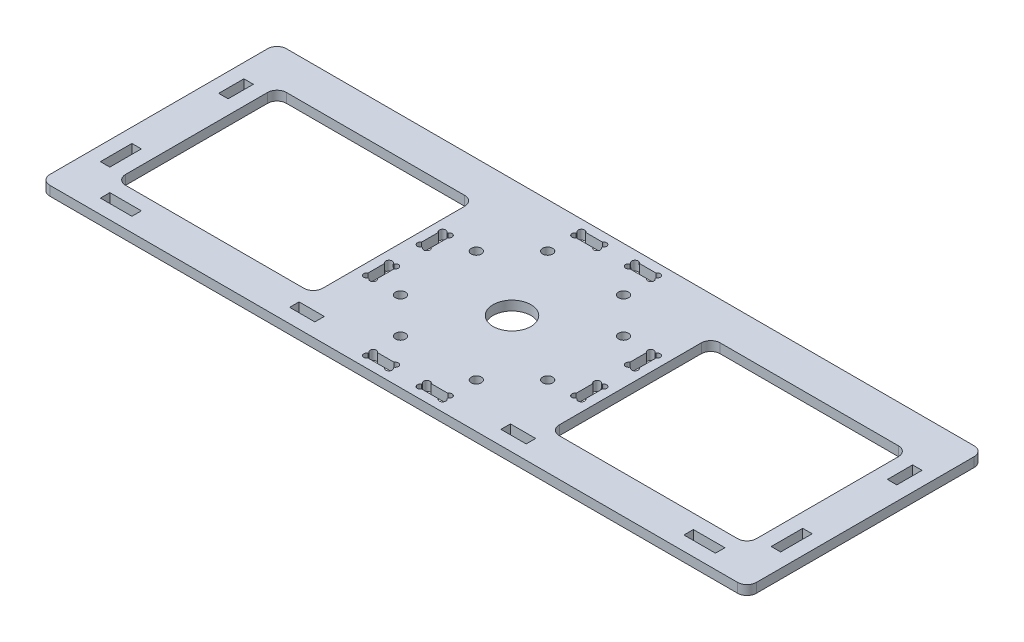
ISO-10303-21;
HEADER;
FILE_DESCRIPTION(('STEP AP214'),'2;1');
FILE_NAME('part.step','',(''),(''),'','','');
FILE_SCHEMA(('AUTOMOTIVE_DESIGN { 1 0 10303 214 1 1 1 1 }'));
ENDSEC;
DATA;
#1=APPLICATION_CONTEXT('core data for automotive mechanical design processes');
#2=APPLICATION_PROTOCOL_DEFINITION('international standard','automotive_design',2000,#1);
#3=PRODUCT_CONTEXT('',#1,'mechanical');
#4=PRODUCT('Part','Part','',(#3));
#5=PRODUCT_RELATED_PRODUCT_CATEGORY('part','',(#4));
#6=PRODUCT_DEFINITION_FORMATION('','',#4);
#7=PRODUCT_DEFINITION_CONTEXT('part definition',#1,'design');
#8=PRODUCT_DEFINITION('design','',#6,#7);
#9=PRODUCT_DEFINITION_SHAPE('','',#8);
#10=(LENGTH_UNIT() NAMED_UNIT(*) SI_UNIT(.MILLI.,.METRE.));
#11=(NAMED_UNIT(*) PLANE_ANGLE_UNIT() SI_UNIT($,.RADIAN.));
#12=(NAMED_UNIT(*) SI_UNIT($,.STERADIAN.) SOLID_ANGLE_UNIT());
#13=UNCERTAINTY_MEASURE_WITH_UNIT(LENGTH_MEASURE(1.E-05),#10,'distance_accuracy_value','');
#14=(GEOMETRIC_REPRESENTATION_CONTEXT(3) GLOBAL_UNCERTAINTY_ASSIGNED_CONTEXT((#13)) GLOBAL_UNIT_ASSIGNED_CONTEXT((#10,
#11,#12)) REPRESENTATION_CONTEXT('',''));
#15=CARTESIAN_POINT('',(0.,0.,0.));
#16=DIRECTION('',(0.,0.,1.));
#17=DIRECTION('',(1.,0.,0.));
#18=AXIS2_PLACEMENT_3D('',#15,#16,#17);
#19=CARTESIAN_POINT('',(0.,0.,0.));
#20=DIRECTION('',(0.,-1.,0.));
#21=DIRECTION('',(0.,0.,-1.));
#22=AXIS2_PLACEMENT_3D('',#19,#20,#21);
#23=PLANE('',#22);
#24=DIRECTION('',(1.,0.,0.));
#25=VECTOR('',#24,1.);
#26=CARTESIAN_POINT('',(0.,0.,-22.4999999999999));
#27=LINE('',#26,#25);
#28=CARTESIAN_POINT('',(104.5,0.,-22.5));
#29=VERTEX_POINT('',#28);
#30=CARTESIAN_POINT('',(107.5,0.,-22.5));
#31=VERTEX_POINT('',#30);
#32=EDGE_CURVE('E981',#29,#31,#27,.T.);
#33=ORIENTED_EDGE('',*,*,#32,.F.);
#34=DIRECTION('',(0.,0.,-1.));
#35=VECTOR('',#34,1.);
#36=CARTESIAN_POINT('',(104.5,0.,0.));
#37=LINE('',#36,#35);
#38=CARTESIAN_POINT('',(104.5,0.,-14.5));
#39=VERTEX_POINT('',#38);
#40=EDGE_CURVE('E975',#39,#29,#37,.T.);
#41=ORIENTED_EDGE('',*,*,#40,.F.);
#42=DIRECTION('',(-1.,0.,0.));
#43=VECTOR('',#42,1.);
#44=CARTESIAN_POINT('',(0.,0.,-14.5));
#45=LINE('',#44,#43);
#46=CARTESIAN_POINT('',(107.5,0.,-14.5));
#47=VERTEX_POINT('',#46);
#48=EDGE_CURVE('E977',#47,#39,#45,.T.);
#49=ORIENTED_EDGE('',*,*,#48,.F.);
#50=DIRECTION('',(0.,0.,1.));
#51=VECTOR('',#50,1.);
#52=CARTESIAN_POINT('',(107.5,0.,0.));
#53=LINE('',#52,#51);
#54=EDGE_CURVE('E979',#31,#47,#53,.T.);
#55=ORIENTED_EDGE('',*,*,#54,.F.);
#56=EDGE_LOOP('',(#33,#41,#49,#55));
#57=FACE_BOUND('',#56,.T.);
#58=DIRECTION('',(0.,0.,-1.));
#59=VECTOR('',#58,1.);
#60=CARTESIAN_POINT('',(-107.5,0.,0.));
#61=LINE('',#60,#59);
#62=CARTESIAN_POINT('',(-107.5,0.,-14.5));
#63=VERTEX_POINT('',#62);
#64=CARTESIAN_POINT('',(-107.5,0.,-22.5));
#65=VERTEX_POINT('',#64);
#66=EDGE_CURVE('E973',#63,#65,#61,.T.);
#67=ORIENTED_EDGE('',*,*,#66,.F.);
#68=DIRECTION('',(-1.,0.,0.));
#69=VECTOR('',#68,1.);
#70=CARTESIAN_POINT('',(0.,0.,-14.5));
#71=LINE('',#70,#69);
#72=CARTESIAN_POINT('',(-104.5,0.,-14.5));
#73=VERTEX_POINT('',#72);
#74=EDGE_CURVE('E967',#73,#63,#71,.T.);
#75=ORIENTED_EDGE('',*,*,#74,.F.);
#76=DIRECTION('',(0.,0.,1.));
#77=VECTOR('',#76,1.);
#78=CARTESIAN_POINT('',(-104.5,0.,0.));
#79=LINE('',#78,#77);
#80=CARTESIAN_POINT('',(-104.5,0.,-22.5));
#81=VERTEX_POINT('',#80);
#82=EDGE_CURVE('E969',#81,#73,#79,.T.);
#83=ORIENTED_EDGE('',*,*,#82,.F.);
#84=DIRECTION('',(1.,0.,0.));
#85=VECTOR('',#84,1.);
#86=CARTESIAN_POINT('',(0.,0.,-22.5));
#87=LINE('',#86,#85);
#88=EDGE_CURVE('E971',#65,#81,#87,.T.);
#89=ORIENTED_EDGE('',*,*,#88,.F.);
#90=EDGE_LOOP('',(#67,#75,#83,#89));
#91=FACE_BOUND('',#90,.T.);
#92=DIRECTION('',(1.,0.,0.));
#93=VECTOR('',#92,1.);
#94=CARTESIAN_POINT('',(0.,0.,30.));
#95=LINE('',#94,#93);
#96=CARTESIAN_POINT('',(87.5,0.,30.));
#97=VERTEX_POINT('',#96);
#98=CARTESIAN_POINT('',(97.5,0.,30.));
#99=VERTEX_POINT('',#98);
#100=EDGE_CURVE('E965',#97,#99,#95,.T.);
#101=ORIENTED_EDGE('',*,*,#100,.F.);
#102=DIRECTION('',(0.,0.,-1.));
#103=VECTOR('',#102,1.);
#104=CARTESIAN_POINT('',(87.5,0.,0.));
#105=LINE('',#104,#103);
#106=CARTESIAN_POINT('',(87.5,0.,33.));
#107=VERTEX_POINT('',#106);
#108=EDGE_CURVE('E958',#107,#97,#105,.T.);
#109=ORIENTED_EDGE('',*,*,#108,.F.);
#110=DIRECTION('',(-1.,0.,0.));
#111=VECTOR('',#110,1.);
#112=CARTESIAN_POINT('',(0.,0.,33.));
#113=LINE('',#112,#111);
#114=CARTESIAN_POINT('',(97.5,0.,33.));
#115=VERTEX_POINT('',#114);
#116=EDGE_CURVE('E960',#115,#107,#113,.T.);
#117=ORIENTED_EDGE('',*,*,#116,.F.);
#118=DIRECTION('',(0.,0.,1.));
#119=VECTOR('',#118,1.);
#120=CARTESIAN_POINT('',(97.5,0.,0.));
#121=LINE('',#120,#119);
#122=EDGE_CURVE('E963',#99,#115,#121,.T.);
#123=ORIENTED_EDGE('',*,*,#122,.F.);
#124=EDGE_LOOP('',(#101,#109,#117,#123));
#125=FACE_BOUND('',#124,.T.);
#126=DIRECTION('',(-1.,0.,0.));
#127=VECTOR('',#126,1.);
#128=CARTESIAN_POINT('',(0.,0.,22.3339856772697));
#129=LINE('',#128,#127);
#130=CARTESIAN_POINT('',(107.5,0.,22.3339856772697));
#131=VERTEX_POINT('',#130);
#132=CARTESIAN_POINT('',(104.5,0.,22.3339856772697));
#133=VERTEX_POINT('',#132);
#134=EDGE_CURVE('E956',#131,#133,#129,.T.);
#135=ORIENTED_EDGE('',*,*,#134,.F.);
#136=DIRECTION('',(0.,0.,1.));
#137=VECTOR('',#136,1.);
#138=CARTESIAN_POINT('',(107.5,0.,-1.49186218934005E-13));
#139=LINE('',#138,#137);
#140=CARTESIAN_POINT('',(107.5,0.,12.3339856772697));
#141=VERTEX_POINT('',#140);
#142=EDGE_CURVE('E951',#141,#131,#139,.T.);
#143=ORIENTED_EDGE('',*,*,#142,.F.);
#144=DIRECTION('',(1.,0.,0.));
#145=VECTOR('',#144,1.);
#146=CARTESIAN_POINT('',(0.,0.,12.3339856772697));
#147=LINE('',#146,#145);
#148=CARTESIAN_POINT('',(104.5,0.,12.3339856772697));
#149=VERTEX_POINT('',#148);
#150=EDGE_CURVE('E781',#149,#141,#147,.T.);
#151=ORIENTED_EDGE('',*,*,#150,.F.);
#152=DIRECTION('',(0.,0.,-1.));
#153=VECTOR('',#152,1.);
#154=CARTESIAN_POINT('',(104.5,0.,0.));
#155=LINE('',#154,#153);
#156=EDGE_CURVE('E954',#133,#149,#155,.T.);
#157=ORIENTED_EDGE('',*,*,#156,.F.);
#158=EDGE_LOOP('',(#135,#143,#151,#157));
#159=FACE_BOUND('',#158,.T.);
#160=DIRECTION('',(1.,0.,0.));
#161=VECTOR('',#160,1.);
#162=CARTESIAN_POINT('',(0.,0.,29.9999999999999));
#163=LINE('',#162,#161);
#164=CARTESIAN_POINT('',(29.5,0.,30.));
#165=VERTEX_POINT('',#164);
#166=CARTESIAN_POINT('',(37.4999999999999,0.,30.));
#167=VERTEX_POINT('',#166);
#168=EDGE_CURVE('E949',#165,#167,#163,.T.);
#169=ORIENTED_EDGE('',*,*,#168,.F.);
#170=DIRECTION('',(0.,0.,-1.));
#171=VECTOR('',#170,1.);
#172=CARTESIAN_POINT('',(29.5,0.,0.));
#173=LINE('',#172,#171);
#174=CARTESIAN_POINT('',(29.5,0.,33.));
#175=VERTEX_POINT('',#174);
#176=EDGE_CURVE('E942',#175,#165,#173,.T.);
#177=ORIENTED_EDGE('',*,*,#176,.F.);
#178=DIRECTION('',(-1.,0.,0.));
#179=VECTOR('',#178,1.);
#180=CARTESIAN_POINT('',(-1.43114686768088E-13,0.,32.9999999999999));
#181=LINE('',#180,#179);
#182=CARTESIAN_POINT('',(37.4999999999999,0.,33.));
#183=VERTEX_POINT('',#182);
#184=EDGE_CURVE('E944',#183,#175,#181,.T.);
#185=ORIENTED_EDGE('',*,*,#184,.F.);
#186=DIRECTION('',(0.,0.,1.));
#187=VECTOR('',#186,1.);
#188=CARTESIAN_POINT('',(37.4999999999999,0.,0.));
#189=LINE('',#188,#187);
#190=EDGE_CURVE('E947',#167,#183,#189,.T.);
#191=ORIENTED_EDGE('',*,*,#190,.F.);
#192=EDGE_LOOP('',(#169,#177,#185,#191));
#193=FACE_BOUND('',#192,.T.);
#194=DIRECTION('',(0.,0.,-1.));
#195=VECTOR('',#194,1.);
#196=CARTESIAN_POINT('',(-37.5,0.,0.));
#197=LINE('',#196,#195);
#198=CARTESIAN_POINT('',(-37.5,0.,33.));
#199=VERTEX_POINT('',#198);
#200=CARTESIAN_POINT('',(-37.5,0.,30.));
#201=VERTEX_POINT('',#200);
#202=EDGE_CURVE('E940',#199,#201,#197,.T.);
#203=ORIENTED_EDGE('',*,*,#202,.F.);
#204=DIRECTION('',(-1.,0.,0.));
#205=VECTOR('',#204,1.);
#206=CARTESIAN_POINT('',(0.,0.,33.));
#207=LINE('',#206,#205);
#208=CARTESIAN_POINT('',(-29.5,0.,33.));
#209=VERTEX_POINT('',#208);
#210=EDGE_CURVE('E933',#209,#199,#207,.T.);
#211=ORIENTED_EDGE('',*,*,#210,.F.);
#212=DIRECTION('',(0.,0.,1.));
#213=VECTOR('',#212,1.);
#214=CARTESIAN_POINT('',(-29.5,0.,0.));
#215=LINE('',#214,#213);
#216=CARTESIAN_POINT('',(-29.5,0.,30.));
#217=VERTEX_POINT('',#216);
#218=EDGE_CURVE('E935',#217,#209,#215,.T.);
#219=ORIENTED_EDGE('',*,*,#218,.F.);
#220=DIRECTION('',(1.,0.,0.));
#221=VECTOR('',#220,1.);
#222=CARTESIAN_POINT('',(0.,0.,30.));
#223=LINE('',#222,#221);
#224=EDGE_CURVE('E938',#201,#217,#223,.T.);
#225=ORIENTED_EDGE('',*,*,#224,.F.);
#226=EDGE_LOOP('',(#203,#211,#219,#225));
#227=FACE_BOUND('',#226,.T.);
#228=DIRECTION('',(0.,0.,1.));
#229=VECTOR('',#228,1.);
#230=CARTESIAN_POINT('',(-104.5,0.,4.35068647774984E-13));
#231=LINE('',#230,#229);
#232=CARTESIAN_POINT('',(-104.5,0.,13.));
#233=VERTEX_POINT('',#232);
#234=CARTESIAN_POINT('',(-104.5,0.,23.));
#235=VERTEX_POINT('',#234);
#236=EDGE_CURVE('E931',#233,#235,#231,.T.);
#237=ORIENTED_EDGE('',*,*,#236,.F.);
#238=DIRECTION('',(1.,0.,0.));
#239=VECTOR('',#238,1.);
#240=CARTESIAN_POINT('',(0.,0.,12.9999999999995));
#241=LINE('',#240,#239);
#242=CARTESIAN_POINT('',(-107.5,0.,13.));
#243=VERTEX_POINT('',#242);
#244=EDGE_CURVE('E880',#243,#233,#241,.T.);
#245=ORIENTED_EDGE('',*,*,#244,.F.);
#246=DIRECTION('',(0.,0.,-1.));
#247=VECTOR('',#246,1.);
#248=CARTESIAN_POINT('',(-107.5,0.,4.47558656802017E-13));
#249=LINE('',#248,#247);
#250=CARTESIAN_POINT('',(-107.5,0.,23.));
#251=VERTEX_POINT('',#250);
#252=EDGE_CURVE('E926',#251,#243,#249,.T.);
#253=ORIENTED_EDGE('',*,*,#252,.F.);
#254=DIRECTION('',(-1.,0.,0.));
#255=VECTOR('',#254,1.);
#256=CARTESIAN_POINT('',(0.,0.,22.9999999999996));
#257=LINE('',#256,#255);
#258=EDGE_CURVE('E929',#235,#251,#257,.T.);
#259=ORIENTED_EDGE('',*,*,#258,.F.);
#260=EDGE_LOOP('',(#237,#245,#253,#259));
#261=FACE_BOUND('',#260,.T.);
#262=DIRECTION('',(0.,0.,-1.));
#263=VECTOR('',#262,1.);
#264=CARTESIAN_POINT('',(-97.5,0.,0.));
#265=LINE('',#264,#263);
#266=CARTESIAN_POINT('',(-97.5,0.,33.));
#267=VERTEX_POINT('',#266);
#268=CARTESIAN_POINT('',(-97.5,0.,30.));
#269=VERTEX_POINT('',#268);
#270=EDGE_CURVE('E1010',#267,#269,#265,.T.);
#271=ORIENTED_EDGE('',*,*,#270,.F.);
#272=DIRECTION('',(-1.,0.,0.));
#273=VECTOR('',#272,1.);
#274=CARTESIAN_POINT('',(0.,0.,33.));
#275=LINE('',#274,#273);
#276=CARTESIAN_POINT('',(-87.5,0.,33.));
#277=VERTEX_POINT('',#276);
#278=EDGE_CURVE('E997',#277,#267,#275,.T.);
#279=ORIENTED_EDGE('',*,*,#278,.F.);
#280=DIRECTION('',(0.,0.,1.));
#281=VECTOR('',#280,1.);
#282=CARTESIAN_POINT('',(-87.5,0.,0.));
#283=LINE('',#282,#281);
#284=CARTESIAN_POINT('',(-87.5,0.,30.));
#285=VERTEX_POINT('',#284);
#286=EDGE_CURVE('E1005',#285,#277,#283,.T.);
#287=ORIENTED_EDGE('',*,*,#286,.F.);
#288=DIRECTION('',(1.,0.,0.));
#289=VECTOR('',#288,1.);
#290=CARTESIAN_POINT('',(0.,0.,30.));
#291=LINE('',#290,#289);
#292=EDGE_CURVE('E1008',#269,#285,#291,.T.);
#293=ORIENTED_EDGE('',*,*,#292,.F.);
#294=EDGE_LOOP('',(#271,#279,#287,#293));
#295=FACE_BOUND('',#294,.T.);
#296=CARTESIAN_POINT('',(-34.,0.,-12.0000000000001));
#297=DIRECTION('',(0.,1.,0.));
#298=DIRECTION('',(0.,0.,1.));
#299=AXIS2_PLACEMENT_3D('',#296,#297,#298);
#300=CIRCLE('',#299,0.999999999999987);
#301=CARTESIAN_POINT('',(-33.1339745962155,0.,-12.5000000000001));
#302=VERTEX_POINT('',#301);
#303=CARTESIAN_POINT('',(-34.5,0.,-11.1339745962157));
#304=VERTEX_POINT('',#303);
#305=EDGE_CURVE('E1014',#302,#304,#300,.T.);
#306=ORIENTED_EDGE('',*,*,#305,.T.);
#307=DIRECTION('',(0.,0.,1.));
#308=VECTOR('',#307,1.);
#309=CARTESIAN_POINT('',(-34.5,0.,-12.5000000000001));
#310=LINE('',#309,#308);
#311=CARTESIAN_POINT('',(-34.5,0.,-5.86602540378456));
#312=VERTEX_POINT('',#311);
#313=EDGE_CURVE('E1391',#304,#312,#310,.T.);
#314=ORIENTED_EDGE('',*,*,#313,.T.);
#315=CARTESIAN_POINT('',(-34.,0.,-5.00000000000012));
#316=DIRECTION('',(0.,1.,0.));
#317=DIRECTION('',(0.,0.,1.));
#318=AXIS2_PLACEMENT_3D('',#315,#316,#317);
#319=CIRCLE('',#318,0.999999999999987);
#320=CARTESIAN_POINT('',(-33.1339745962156,0.,-4.50000000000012));
#321=VERTEX_POINT('',#320);
#322=EDGE_CURVE('E1043',#312,#321,#319,.T.);
#323=ORIENTED_EDGE('',*,*,#322,.T.);
#324=DIRECTION('',(1.,0.,0.));
#325=VECTOR('',#324,1.);
#326=CARTESIAN_POINT('',(-34.5,0.,-4.50000000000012));
#327=LINE('',#326,#325);
#328=CARTESIAN_POINT('',(-32.8660254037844,0.,-4.50000000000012));
#329=VERTEX_POINT('',#328);
#330=EDGE_CURVE('E1393',#321,#329,#327,.T.);
#331=ORIENTED_EDGE('',*,*,#330,.T.);
#332=CARTESIAN_POINT('',(-32.,0.,-5.00000000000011));
#333=DIRECTION('',(0.,1.,0.));
#334=DIRECTION('',(0.,0.,1.));
#335=AXIS2_PLACEMENT_3D('',#332,#333,#334);
#336=CIRCLE('',#335,0.999999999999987);
#337=CARTESIAN_POINT('',(-31.5,0.,-5.86602540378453));
#338=VERTEX_POINT('',#337);
#339=EDGE_CURVE('E11',#329,#338,#336,.T.);
#340=ORIENTED_EDGE('',*,*,#339,.T.);
#341=DIRECTION('',(0.,0.,-1.));
#342=VECTOR('',#341,1.);
#343=CARTESIAN_POINT('',(-31.5,0.,-12.5000000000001));
#344=LINE('',#343,#342);
#345=CARTESIAN_POINT('',(-31.5,0.,-11.1339745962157));
#346=VERTEX_POINT('',#345);
#347=EDGE_CURVE('E1397',#338,#346,#344,.T.);
#348=ORIENTED_EDGE('',*,*,#347,.T.);
#349=CARTESIAN_POINT('',(-31.9999999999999,0.,-12.0000000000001));
#350=DIRECTION('',(0.,1.,0.));
#351=DIRECTION('',(0.,0.,1.));
#352=AXIS2_PLACEMENT_3D('',#349,#350,#351);
#353=CIRCLE('',#352,0.999999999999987);
#354=CARTESIAN_POINT('',(-32.8660254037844,0.,-12.5000000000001));
#355=VERTEX_POINT('',#354);
#356=EDGE_CURVE('E1026',#346,#355,#353,.T.);
#357=ORIENTED_EDGE('',*,*,#356,.T.);
#358=DIRECTION('',(-1.,0.,0.));
#359=VECTOR('',#358,1.);
#360=CARTESIAN_POINT('',(-34.5,0.,-12.5000000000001));
#361=LINE('',#360,#359);
#362=EDGE_CURVE('E1384',#355,#302,#361,.T.);
#363=ORIENTED_EDGE('',*,*,#362,.T.);
#364=EDGE_LOOP('',(#306,#314,#323,#331,#340,#348,#357,#363));
#365=FACE_BOUND('',#364,.T.);
#366=CARTESIAN_POINT('',(12.0000000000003,0.,-33.9999999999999));
#367=DIRECTION('',(0.,1.,0.));
#368=DIRECTION('',(0.,0.,1.));
#369=AXIS2_PLACEMENT_3D('',#366,#367,#368);
#370=CIRCLE('',#369,0.999999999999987);
#371=CARTESIAN_POINT('',(12.5,0.,-33.1339745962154));
#372=VERTEX_POINT('',#371);
#373=CARTESIAN_POINT('',(11.1339745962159,0.,-34.5));
#374=VERTEX_POINT('',#373);
#375=EDGE_CURVE('E1099',#372,#374,#370,.T.);
#376=ORIENTED_EDGE('',*,*,#375,.T.);
#377=DIRECTION('',(-1.,0.,0.));
#378=VECTOR('',#377,1.);
#379=CARTESIAN_POINT('',(12.5,0.,-34.5));
#380=LINE('',#379,#378);
#381=CARTESIAN_POINT('',(5.86602540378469,0.,-34.5));
#382=VERTEX_POINT('',#381);
#383=EDGE_CURVE('E1410',#374,#382,#380,.T.);
#384=ORIENTED_EDGE('',*,*,#383,.T.);
#385=CARTESIAN_POINT('',(5.00000000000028,0.,-34.));
#386=DIRECTION('',(0.,1.,0.));
#387=DIRECTION('',(0.,0.,1.));
#388=AXIS2_PLACEMENT_3D('',#385,#386,#387);
#389=CIRCLE('',#388,0.999999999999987);
#390=CARTESIAN_POINT('',(4.5,0.,-33.1339745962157));
#391=VERTEX_POINT('',#390);
#392=EDGE_CURVE('E1122',#382,#391,#389,.T.);
#393=ORIENTED_EDGE('',*,*,#392,.T.);
#394=DIRECTION('',(0.,0.,1.));
#395=VECTOR('',#394,1.);
#396=CARTESIAN_POINT('',(4.5,0.,-34.5));
#397=LINE('',#396,#395);
#398=CARTESIAN_POINT('',(4.5,0.,-32.8660254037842));
#399=VERTEX_POINT('',#398);
#400=EDGE_CURVE('E1412',#391,#399,#397,.T.);
#401=ORIENTED_EDGE('',*,*,#400,.T.);
#402=CARTESIAN_POINT('',(5.00000000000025,0.,-32.));
#403=DIRECTION('',(0.,1.,0.));
#404=DIRECTION('',(0.,0.,1.));
#405=AXIS2_PLACEMENT_3D('',#402,#403,#404);
#406=CIRCLE('',#405,0.999999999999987);
#407=CARTESIAN_POINT('',(5.8660254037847,0.,-31.5));
#408=VERTEX_POINT('',#407);
#409=EDGE_CURVE('E1111',#399,#408,#406,.T.);
#410=ORIENTED_EDGE('',*,*,#409,.T.);
#411=DIRECTION('',(1.,0.,0.));
#412=VECTOR('',#411,1.);
#413=CARTESIAN_POINT('',(12.5,0.,-31.5));
#414=LINE('',#413,#412);
#415=CARTESIAN_POINT('',(11.1339745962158,0.,-31.5));
#416=VERTEX_POINT('',#415);
#417=EDGE_CURVE('E1415',#408,#416,#414,.T.);
#418=ORIENTED_EDGE('',*,*,#417,.T.);
#419=CARTESIAN_POINT('',(12.0000000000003,0.,-31.9999999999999));
#420=DIRECTION('',(0.,1.,0.));
#421=DIRECTION('',(0.,0.,1.));
#422=AXIS2_PLACEMENT_3D('',#419,#420,#421);
#423=CIRCLE('',#422,0.999999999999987);
#424=CARTESIAN_POINT('',(12.5,0.,-32.8660254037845));
#425=VERTEX_POINT('',#424);
#426=EDGE_CURVE('E1108',#416,#425,#423,.T.);
#427=ORIENTED_EDGE('',*,*,#426,.T.);
#428=DIRECTION('',(0.,0.,-1.));
#429=VECTOR('',#428,1.);
#430=CARTESIAN_POINT('',(12.5,0.,-34.5));
#431=LINE('',#430,#429);
#432=EDGE_CURVE('E1418',#425,#372,#431,.T.);
#433=ORIENTED_EDGE('',*,*,#432,.T.);
#434=EDGE_LOOP('',(#376,#384,#393,#401,#410,#418,#427,#433));
#435=FACE_BOUND('',#434,.T.);
#436=CARTESIAN_POINT('',(-12.,0.,34.));
#437=DIRECTION('',(0.,1.,0.));
#438=DIRECTION('',(0.,0.,1.));
#439=AXIS2_PLACEMENT_3D('',#436,#437,#438);
#440=CIRCLE('',#439,0.999999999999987);
#441=CARTESIAN_POINT('',(-12.5,0.,33.1339745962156));
#442=VERTEX_POINT('',#441);
#443=CARTESIAN_POINT('',(-11.1339745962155,0.,34.5));
#444=VERTEX_POINT('',#443);
#445=EDGE_CURVE('E1188',#442,#444,#440,.T.);
#446=ORIENTED_EDGE('',*,*,#445,.T.);
#447=DIRECTION('',(1.,0.,0.));
#448=VECTOR('',#447,1.);
#449=CARTESIAN_POINT('',(-12.5,0.,34.5));
#450=LINE('',#449,#448);
#451=CARTESIAN_POINT('',(-5.86602540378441,0.,34.5));
#452=VERTEX_POINT('',#451);
#453=EDGE_CURVE('E1380',#444,#452,#450,.T.);
#454=ORIENTED_EDGE('',*,*,#453,.T.);
#455=CARTESIAN_POINT('',(-4.99999999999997,0.,34.));
#456=DIRECTION('',(0.,1.,0.));
#457=DIRECTION('',(0.,0.,1.));
#458=AXIS2_PLACEMENT_3D('',#455,#456,#457);
#459=CIRCLE('',#458,0.999999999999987);
#460=CARTESIAN_POINT('',(-4.49999999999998,0.,33.1339745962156));
#461=VERTEX_POINT('',#460);
#462=EDGE_CURVE('E1225',#452,#461,#459,.T.);
#463=ORIENTED_EDGE('',*,*,#462,.T.);
#464=DIRECTION('',(0.,0.,-1.));
#465=VECTOR('',#464,1.);
#466=CARTESIAN_POINT('',(-4.49999999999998,0.,34.5));
#467=LINE('',#466,#465);
#468=CARTESIAN_POINT('',(-4.49999999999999,0.,32.8660254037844));
#469=VERTEX_POINT('',#468);
#470=EDGE_CURVE('E1433',#461,#469,#467,.T.);
#471=ORIENTED_EDGE('',*,*,#470,.T.);
#472=CARTESIAN_POINT('',(-4.99999999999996,0.,32.));
#473=DIRECTION('',(0.,1.,0.));
#474=DIRECTION('',(0.,0.,1.));
#475=AXIS2_PLACEMENT_3D('',#472,#473,#474);
#476=CIRCLE('',#475,0.999999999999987);
#477=CARTESIAN_POINT('',(-5.86602540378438,0.,31.5));
#478=VERTEX_POINT('',#477);
#479=EDGE_CURVE('E1212',#469,#478,#476,.T.);
#480=ORIENTED_EDGE('',*,*,#479,.T.);
#481=DIRECTION('',(-1.,0.,0.));
#482=VECTOR('',#481,1.);
#483=CARTESIAN_POINT('',(-12.5,0.,31.5));
#484=LINE('',#483,#482);
#485=CARTESIAN_POINT('',(-11.1339745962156,0.,31.5));
#486=VERTEX_POINT('',#485);
#487=EDGE_CURVE('E1436',#478,#486,#484,.T.);
#488=ORIENTED_EDGE('',*,*,#487,.T.);
#489=CARTESIAN_POINT('',(-12.,0.,32.));
#490=DIRECTION('',(0.,1.,0.));
#491=DIRECTION('',(0.,0.,1.));
#492=AXIS2_PLACEMENT_3D('',#489,#490,#491);
#493=CIRCLE('',#492,0.999999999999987);
#494=CARTESIAN_POINT('',(-12.5,0.,32.8660254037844));
#495=VERTEX_POINT('',#494);
#496=EDGE_CURVE('E1200',#486,#495,#493,.T.);
#497=ORIENTED_EDGE('',*,*,#496,.T.);
#498=DIRECTION('',(0.,0.,1.));
#499=VECTOR('',#498,1.);
#500=CARTESIAN_POINT('',(-12.5,0.,34.5));
#501=LINE('',#500,#499);
#502=EDGE_CURVE('E1426',#495,#442,#501,.T.);
#503=ORIENTED_EDGE('',*,*,#502,.T.);
#504=EDGE_LOOP('',(#446,#454,#463,#471,#480,#488,#497,#503));
#505=FACE_BOUND('',#504,.T.);
#506=CARTESIAN_POINT('',(0.,0.,0.));
#507=DIRECTION('',(0.,-1.,0.));
#508=DIRECTION('',(0.,0.,-1.));
#509=AXIS2_PLACEMENT_3D('',#506,#507,#508);
#510=CIRCLE('',#509,6.);
#511=CARTESIAN_POINT('',(0.,0.,-6.));
#512=VERTEX_POINT('',#511);
#513=EDGE_CURVE('E1530',#512,#512,#510,.T.);
#514=ORIENTED_EDGE('',*,*,#513,.F.);
#515=EDGE_LOOP('',(#514));
#516=FACE_BOUND('',#515,.T.);
#517=CARTESIAN_POINT('',(12.0208152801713,0.,23.3345237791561));
#518=DIRECTION('',(0.,1.,0.));
#519=DIRECTION('',(0.,0.,1.));
#520=AXIS2_PLACEMENT_3D('',#517,#518,#519);
#521=CIRCLE('',#520,1.6);
#522=CARTESIAN_POINT('',(12.0208152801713,0.,24.9345237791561));
#523=VERTEX_POINT('',#522);
#524=EDGE_CURVE('E1534',#523,#523,#521,.T.);
#525=ORIENTED_EDGE('',*,*,#524,.T.);
#526=EDGE_LOOP('',(#525));
#527=FACE_BOUND('',#526,.T.);
#528=CARTESIAN_POINT('',(23.3345237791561,0.,12.0208152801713));
#529=DIRECTION('',(0.,1.,0.));
#530=DIRECTION('',(0.,0.,1.));
#531=AXIS2_PLACEMENT_3D('',#528,#529,#530);
#532=CIRCLE('',#531,1.6);
#533=CARTESIAN_POINT('',(23.3345237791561,0.,13.6208152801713));
#534=VERTEX_POINT('',#533);
#535=EDGE_CURVE('E1540',#534,#534,#532,.T.);
#536=ORIENTED_EDGE('',*,*,#535,.T.);
#537=EDGE_LOOP('',(#536));
#538=FACE_BOUND('',#537,.T.);
#539=CARTESIAN_POINT('',(-12.0208152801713,0.,-23.3345237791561));
#540=DIRECTION('',(0.,1.,0.));
#541=DIRECTION('',(0.,0.,1.));
#542=AXIS2_PLACEMENT_3D('',#539,#540,#541);
#543=CIRCLE('',#542,1.6);
#544=CARTESIAN_POINT('',(-12.0208152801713,0.,-21.7345237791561));
#545=VERTEX_POINT('',#544);
#546=EDGE_CURVE('E1546',#545,#545,#543,.T.);
#547=ORIENTED_EDGE('',*,*,#546,.T.);
#548=EDGE_LOOP('',(#547));
#549=FACE_BOUND('',#548,.T.);
#550=CARTESIAN_POINT('',(-23.3345237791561,0.,-12.0208152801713));
#551=DIRECTION('',(0.,1.,0.));
#552=DIRECTION('',(0.,0.,1.));
#553=AXIS2_PLACEMENT_3D('',#550,#551,#552);
#554=CIRCLE('',#553,1.6);
#555=CARTESIAN_POINT('',(-23.3345237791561,0.,-10.4208152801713));
#556=VERTEX_POINT('',#555);
#557=EDGE_CURVE('E1552',#556,#556,#554,.T.);
#558=ORIENTED_EDGE('',*,*,#557,.T.);
#559=EDGE_LOOP('',(#558));
#560=FACE_BOUND('',#559,.T.);
#561=CARTESIAN_POINT('',(23.3345237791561,0.,-12.0208152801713));
#562=DIRECTION('',(0.,1.,0.));
#563=DIRECTION('',(0.,0.,1.));
#564=AXIS2_PLACEMENT_3D('',#561,#562,#563);
#565=CIRCLE('',#564,1.6);
#566=CARTESIAN_POINT('',(23.3345237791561,0.,-10.4208152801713));
#567=VERTEX_POINT('',#566);
#568=EDGE_CURVE('E1558',#567,#567,#565,.T.);
#569=ORIENTED_EDGE('',*,*,#568,.T.);
#570=EDGE_LOOP('',(#569));
#571=FACE_BOUND('',#570,.T.);
#572=CARTESIAN_POINT('',(12.0208152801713,0.,-23.3345237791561));
#573=DIRECTION('',(0.,1.,0.));
#574=DIRECTION('',(0.,0.,1.));
#575=AXIS2_PLACEMENT_3D('',#572,#573,#574);
#576=CIRCLE('',#575,1.6);
#577=CARTESIAN_POINT('',(12.0208152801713,0.,-21.7345237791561));
#578=VERTEX_POINT('',#577);
#579=EDGE_CURVE('E1564',#578,#578,#576,.T.);
#580=ORIENTED_EDGE('',*,*,#579,.T.);
#581=EDGE_LOOP('',(#580));
#582=FACE_BOUND('',#581,.T.);
#583=CARTESIAN_POINT('',(-23.3345237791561,0.,12.0208152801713));
#584=DIRECTION('',(0.,1.,0.));
#585=DIRECTION('',(0.,0.,1.));
#586=AXIS2_PLACEMENT_3D('',#583,#584,#585);
#587=CIRCLE('',#586,1.6);
#588=CARTESIAN_POINT('',(-23.3345237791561,0.,13.6208152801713));
#589=VERTEX_POINT('',#588);
#590=EDGE_CURVE('E1570',#589,#589,#587,.T.);
#591=ORIENTED_EDGE('',*,*,#590,.T.);
#592=EDGE_LOOP('',(#591));
#593=FACE_BOUND('',#592,.T.);
#594=CARTESIAN_POINT('',(-12.0208152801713,0.,23.3345237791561));
#595=DIRECTION('',(0.,1.,0.));
#596=DIRECTION('',(0.,0.,1.));
#597=AXIS2_PLACEMENT_3D('',#594,#595,#596);
#598=CIRCLE('',#597,1.6);
#599=CARTESIAN_POINT('',(-12.0208152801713,0.,24.9345237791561));
#600=VERTEX_POINT('',#599);
#601=EDGE_CURVE('E1576',#600,#600,#598,.T.);
#602=ORIENTED_EDGE('',*,*,#601,.T.);
#603=EDGE_LOOP('',(#602));
#604=FACE_BOUND('',#603,.T.);
#605=DIRECTION('',(-1.,0.,0.));
#606=VECTOR('',#605,1.);
#607=CARTESIAN_POINT('',(-112.,0.,-37.5));
#608=LINE('',#607,#606);
#609=CARTESIAN_POINT('',(109.,0.,-37.5));
#610=VERTEX_POINT('',#609);
#611=CARTESIAN_POINT('',(-109.,0.,-37.5));
#612=VERTEX_POINT('',#611);
#613=EDGE_CURVE('E1644',#610,#612,#608,.T.);
#614=ORIENTED_EDGE('',*,*,#613,.F.);
#615=CARTESIAN_POINT('',(109.,0.,-34.5));
#616=DIRECTION('',(0.,-1.,0.));
#617=DIRECTION('',(0.,0.,-1.));
#618=AXIS2_PLACEMENT_3D('',#615,#616,#617);
#619=CIRCLE('',#618,3.);
#620=CARTESIAN_POINT('',(112.,0.,-34.5));
#621=VERTEX_POINT('',#620);
#622=EDGE_CURVE('E1702',#610,#621,#619,.T.);
#623=ORIENTED_EDGE('',*,*,#622,.T.);
#624=DIRECTION('',(0.,0.,-1.));
#625=VECTOR('',#624,1.);
#626=CARTESIAN_POINT('',(112.,0.,37.5));
#627=LINE('',#626,#625);
#628=CARTESIAN_POINT('',(112.,0.,34.5));
#629=VERTEX_POINT('',#628);
#630=EDGE_CURVE('E1617',#629,#621,#627,.T.);
#631=ORIENTED_EDGE('',*,*,#630,.F.);
#632=CARTESIAN_POINT('',(109.,0.,34.5));
#633=DIRECTION('',(0.,-1.,0.));
#634=DIRECTION('',(0.,0.,-1.));
#635=AXIS2_PLACEMENT_3D('',#632,#633,#634);
#636=CIRCLE('',#635,3.);
#637=CARTESIAN_POINT('',(109.,0.,37.5));
#638=VERTEX_POINT('',#637);
#639=EDGE_CURVE('E1700',#629,#638,#636,.T.);
#640=ORIENTED_EDGE('',*,*,#639,.T.);
#641=DIRECTION('',(1.,0.,0.));
#642=VECTOR('',#641,1.);
#643=CARTESIAN_POINT('',(-112.,0.,37.5));
#644=LINE('',#643,#642);
#645=CARTESIAN_POINT('',(-109.,0.,37.5));
#646=VERTEX_POINT('',#645);
#647=EDGE_CURVE('E1632',#646,#638,#644,.T.);
#648=ORIENTED_EDGE('',*,*,#647,.F.);
#649=CARTESIAN_POINT('',(-109.,0.,34.5));
#650=DIRECTION('',(0.,-1.,0.));
#651=DIRECTION('',(0.,0.,-1.));
#652=AXIS2_PLACEMENT_3D('',#649,#650,#651);
#653=CIRCLE('',#652,3.);
#654=CARTESIAN_POINT('',(-112.,0.,34.5));
#655=VERTEX_POINT('',#654);
#656=EDGE_CURVE('E1698',#646,#655,#653,.T.);
#657=ORIENTED_EDGE('',*,*,#656,.T.);
#658=DIRECTION('',(0.,0.,1.));
#659=VECTOR('',#658,1.);
#660=CARTESIAN_POINT('',(-112.,0.,37.5));
#661=LINE('',#660,#659);
#662=CARTESIAN_POINT('',(-112.,0.,-34.5));
#663=VERTEX_POINT('',#662);
#664=EDGE_CURVE('E1647',#663,#655,#661,.T.);
#665=ORIENTED_EDGE('',*,*,#664,.F.);
#666=CARTESIAN_POINT('',(-109.,0.,-34.5));
#667=DIRECTION('',(0.,-1.,0.));
#668=DIRECTION('',(0.,0.,-1.));
#669=AXIS2_PLACEMENT_3D('',#666,#667,#668);
#670=CIRCLE('',#669,3.);
#671=EDGE_CURVE('E1696',#663,#612,#670,.T.);
#672=ORIENTED_EDGE('',*,*,#671,.T.);
#673=EDGE_LOOP('',(#614,#623,#631,#640,#648,#657,#665,#672));
#674=FACE_BOUND('',#673,.T.);
#675=DIRECTION('',(0.,0.,-1.));
#676=VECTOR('',#675,1.);
#677=CARTESIAN_POINT('',(100.,0.,-25.5));
#678=LINE('',#677,#676);
#679=CARTESIAN_POINT('',(100.,0.,22.5));
#680=VERTEX_POINT('',#679);
#681=CARTESIAN_POINT('',(100.,0.,-22.5));
#682=VERTEX_POINT('',#681);
#683=EDGE_CURVE('E1623',#680,#682,#678,.T.);
#684=ORIENTED_EDGE('',*,*,#683,.T.);
#685=CARTESIAN_POINT('',(97.,0.,-22.5));
#686=DIRECTION('',(0.,-1.,0.));
#687=DIRECTION('',(0.,0.,-1.));
#688=AXIS2_PLACEMENT_3D('',#685,#686,#687);
#689=CIRCLE('',#688,3.);
#690=CARTESIAN_POINT('',(97.,0.,-25.5));
#691=VERTEX_POINT('',#690);
#692=EDGE_CURVE('E1727',#682,#691,#689,.F.);
#693=ORIENTED_EDGE('',*,*,#692,.T.);
#694=DIRECTION('',(-1.,0.,0.));
#695=VECTOR('',#694,1.);
#696=CARTESIAN_POINT('',(37.5,0.,-25.5));
#697=LINE('',#696,#695);
#698=CARTESIAN_POINT('',(40.5,0.,-25.5));
#699=VERTEX_POINT('',#698);
#700=EDGE_CURVE('E1608',#691,#699,#697,.T.);
#701=ORIENTED_EDGE('',*,*,#700,.T.);
#702=CARTESIAN_POINT('',(40.5,0.,-22.5));
#703=DIRECTION('',(0.,-1.,0.));
#704=DIRECTION('',(0.,0.,-1.));
#705=AXIS2_PLACEMENT_3D('',#702,#703,#704);
#706=CIRCLE('',#705,3.);
#707=CARTESIAN_POINT('',(37.5,0.,-22.5));
#708=VERTEX_POINT('',#707);
#709=EDGE_CURVE('E1739',#699,#708,#706,.F.);
#710=ORIENTED_EDGE('',*,*,#709,.T.);
#711=DIRECTION('',(0.,0.,1.));
#712=VECTOR('',#711,1.);
#713=CARTESIAN_POINT('',(37.5,0.,-25.5));
#714=LINE('',#713,#712);
#715=CARTESIAN_POINT('',(37.5,0.,22.5));
#716=VERTEX_POINT('',#715);
#717=EDGE_CURVE('E1593',#708,#716,#714,.T.);
#718=ORIENTED_EDGE('',*,*,#717,.T.);
#719=CARTESIAN_POINT('',(40.5,0.,22.5));
#720=DIRECTION('',(0.,-1.,0.));
#721=DIRECTION('',(0.,0.,-1.));
#722=AXIS2_PLACEMENT_3D('',#719,#720,#721);
#723=CIRCLE('',#722,3.);
#724=CARTESIAN_POINT('',(40.5,0.,25.5));
#725=VERTEX_POINT('',#724);
#726=EDGE_CURVE('E1735',#716,#725,#723,.F.);
#727=ORIENTED_EDGE('',*,*,#726,.T.);
#728=DIRECTION('',(1.,0.,0.));
#729=VECTOR('',#728,1.);
#730=CARTESIAN_POINT('',(37.5,0.,25.5));
#731=LINE('',#730,#729);
#732=CARTESIAN_POINT('',(97.,0.,25.5));
#733=VERTEX_POINT('',#732);
#734=EDGE_CURVE('E1620',#725,#733,#731,.T.);
#735=ORIENTED_EDGE('',*,*,#734,.T.);
#736=CARTESIAN_POINT('',(97.,0.,22.5));
#737=DIRECTION('',(0.,-1.,0.));
#738=DIRECTION('',(0.,0.,-1.));
#739=AXIS2_PLACEMENT_3D('',#736,#737,#738);
#740=CIRCLE('',#739,3.);
#741=EDGE_CURVE('E1731',#733,#680,#740,.F.);
#742=ORIENTED_EDGE('',*,*,#741,.T.);
#743=EDGE_LOOP('',(#684,#693,#701,#710,#718,#727,#735,#742));
#744=FACE_BOUND('',#743,.T.);
#745=DIRECTION('',(1.,0.,0.));
#746=VECTOR('',#745,1.);
#747=CARTESIAN_POINT('',(-37.5,0.,25.5));
#748=LINE('',#747,#746);
#749=CARTESIAN_POINT('',(-97.,0.,25.5));
#750=VERTEX_POINT('',#749);
#751=CARTESIAN_POINT('',(-40.5,0.,25.5));
#752=VERTEX_POINT('',#751);
#753=EDGE_CURVE('E1599',#750,#752,#748,.T.);
#754=ORIENTED_EDGE('',*,*,#753,.T.);
#755=CARTESIAN_POINT('',(-40.5,0.,22.5));
#756=DIRECTION('',(0.,-1.,0.));
#757=DIRECTION('',(0.,0.,-1.));
#758=AXIS2_PLACEMENT_3D('',#755,#756,#757);
#759=CIRCLE('',#758,3.);
#760=CARTESIAN_POINT('',(-37.5,0.,22.5));
#761=VERTEX_POINT('',#760);
#762=EDGE_CURVE('E1743',#752,#761,#759,.F.);
#763=ORIENTED_EDGE('',*,*,#762,.T.);
#764=DIRECTION('',(0.,0.,-1.));
#765=VECTOR('',#764,1.);
#766=CARTESIAN_POINT('',(-37.5,0.,-25.5));
#767=LINE('',#766,#765);
#768=CARTESIAN_POINT('',(-37.5,0.,-22.5));
#769=VERTEX_POINT('',#768);
#770=EDGE_CURVE('E1584',#761,#769,#767,.T.);
#771=ORIENTED_EDGE('',*,*,#770,.T.);
#772=CARTESIAN_POINT('',(-40.5,0.,-22.5));
#773=DIRECTION('',(0.,-1.,0.));
#774=DIRECTION('',(0.,0.,-1.));
#775=AXIS2_PLACEMENT_3D('',#772,#773,#774);
#776=CIRCLE('',#775,3.);
#777=CARTESIAN_POINT('',(-40.5,0.,-25.5));
#778=VERTEX_POINT('',#777);
#779=EDGE_CURVE('E1755',#769,#778,#776,.F.);
#780=ORIENTED_EDGE('',*,*,#779,.T.);
#781=DIRECTION('',(-1.,0.,0.));
#782=VECTOR('',#781,1.);
#783=CARTESIAN_POINT('',(-37.5,0.,-25.5));
#784=LINE('',#783,#782);
#785=CARTESIAN_POINT('',(-97.,0.,-25.5));
#786=VERTEX_POINT('',#785);
#787=EDGE_CURVE('E1579',#778,#786,#784,.T.);
#788=ORIENTED_EDGE('',*,*,#787,.T.);
#789=CARTESIAN_POINT('',(-97.,0.,-22.5));
#790=DIRECTION('',(0.,-1.,0.));
#791=DIRECTION('',(0.,0.,-1.));
#792=AXIS2_PLACEMENT_3D('',#789,#790,#791);
#793=CIRCLE('',#792,3.);
#794=CARTESIAN_POINT('',(-100.,0.,-22.5));
#795=VERTEX_POINT('',#794);
#796=EDGE_CURVE('E1751',#786,#795,#793,.F.);
#797=ORIENTED_EDGE('',*,*,#796,.T.);
#798=DIRECTION('',(0.,0.,1.));
#799=VECTOR('',#798,1.);
#800=CARTESIAN_POINT('',(-100.,0.,-25.5));
#801=LINE('',#800,#799);
#802=CARTESIAN_POINT('',(-100.,0.,22.5));
#803=VERTEX_POINT('',#802);
#804=EDGE_CURVE('E1596',#795,#803,#801,.T.);
#805=ORIENTED_EDGE('',*,*,#804,.T.);
#806=CARTESIAN_POINT('',(-97.,0.,22.5));
#807=DIRECTION('',(0.,-1.,0.));
#808=DIRECTION('',(0.,0.,-1.));
#809=AXIS2_PLACEMENT_3D('',#806,#807,#808);
#810=CIRCLE('',#809,3.);
#811=EDGE_CURVE('E1747',#803,#750,#810,.F.);
#812=ORIENTED_EDGE('',*,*,#811,.T.);
#813=EDGE_LOOP('',(#754,#763,#771,#780,#788,#797,#805,#812));
#814=FACE_BOUND('',#813,.T.);
#815=DIRECTION('',(1.,0.,0.));
#816=VECTOR('',#815,1.);
#817=CARTESIAN_POINT('',(34.5,0.,-4.50000000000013));
#818=LINE('',#817,#816);
#819=CARTESIAN_POINT('',(32.8660254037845,0.,-4.50000000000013));
#820=VERTEX_POINT('',#819);
#821=CARTESIAN_POINT('',(33.1339745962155,0.,-4.50000000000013));
#822=VERTEX_POINT('',#821);
#823=EDGE_CURVE('E1375',#820,#822,#818,.T.);
#824=ORIENTED_EDGE('',*,*,#823,.T.);
#825=CARTESIAN_POINT('',(34.,0.,-4.99999999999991));
#826=DIRECTION('',(0.,1.,0.));
#827=DIRECTION('',(0.,0.,1.));
#828=AXIS2_PLACEMENT_3D('',#825,#826,#827);
#829=CIRCLE('',#828,0.999999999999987);
#830=CARTESIAN_POINT('',(34.5,0.,-5.86602540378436));
#831=VERTEX_POINT('',#830);
#832=EDGE_CURVE('E1297',#822,#831,#829,.T.);
#833=ORIENTED_EDGE('',*,*,#832,.T.);
#834=DIRECTION('',(0.,0.,-1.));
#835=VECTOR('',#834,1.);
#836=CARTESIAN_POINT('',(34.5,0.,-12.5000000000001));
#837=LINE('',#836,#835);
#838=CARTESIAN_POINT('',(34.5,0.,-11.1339745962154));
#839=VERTEX_POINT('',#838);
#840=EDGE_CURVE('E1378',#831,#839,#837,.T.);
#841=ORIENTED_EDGE('',*,*,#840,.T.);
#842=CARTESIAN_POINT('',(34.0000000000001,0.,-11.9999999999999));
#843=DIRECTION('',(0.,1.,0.));
#844=DIRECTION('',(0.,0.,1.));
#845=AXIS2_PLACEMENT_3D('',#842,#843,#844);
#846=CIRCLE('',#845,0.999999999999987);
#847=CARTESIAN_POINT('',(33.1339745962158,0.,-12.5000000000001));
#848=VERTEX_POINT('',#847);
#849=EDGE_CURVE('E1364',#839,#848,#846,.T.);
#850=ORIENTED_EDGE('',*,*,#849,.T.);
#851=DIRECTION('',(-1.,0.,0.));
#852=VECTOR('',#851,1.);
#853=CARTESIAN_POINT('',(34.5,0.,-12.5000000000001));
#854=LINE('',#853,#852);
#855=CARTESIAN_POINT('',(32.8660254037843,0.,-12.5000000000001));
#856=VERTEX_POINT('',#855);
#857=EDGE_CURVE('E1368',#848,#856,#854,.T.);
#858=ORIENTED_EDGE('',*,*,#857,.T.);
#859=CARTESIAN_POINT('',(32.,0.,-11.9999999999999));
#860=DIRECTION('',(0.,1.,0.));
#861=DIRECTION('',(0.,0.,1.));
#862=AXIS2_PLACEMENT_3D('',#859,#860,#861);
#863=CIRCLE('',#862,0.999999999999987);
#864=CARTESIAN_POINT('',(31.5,0.,-11.1339745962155));
#865=VERTEX_POINT('',#864);
#866=EDGE_CURVE('E1352',#856,#865,#863,.T.);
#867=ORIENTED_EDGE('',*,*,#866,.T.);
#868=DIRECTION('',(0.,0.,1.));
#869=VECTOR('',#868,1.);
#870=CARTESIAN_POINT('',(31.5,0.,-12.5000000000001));
#871=LINE('',#870,#869);
#872=CARTESIAN_POINT('',(31.5,0.,-5.86602540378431));
#873=VERTEX_POINT('',#872);
#874=EDGE_CURVE('E1371',#865,#873,#871,.T.);
#875=ORIENTED_EDGE('',*,*,#874,.T.);
#876=CARTESIAN_POINT('',(32.,0.,-4.9999999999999));
#877=DIRECTION('',(0.,1.,0.));
#878=DIRECTION('',(0.,0.,1.));
#879=AXIS2_PLACEMENT_3D('',#876,#877,#878);
#880=CIRCLE('',#879,0.999999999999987);
#881=EDGE_CURVE('E1331',#873,#820,#880,.T.);
#882=ORIENTED_EDGE('',*,*,#881,.T.);
#883=EDGE_LOOP('',(#824,#833,#841,#850,#858,#867,#875,#882));
#884=FACE_BOUND('',#883,.T.);
#885=DIRECTION('',(1.,0.,0.));
#886=VECTOR('',#885,1.);
#887=CARTESIAN_POINT('',(34.5,0.,12.4999999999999));
#888=LINE('',#887,#886);
#889=CARTESIAN_POINT('',(32.8660254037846,0.,12.4999999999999));
#890=VERTEX_POINT('',#889);
#891=CARTESIAN_POINT('',(33.1339745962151,0.,12.4999999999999));
#892=VERTEX_POINT('',#891);
#893=EDGE_CURVE('E1372',#890,#892,#888,.T.);
#894=ORIENTED_EDGE('',*,*,#893,.T.);
#895=CARTESIAN_POINT('',(33.9999999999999,0.,12.0000000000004));
#896=DIRECTION('',(0.,1.,0.));
#897=DIRECTION('',(0.,0.,1.));
#898=AXIS2_PLACEMENT_3D('',#895,#896,#897);
#899=CIRCLE('',#898,0.999999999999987);
#900=CARTESIAN_POINT('',(34.5,0.,11.1339745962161));
#901=VERTEX_POINT('',#900);
#902=EDGE_CURVE('E1274',#892,#901,#899,.T.);
#903=ORIENTED_EDGE('',*,*,#902,.T.);
#904=DIRECTION('',(0.,0.,-1.));
#905=VECTOR('',#904,1.);
#906=CARTESIAN_POINT('',(34.5,0.,12.4999999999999));
#907=LINE('',#906,#905);
#908=CARTESIAN_POINT('',(34.5,0.,5.86602540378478));
#909=VERTEX_POINT('',#908);
#910=EDGE_CURVE('E1381',#901,#909,#907,.T.);
#911=ORIENTED_EDGE('',*,*,#910,.T.);
#912=CARTESIAN_POINT('',(34.,0.,5.00000000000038));
#913=DIRECTION('',(0.,1.,0.));
#914=DIRECTION('',(0.,0.,1.));
#915=AXIS2_PLACEMENT_3D('',#912,#913,#914);
#916=CIRCLE('',#915,0.999999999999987);
#917=CARTESIAN_POINT('',(33.1339745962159,0.,4.49999999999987));
#918=VERTEX_POINT('',#917);
#919=EDGE_CURVE('E1305',#909,#918,#916,.T.);
#920=ORIENTED_EDGE('',*,*,#919,.T.);
#921=DIRECTION('',(-1.,0.,0.));
#922=VECTOR('',#921,1.);
#923=CARTESIAN_POINT('',(34.5,0.,4.49999999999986));
#924=LINE('',#923,#922);
#925=CARTESIAN_POINT('',(32.8660254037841,0.,4.49999999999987));
#926=VERTEX_POINT('',#925);
#927=EDGE_CURVE('E1383',#918,#926,#924,.T.);
#928=ORIENTED_EDGE('',*,*,#927,.T.);
#929=CARTESIAN_POINT('',(31.9999999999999,0.,5.00000000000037));
#930=DIRECTION('',(0.,1.,0.));
#931=DIRECTION('',(0.,0.,1.));
#932=AXIS2_PLACEMENT_3D('',#929,#930,#931);
#933=CIRCLE('',#932,0.999999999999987);
#934=CARTESIAN_POINT('',(31.5,0.,5.86602540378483));
#935=VERTEX_POINT('',#934);
#936=EDGE_CURVE('E1317',#926,#935,#933,.T.);
#937=ORIENTED_EDGE('',*,*,#936,.T.);
#938=DIRECTION('',(0.,0.,1.));
#939=VECTOR('',#938,1.);
#940=CARTESIAN_POINT('',(31.5,0.,12.4999999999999));
#941=LINE('',#940,#939);
#942=CARTESIAN_POINT('',(31.5,0.,11.1339745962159));
#943=VERTEX_POINT('',#942);
#944=EDGE_CURVE('E1386',#935,#943,#941,.T.);
#945=ORIENTED_EDGE('',*,*,#944,.T.);
#946=CARTESIAN_POINT('',(31.9999999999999,0.,12.0000000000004));
#947=DIRECTION('',(0.,1.,0.));
#948=DIRECTION('',(0.,0.,1.));
#949=AXIS2_PLACEMENT_3D('',#946,#947,#948);
#950=CIRCLE('',#949,0.999999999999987);
#951=EDGE_CURVE('E1285',#943,#890,#950,.T.);
#952=ORIENTED_EDGE('',*,*,#951,.T.);
#953=EDGE_LOOP('',(#894,#903,#911,#920,#928,#937,#945,#952));
#954=FACE_BOUND('',#953,.T.);
#955=DIRECTION('',(-1.,0.,0.));
#956=VECTOR('',#955,1.);
#957=CARTESIAN_POINT('',(12.5,0.,31.5));
#958=LINE('',#957,#956);
#959=CARTESIAN_POINT('',(11.1339745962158,0.,31.5));
#960=VERTEX_POINT('',#959);
#961=CARTESIAN_POINT('',(5.86602540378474,0.,31.5));
#962=VERTEX_POINT('',#961);
#963=EDGE_CURVE('E1425',#960,#962,#958,.T.);
#964=ORIENTED_EDGE('',*,*,#963,.T.);
#965=CARTESIAN_POINT('',(5.0000000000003,0.,32.));
#966=DIRECTION('',(0.,1.,0.));
#967=DIRECTION('',(0.,0.,1.));
#968=AXIS2_PLACEMENT_3D('',#965,#966,#967);
#969=CIRCLE('',#968,0.999999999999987);
#970=CARTESIAN_POINT('',(4.5,0.,32.8660254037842));
#971=VERTEX_POINT('',#970);
#972=EDGE_CURVE('E1236',#962,#971,#969,.T.);
#973=ORIENTED_EDGE('',*,*,#972,.T.);
#974=DIRECTION('',(0.,0.,1.));
#975=VECTOR('',#974,1.);
#976=CARTESIAN_POINT('',(4.5,0.,34.5));
#977=LINE('',#976,#975);
#978=CARTESIAN_POINT('',(4.5,0.,33.1339745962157));
#979=VERTEX_POINT('',#978);
#980=EDGE_CURVE('E1429',#971,#979,#977,.T.);
#981=ORIENTED_EDGE('',*,*,#980,.T.);
#982=CARTESIAN_POINT('',(5.00000000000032,0.,34.));
#983=DIRECTION('',(0.,1.,0.));
#984=DIRECTION('',(0.,0.,1.));
#985=AXIS2_PLACEMENT_3D('',#982,#983,#984);
#986=CIRCLE('',#985,0.999999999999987);
#987=CARTESIAN_POINT('',(5.86602540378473,0.,34.5));
#988=VERTEX_POINT('',#987);
#989=EDGE_CURVE('E1226',#979,#988,#986,.T.);
#990=ORIENTED_EDGE('',*,*,#989,.T.);
#991=DIRECTION('',(1.,0.,0.));
#992=VECTOR('',#991,1.);
#993=CARTESIAN_POINT('',(12.5,0.,34.5));
#994=LINE('',#993,#992);
#995=CARTESIAN_POINT('',(11.1339745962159,0.,34.5));
#996=VERTEX_POINT('',#995);
#997=EDGE_CURVE('E1413',#988,#996,#994,.T.);
#998=ORIENTED_EDGE('',*,*,#997,.T.);
#999=CARTESIAN_POINT('',(12.0000000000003,0.,33.9999999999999));
#1000=DIRECTION('',(0.,1.,0.));
#1001=DIRECTION('',(0.,0.,1.));
#1002=AXIS2_PLACEMENT_3D('',#999,#1000,#1001);
#1003=CIRCLE('',#1002,0.999999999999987);
#1004=CARTESIAN_POINT('',(12.5,0.,33.1339745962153));
#1005=VERTEX_POINT('',#1004);
#1006=EDGE_CURVE('E1271',#996,#1005,#1003,.T.);
#1007=ORIENTED_EDGE('',*,*,#1006,.T.);
#1008=DIRECTION('',(0.,0.,-1.));
#1009=VECTOR('',#1008,1.);
#1010=CARTESIAN_POINT('',(12.5,0.,34.5));
#1011=LINE('',#1010,#1009);
#1012=CARTESIAN_POINT('',(12.5,0.,32.8660254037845));
#1013=VERTEX_POINT('',#1012);
#1014=EDGE_CURVE('E1422',#1005,#1013,#1011,.T.);
#1015=ORIENTED_EDGE('',*,*,#1014,.T.);
#1016=CARTESIAN_POINT('',(12.0000000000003,0.,31.9999999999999));
#1017=DIRECTION('',(0.,1.,0.));
#1018=DIRECTION('',(0.,0.,1.));
#1019=AXIS2_PLACEMENT_3D('',#1016,#1017,#1018);
#1020=CIRCLE('',#1019,0.999999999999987);
#1021=EDGE_CURVE('E1259',#1013,#960,#1020,.T.);
#1022=ORIENTED_EDGE('',*,*,#1021,.T.);
#1023=EDGE_LOOP('',(#964,#973,#981,#990,#998,#1007,#1015,#1022));
#1024=FACE_BOUND('',#1023,.T.);
#1025=DIRECTION('',(0.,0.,-1.));
#1026=VECTOR('',#1025,1.);
#1027=CARTESIAN_POINT('',(-4.5,0.,-34.5));
#1028=LINE('',#1027,#1026);
#1029=CARTESIAN_POINT('',(-4.5,0.,-32.8660254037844));
#1030=VERTEX_POINT('',#1029);
#1031=CARTESIAN_POINT('',(-4.5,0.,-33.1339745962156));
#1032=VERTEX_POINT('',#1031);
#1033=EDGE_CURVE('E1513',#1030,#1032,#1028,.T.);
#1034=ORIENTED_EDGE('',*,*,#1033,.T.);
#1035=CARTESIAN_POINT('',(-5.00000000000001,0.,-34.));
#1036=DIRECTION('',(0.,1.,0.));
#1037=DIRECTION('',(0.,0.,1.));
#1038=AXIS2_PLACEMENT_3D('',#1035,#1036,#1037);
#1039=CIRCLE('',#1038,0.999999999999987);
#1040=CARTESIAN_POINT('',(-5.86602540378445,0.,-34.5));
#1041=VERTEX_POINT('',#1040);
#1042=EDGE_CURVE('E1145',#1032,#1041,#1039,.T.);
#1043=ORIENTED_EDGE('',*,*,#1042,.T.);
#1044=DIRECTION('',(-1.,0.,0.));
#1045=VECTOR('',#1044,1.);
#1046=CARTESIAN_POINT('',(-12.5,0.,-34.5));
#1047=LINE('',#1046,#1045);
#1048=CARTESIAN_POINT('',(-11.1339745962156,0.,-34.5));
#1049=VERTEX_POINT('',#1048);
#1050=EDGE_CURVE('E1516',#1041,#1049,#1047,.T.);
#1051=ORIENTED_EDGE('',*,*,#1050,.T.);
#1052=CARTESIAN_POINT('',(-12.,0.,-34.));
#1053=DIRECTION('',(0.,1.,0.));
#1054=DIRECTION('',(0.,0.,1.));
#1055=AXIS2_PLACEMENT_3D('',#1052,#1053,#1054);
#1056=CIRCLE('',#1055,0.999999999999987);
#1057=CARTESIAN_POINT('',(-12.5,0.,-33.1339745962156));
#1058=VERTEX_POINT('',#1057);
#1059=EDGE_CURVE('E1179',#1049,#1058,#1056,.T.);
#1060=ORIENTED_EDGE('',*,*,#1059,.T.);
#1061=DIRECTION('',(0.,0.,1.));
#1062=VECTOR('',#1061,1.);
#1063=CARTESIAN_POINT('',(-12.5,0.,-34.5));
#1064=LINE('',#1063,#1062);
#1065=CARTESIAN_POINT('',(-12.5,0.,-32.8660254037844));
#1066=VERTEX_POINT('',#1065);
#1067=EDGE_CURVE('E1507',#1058,#1066,#1064,.T.);
#1068=ORIENTED_EDGE('',*,*,#1067,.T.);
#1069=CARTESIAN_POINT('',(-12.,0.,-32.));
#1070=DIRECTION('',(0.,1.,0.));
#1071=DIRECTION('',(0.,0.,1.));
#1072=AXIS2_PLACEMENT_3D('',#1069,#1070,#1071);
#1073=CIRCLE('',#1072,0.999999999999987);
#1074=CARTESIAN_POINT('',(-11.1339745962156,0.,-31.5));
#1075=VERTEX_POINT('',#1074);
#1076=EDGE_CURVE('E1167',#1066,#1075,#1073,.T.);
#1077=ORIENTED_EDGE('',*,*,#1076,.T.);
#1078=DIRECTION('',(1.,0.,0.));
#1079=VECTOR('',#1078,1.);
#1080=CARTESIAN_POINT('',(-12.5,0.,-31.5));
#1081=LINE('',#1080,#1079);
#1082=CARTESIAN_POINT('',(-5.86602540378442,0.,-31.5));
#1083=VERTEX_POINT('',#1082);
#1084=EDGE_CURVE('E1510',#1075,#1083,#1081,.T.);
#1085=ORIENTED_EDGE('',*,*,#1084,.T.);
#1086=CARTESIAN_POINT('',(-5.,0.,-32.));
#1087=DIRECTION('',(0.,-1.,0.));
#1088=DIRECTION('',(0.,0.,-1.));
#1089=AXIS2_PLACEMENT_3D('',#1086,#1087,#1088);
#1090=CIRCLE('',#1089,0.999999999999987);
#1091=EDGE_CURVE('E1135',#1030,#1083,#1090,.T.);
#1092=ORIENTED_EDGE('',*,*,#1091,.F.);
#1093=EDGE_LOOP('',(#1034,#1043,#1051,#1060,#1068,#1077,#1085,#1092));
#1094=FACE_BOUND('',#1093,.T.);
#1095=DIRECTION('',(0.,0.,-1.));
#1096=VECTOR('',#1095,1.);
#1097=CARTESIAN_POINT('',(-31.5,0.,12.4999999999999));
#1098=LINE('',#1097,#1096);
#1099=CARTESIAN_POINT('',(-31.5,0.,11.1339745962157));
#1100=VERTEX_POINT('',#1099);
#1101=CARTESIAN_POINT('',(-31.5,0.,5.8660254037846));
#1102=VERTEX_POINT('',#1101);
#1103=EDGE_CURVE('E1404',#1100,#1102,#1098,.T.);
#1104=ORIENTED_EDGE('',*,*,#1103,.T.);
#1105=CARTESIAN_POINT('',(-32.,0.,5.00000000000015));
#1106=DIRECTION('',(0.,1.,0.));
#1107=DIRECTION('',(0.,0.,1.));
#1108=AXIS2_PLACEMENT_3D('',#1105,#1106,#1107);
#1109=CIRCLE('',#1108,0.999999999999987);
#1110=CARTESIAN_POINT('',(-32.8660254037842,0.,4.49999999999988));
#1111=VERTEX_POINT('',#1110);
#1112=EDGE_CURVE('E1054',#1102,#1111,#1109,.T.);
#1113=ORIENTED_EDGE('',*,*,#1112,.T.);
#1114=DIRECTION('',(-1.,0.,0.));
#1115=VECTOR('',#1114,1.);
#1116=CARTESIAN_POINT('',(-34.5,0.,4.49999999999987));
#1117=LINE('',#1116,#1115);
#1118=CARTESIAN_POINT('',(-33.1339745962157,0.,4.49999999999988));
#1119=VERTEX_POINT('',#1118);
#1120=EDGE_CURVE('E1407',#1111,#1119,#1117,.T.);
#1121=ORIENTED_EDGE('',*,*,#1120,.T.);
#1122=CARTESIAN_POINT('',(-34.,0.,5.00000000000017));
#1123=DIRECTION('',(0.,1.,0.));
#1124=DIRECTION('',(0.,0.,1.));
#1125=AXIS2_PLACEMENT_3D('',#1122,#1123,#1124);
#1126=CIRCLE('',#1125,0.999999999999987);
#1127=CARTESIAN_POINT('',(-34.5,0.,5.86602540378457));
#1128=VERTEX_POINT('',#1127);
#1129=EDGE_CURVE('E1065',#1119,#1128,#1126,.T.);
#1130=ORIENTED_EDGE('',*,*,#1129,.T.);
#1131=DIRECTION('',(0.,0.,1.));
#1132=VECTOR('',#1131,1.);
#1133=CARTESIAN_POINT('',(-34.5,0.,12.4999999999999));
#1134=LINE('',#1133,#1132);
#1135=CARTESIAN_POINT('',(-34.5,0.,11.1339745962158));
#1136=VERTEX_POINT('',#1135);
#1137=EDGE_CURVE('E1394',#1128,#1136,#1134,.T.);
#1138=ORIENTED_EDGE('',*,*,#1137,.T.);
#1139=CARTESIAN_POINT('',(-34.,0.,12.0000000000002));
#1140=DIRECTION('',(0.,1.,0.));
#1141=DIRECTION('',(0.,0.,1.));
#1142=AXIS2_PLACEMENT_3D('',#1139,#1140,#1141);
#1143=CIRCLE('',#1142,0.999999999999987);
#1144=CARTESIAN_POINT('',(-33.1339745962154,0.,12.4999999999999));
#1145=VERTEX_POINT('',#1144);
#1146=EDGE_CURVE('E1083',#1136,#1145,#1143,.T.);
#1147=ORIENTED_EDGE('',*,*,#1146,.T.);
#1148=DIRECTION('',(1.,0.,0.));
#1149=VECTOR('',#1148,1.);
#1150=CARTESIAN_POINT('',(-34.5,0.,12.4999999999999));
#1151=LINE('',#1150,#1149);
#1152=CARTESIAN_POINT('',(-32.8660254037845,0.,12.4999999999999));
#1153=VERTEX_POINT('',#1152);
#1154=EDGE_CURVE('E1367',#1145,#1153,#1151,.T.);
#1155=ORIENTED_EDGE('',*,*,#1154,.T.);
#1156=CARTESIAN_POINT('',(-31.9999999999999,0.,12.0000000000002));
#1157=DIRECTION('',(0.,1.,0.));
#1158=DIRECTION('',(0.,0.,1.));
#1159=AXIS2_PLACEMENT_3D('',#1156,#1157,#1158);
#1160=CIRCLE('',#1159,0.999999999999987);
#1161=EDGE_CURVE('E1074',#1153,#1100,#1160,.T.);
#1162=ORIENTED_EDGE('',*,*,#1161,.T.);
#1163=EDGE_LOOP('',(#1104,#1113,#1121,#1130,#1138,#1147,#1155,#1162));
#1164=FACE_BOUND('',#1163,.T.);
#1165=ADVANCED_FACE('F34',(#57,#91,#125,#159,#193,#227,#261,#295,#365,#435,#505,#516,#527,#538,
#549,#560,#571,#582,#593,#604,#674,#744,#814,#884,#954,#1024,#1094,#1164),#23,.T.);
#1166=CARTESIAN_POINT('',(0.,3.,0.));
#1167=DIRECTION('',(0.,-1.,0.));
#1168=DIRECTION('',(0.,0.,-1.));
#1169=AXIS2_PLACEMENT_3D('',#1166,#1167,#1168);
#1170=PLANE('',#1169);
#1171=DIRECTION('',(0.,0.,1.));
#1172=VECTOR('',#1171,1.);
#1173=CARTESIAN_POINT('',(104.5,3.,-22.5));
#1174=LINE('',#1173,#1172);
#1175=CARTESIAN_POINT('',(104.5,3.,-22.5));
#1176=VERTEX_POINT('',#1175);
#1177=CARTESIAN_POINT('',(104.5,3.,-14.5));
#1178=VERTEX_POINT('',#1177);
#1179=EDGE_CURVE('E850',#1176,#1178,#1174,.T.);
#1180=ORIENTED_EDGE('',*,*,#1179,.F.);
#1181=DIRECTION('',(-1.,0.,0.));
#1182=VECTOR('',#1181,1.);
#1183=CARTESIAN_POINT('',(107.5,3.,-22.5));
#1184=LINE('',#1183,#1182);
#1185=CARTESIAN_POINT('',(107.5,3.,-22.5));
#1186=VERTEX_POINT('',#1185);
#1187=EDGE_CURVE('E848',#1186,#1176,#1184,.T.);
#1188=ORIENTED_EDGE('',*,*,#1187,.F.);
#1189=DIRECTION('',(0.,0.,-1.));
#1190=VECTOR('',#1189,1.);
#1191=CARTESIAN_POINT('',(107.5,3.,-22.5));
#1192=LINE('',#1191,#1190);
#1193=CARTESIAN_POINT('',(107.5,3.,-14.5));
#1194=VERTEX_POINT('',#1193);
#1195=EDGE_CURVE('E855',#1194,#1186,#1192,.T.);
#1196=ORIENTED_EDGE('',*,*,#1195,.F.);
#1197=DIRECTION('',(1.,0.,0.));
#1198=VECTOR('',#1197,1.);
#1199=CARTESIAN_POINT('',(107.5,3.,-14.5));
#1200=LINE('',#1199,#1198);
#1201=EDGE_CURVE('E852',#1178,#1194,#1200,.T.);
#1202=ORIENTED_EDGE('',*,*,#1201,.F.);
#1203=EDGE_LOOP('',(#1180,#1188,#1196,#1202));
#1204=FACE_BOUND('',#1203,.T.);
#1205=DIRECTION('',(1.,0.,0.));
#1206=VECTOR('',#1205,1.);
#1207=CARTESIAN_POINT('',(-107.5,3.,-14.5));
#1208=LINE('',#1207,#1206);
#1209=CARTESIAN_POINT('',(-107.5,3.,-14.5));
#1210=VERTEX_POINT('',#1209);
#1211=CARTESIAN_POINT('',(-104.5,3.,-14.5));
#1212=VERTEX_POINT('',#1211);
#1213=EDGE_CURVE('E832',#1210,#1212,#1208,.T.);
#1214=ORIENTED_EDGE('',*,*,#1213,.F.);
#1215=DIRECTION('',(0.,0.,1.));
#1216=VECTOR('',#1215,1.);
#1217=CARTESIAN_POINT('',(-107.5,3.,-22.5));
#1218=LINE('',#1217,#1216);
#1219=CARTESIAN_POINT('',(-107.5,3.,-22.5));
#1220=VERTEX_POINT('',#1219);
#1221=EDGE_CURVE('E830',#1220,#1210,#1218,.T.);
#1222=ORIENTED_EDGE('',*,*,#1221,.F.);
#1223=DIRECTION('',(-1.,0.,0.));
#1224=VECTOR('',#1223,1.);
#1225=CARTESIAN_POINT('',(-107.5,3.,-22.5));
#1226=LINE('',#1225,#1224);
#1227=CARTESIAN_POINT('',(-104.5,3.,-22.5));
#1228=VERTEX_POINT('',#1227);
#1229=EDGE_CURVE('E838',#1228,#1220,#1226,.T.);
#1230=ORIENTED_EDGE('',*,*,#1229,.F.);
#1231=DIRECTION('',(0.,0.,-1.));
#1232=VECTOR('',#1231,1.);
#1233=CARTESIAN_POINT('',(-104.5,3.,-22.5));
#1234=LINE('',#1233,#1232);
#1235=EDGE_CURVE('E835',#1212,#1228,#1234,.T.);
#1236=ORIENTED_EDGE('',*,*,#1235,.F.);
#1237=EDGE_LOOP('',(#1214,#1222,#1230,#1236));
#1238=FACE_BOUND('',#1237,.T.);
#1239=DIRECTION('',(0.,0.,1.));
#1240=VECTOR('',#1239,1.);
#1241=CARTESIAN_POINT('',(87.5,3.,30.));
#1242=LINE('',#1241,#1240);
#1243=CARTESIAN_POINT('',(87.5,3.,30.));
#1244=VERTEX_POINT('',#1243);
#1245=CARTESIAN_POINT('',(87.5,3.,33.));
#1246=VERTEX_POINT('',#1245);
#1247=EDGE_CURVE('E811',#1244,#1246,#1242,.T.);
#1248=ORIENTED_EDGE('',*,*,#1247,.F.);
#1249=DIRECTION('',(-1.,0.,0.));
#1250=VECTOR('',#1249,1.);
#1251=CARTESIAN_POINT('',(97.5,3.,30.));
#1252=LINE('',#1251,#1250);
#1253=CARTESIAN_POINT('',(97.5,3.,30.));
#1254=VERTEX_POINT('',#1253);
#1255=EDGE_CURVE('E809',#1254,#1244,#1252,.T.);
#1256=ORIENTED_EDGE('',*,*,#1255,.F.);
#1257=DIRECTION('',(0.,0.,-1.));
#1258=VECTOR('',#1257,1.);
#1259=CARTESIAN_POINT('',(97.5,3.,30.));
#1260=LINE('',#1259,#1258);
#1261=CARTESIAN_POINT('',(97.5,3.,33.));
#1262=VERTEX_POINT('',#1261);
#1263=EDGE_CURVE('E818',#1262,#1254,#1260,.T.);
#1264=ORIENTED_EDGE('',*,*,#1263,.F.);
#1265=DIRECTION('',(1.,0.,0.));
#1266=VECTOR('',#1265,1.);
#1267=CARTESIAN_POINT('',(97.5,3.,33.));
#1268=LINE('',#1267,#1266);
#1269=EDGE_CURVE('E815',#1246,#1262,#1268,.T.);
#1270=ORIENTED_EDGE('',*,*,#1269,.F.);
#1271=EDGE_LOOP('',(#1248,#1256,#1264,#1270));
#1272=FACE_BOUND('',#1271,.T.);
#1273=DIRECTION('',(0.,0.,-1.));
#1274=VECTOR('',#1273,1.);
#1275=CARTESIAN_POINT('',(107.5,3.,22.3339856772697));
#1276=LINE('',#1275,#1274);
#1277=CARTESIAN_POINT('',(107.5,3.,22.3339856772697));
#1278=VERTEX_POINT('',#1277);
#1279=CARTESIAN_POINT('',(107.5,3.,12.3339856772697));
#1280=VERTEX_POINT('',#1279);
#1281=EDGE_CURVE('E789',#1278,#1280,#1276,.T.);
#1282=ORIENTED_EDGE('',*,*,#1281,.F.);
#1283=DIRECTION('',(1.,0.,0.));
#1284=VECTOR('',#1283,1.);
#1285=CARTESIAN_POINT('',(104.5,3.,22.3339856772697));
#1286=LINE('',#1285,#1284);
#1287=CARTESIAN_POINT('',(104.5,3.,22.3339856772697));
#1288=VERTEX_POINT('',#1287);
#1289=EDGE_CURVE('E794',#1288,#1278,#1286,.T.);
#1290=ORIENTED_EDGE('',*,*,#1289,.F.);
#1291=DIRECTION('',(0.,0.,1.));
#1292=VECTOR('',#1291,1.);
#1293=CARTESIAN_POINT('',(104.5,3.,22.3339856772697));
#1294=LINE('',#1293,#1292);
#1295=CARTESIAN_POINT('',(104.5,3.,12.3339856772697));
#1296=VERTEX_POINT('',#1295);
#1297=EDGE_CURVE('E799',#1296,#1288,#1294,.T.);
#1298=ORIENTED_EDGE('',*,*,#1297,.F.);
#1299=DIRECTION('',(-1.,0.,0.));
#1300=VECTOR('',#1299,1.);
#1301=CARTESIAN_POINT('',(104.5,3.,12.3339856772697));
#1302=LINE('',#1301,#1300);
#1303=EDGE_CURVE('E778',#1280,#1296,#1302,.T.);
#1304=ORIENTED_EDGE('',*,*,#1303,.F.);
#1305=EDGE_LOOP('',(#1282,#1290,#1298,#1304));
#1306=FACE_BOUND('',#1305,.T.);
#1307=DIRECTION('',(0.,0.,1.));
#1308=VECTOR('',#1307,1.);
#1309=CARTESIAN_POINT('',(29.5,3.,30.));
#1310=LINE('',#1309,#1308);
#1311=CARTESIAN_POINT('',(29.5,3.,30.));
#1312=VERTEX_POINT('',#1311);
#1313=CARTESIAN_POINT('',(29.5,3.,33.));
#1314=VERTEX_POINT('',#1313);
#1315=EDGE_CURVE('E908',#1312,#1314,#1310,.T.);
#1316=ORIENTED_EDGE('',*,*,#1315,.F.);
#1317=DIRECTION('',(-1.,0.,0.));
#1318=VECTOR('',#1317,1.);
#1319=CARTESIAN_POINT('',(37.4999999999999,3.,30.));
#1320=LINE('',#1319,#1318);
#1321=CARTESIAN_POINT('',(37.4999999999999,3.,30.));
#1322=VERTEX_POINT('',#1321);
#1323=EDGE_CURVE('E806',#1322,#1312,#1320,.T.);
#1324=ORIENTED_EDGE('',*,*,#1323,.F.);
#1325=DIRECTION('',(0.,0.,-1.));
#1326=VECTOR('',#1325,1.);
#1327=CARTESIAN_POINT('',(37.4999999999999,3.,30.));
#1328=LINE('',#1327,#1326);
#1329=CARTESIAN_POINT('',(37.4999999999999,3.,33.));
#1330=VERTEX_POINT('',#1329);
#1331=EDGE_CURVE('E914',#1330,#1322,#1328,.T.);
#1332=ORIENTED_EDGE('',*,*,#1331,.F.);
#1333=DIRECTION('',(1.,0.,0.));
#1334=VECTOR('',#1333,1.);
#1335=CARTESIAN_POINT('',(37.4999999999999,3.,33.));
#1336=LINE('',#1335,#1334);
#1337=EDGE_CURVE('E911',#1314,#1330,#1336,.T.);
#1338=ORIENTED_EDGE('',*,*,#1337,.F.);
#1339=EDGE_LOOP('',(#1316,#1324,#1332,#1338));
#1340=FACE_BOUND('',#1339,.T.);
#1341=DIRECTION('',(1.,0.,0.));
#1342=VECTOR('',#1341,1.);
#1343=CARTESIAN_POINT('',(-37.5,3.,33.));
#1344=LINE('',#1343,#1342);
#1345=CARTESIAN_POINT('',(-37.5,3.,33.));
#1346=VERTEX_POINT('',#1345);
#1347=CARTESIAN_POINT('',(-29.5,3.,33.));
#1348=VERTEX_POINT('',#1347);
#1349=EDGE_CURVE('E889',#1346,#1348,#1344,.T.);
#1350=ORIENTED_EDGE('',*,*,#1349,.F.);
#1351=DIRECTION('',(0.,0.,1.));
#1352=VECTOR('',#1351,1.);
#1353=CARTESIAN_POINT('',(-37.5,3.,30.));
#1354=LINE('',#1353,#1352);
#1355=CARTESIAN_POINT('',(-37.5,3.,30.));
#1356=VERTEX_POINT('',#1355);
#1357=EDGE_CURVE('E887',#1356,#1346,#1354,.T.);
#1358=ORIENTED_EDGE('',*,*,#1357,.F.);
#1359=DIRECTION('',(-1.,0.,0.));
#1360=VECTOR('',#1359,1.);
#1361=CARTESIAN_POINT('',(-37.5,3.,30.));
#1362=LINE('',#1361,#1360);
#1363=CARTESIAN_POINT('',(-29.5,3.,30.));
#1364=VERTEX_POINT('',#1363);
#1365=EDGE_CURVE('E896',#1364,#1356,#1362,.T.);
#1366=ORIENTED_EDGE('',*,*,#1365,.F.);
#1367=DIRECTION('',(0.,0.,-1.));
#1368=VECTOR('',#1367,1.);
#1369=CARTESIAN_POINT('',(-29.5,3.,30.));
#1370=LINE('',#1369,#1368);
#1371=EDGE_CURVE('E893',#1348,#1364,#1370,.T.);
#1372=ORIENTED_EDGE('',*,*,#1371,.F.);
#1373=EDGE_LOOP('',(#1350,#1358,#1366,#1372));
#1374=FACE_BOUND('',#1373,.T.);
#1375=DIRECTION('',(-1.,0.,0.));
#1376=VECTOR('',#1375,1.);
#1377=CARTESIAN_POINT('',(-104.5,3.,13.));
#1378=LINE('',#1377,#1376);
#1379=CARTESIAN_POINT('',(-104.5,3.,13.));
#1380=VERTEX_POINT('',#1379);
#1381=CARTESIAN_POINT('',(-107.5,3.,13.));
#1382=VERTEX_POINT('',#1381);
#1383=EDGE_CURVE('E867',#1380,#1382,#1378,.T.);
#1384=ORIENTED_EDGE('',*,*,#1383,.F.);
#1385=DIRECTION('',(0.,0.,-1.));
#1386=VECTOR('',#1385,1.);
#1387=CARTESIAN_POINT('',(-104.5,3.,23.));
#1388=LINE('',#1387,#1386);
#1389=CARTESIAN_POINT('',(-104.5,3.,23.));
#1390=VERTEX_POINT('',#1389);
#1391=EDGE_CURVE('E865',#1390,#1380,#1388,.T.);
#1392=ORIENTED_EDGE('',*,*,#1391,.F.);
#1393=DIRECTION('',(1.,0.,0.));
#1394=VECTOR('',#1393,1.);
#1395=CARTESIAN_POINT('',(-104.5,3.,23.));
#1396=LINE('',#1395,#1394);
#1397=CARTESIAN_POINT('',(-107.5,3.,23.));
#1398=VERTEX_POINT('',#1397);
#1399=EDGE_CURVE('E874',#1398,#1390,#1396,.T.);
#1400=ORIENTED_EDGE('',*,*,#1399,.F.);
#1401=DIRECTION('',(0.,0.,1.));
#1402=VECTOR('',#1401,1.);
#1403=CARTESIAN_POINT('',(-107.5,3.,23.));
#1404=LINE('',#1403,#1402);
#1405=EDGE_CURVE('E871',#1382,#1398,#1404,.T.);
#1406=ORIENTED_EDGE('',*,*,#1405,.F.);
#1407=EDGE_LOOP('',(#1384,#1392,#1400,#1406));
#1408=FACE_BOUND('',#1407,.T.);
#1409=DIRECTION('',(1.,0.,0.));
#1410=VECTOR('',#1409,1.);
#1411=CARTESIAN_POINT('',(-97.5,3.,33.));
#1412=LINE('',#1411,#1410);
#1413=CARTESIAN_POINT('',(-97.5,3.,33.));
#1414=VERTEX_POINT('',#1413);
#1415=CARTESIAN_POINT('',(-87.5,3.,33.));
#1416=VERTEX_POINT('',#1415);
#1417=EDGE_CURVE('E985',#1414,#1416,#1412,.T.);
#1418=ORIENTED_EDGE('',*,*,#1417,.F.);
#1419=DIRECTION('',(0.,0.,1.));
#1420=VECTOR('',#1419,1.);
#1421=CARTESIAN_POINT('',(-97.5,3.,30.));
#1422=LINE('',#1421,#1420);
#1423=CARTESIAN_POINT('',(-97.5,3.,30.));
#1424=VERTEX_POINT('',#1423);
#1425=EDGE_CURVE('E983',#1424,#1414,#1422,.T.);
#1426=ORIENTED_EDGE('',*,*,#1425,.F.);
#1427=DIRECTION('',(-1.,0.,0.));
#1428=VECTOR('',#1427,1.);
#1429=CARTESIAN_POINT('',(-97.5,3.,30.));
#1430=LINE('',#1429,#1428);
#1431=CARTESIAN_POINT('',(-87.5,3.,30.));
#1432=VERTEX_POINT('',#1431);
#1433=EDGE_CURVE('E991',#1432,#1424,#1430,.T.);
#1434=ORIENTED_EDGE('',*,*,#1433,.F.);
#1435=DIRECTION('',(0.,0.,-1.));
#1436=VECTOR('',#1435,1.);
#1437=CARTESIAN_POINT('',(-87.5,3.,30.));
#1438=LINE('',#1437,#1436);
#1439=EDGE_CURVE('E988',#1416,#1432,#1438,.T.);
#1440=ORIENTED_EDGE('',*,*,#1439,.F.);
#1441=EDGE_LOOP('',(#1418,#1426,#1434,#1440));
#1442=FACE_BOUND('',#1441,.T.);
#1443=CARTESIAN_POINT('',(-32.,3.,5.00000000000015));
#1444=DIRECTION('',(0.,1.,0.));
#1445=DIRECTION('',(0.,0.,1.));
#1446=AXIS2_PLACEMENT_3D('',#1443,#1444,#1445);
#1447=CIRCLE('',#1446,0.999999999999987);
#1448=CARTESIAN_POINT('',(-31.5,3.,5.8660254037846));
#1449=VERTEX_POINT('',#1448);
#1450=CARTESIAN_POINT('',(-32.8660254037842,3.,4.49999999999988));
#1451=VERTEX_POINT('',#1450);
#1452=EDGE_CURVE('E1052',#1449,#1451,#1447,.T.);
#1453=ORIENTED_EDGE('',*,*,#1452,.F.);
#1454=DIRECTION('',(0.,0.,1.));
#1455=VECTOR('',#1454,1.);
#1456=CARTESIAN_POINT('',(-31.5,3.,-1.36609473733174E-13));
#1457=LINE('',#1456,#1455);
#1458=CARTESIAN_POINT('',(-31.5,3.,11.1339745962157));
#1459=VERTEX_POINT('',#1458);
#1460=EDGE_CURVE('E1497',#1449,#1459,#1457,.T.);
#1461=ORIENTED_EDGE('',*,*,#1460,.T.);
#1462=CARTESIAN_POINT('',(-31.9999999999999,3.,12.0000000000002));
#1463=DIRECTION('',(0.,-1.,0.));
#1464=DIRECTION('',(0.,0.,-1.));
#1465=AXIS2_PLACEMENT_3D('',#1462,#1463,#1464);
#1466=CIRCLE('',#1465,0.999999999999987);
#1467=CARTESIAN_POINT('',(-32.8660254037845,3.,12.4999999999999));
#1468=VERTEX_POINT('',#1467);
#1469=EDGE_CURVE('E1087',#1459,#1468,#1466,.T.);
#1470=ORIENTED_EDGE('',*,*,#1469,.T.);
#1471=DIRECTION('',(-1.,0.,0.));
#1472=VECTOR('',#1471,1.);
#1473=CARTESIAN_POINT('',(0.,3.,12.4999999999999));
#1474=LINE('',#1473,#1472);
#1475=CARTESIAN_POINT('',(-33.1339745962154,3.,12.4999999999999));
#1476=VERTEX_POINT('',#1475);
#1477=EDGE_CURVE('E1505',#1468,#1476,#1474,.T.);
#1478=ORIENTED_EDGE('',*,*,#1477,.T.);
#1479=CARTESIAN_POINT('',(-34.,3.,12.0000000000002));
#1480=DIRECTION('',(0.,1.,0.));
#1481=DIRECTION('',(0.,0.,1.));
#1482=AXIS2_PLACEMENT_3D('',#1479,#1480,#1481);
#1483=CIRCLE('',#1482,0.999999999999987);
#1484=CARTESIAN_POINT('',(-34.5,3.,11.1339745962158));
#1485=VERTEX_POINT('',#1484);
#1486=EDGE_CURVE('E1084',#1485,#1476,#1483,.T.);
#1487=ORIENTED_EDGE('',*,*,#1486,.F.);
#1488=DIRECTION('',(0.,0.,-1.));
#1489=VECTOR('',#1488,1.);
#1490=CARTESIAN_POINT('',(-34.5,3.,-1.49619899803E-13));
#1491=LINE('',#1490,#1489);
#1492=CARTESIAN_POINT('',(-34.5,3.,5.86602540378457));
#1493=VERTEX_POINT('',#1492);
#1494=EDGE_CURVE('E1502',#1485,#1493,#1491,.T.);
#1495=ORIENTED_EDGE('',*,*,#1494,.T.);
#1496=CARTESIAN_POINT('',(-34.,3.,5.00000000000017));
#1497=DIRECTION('',(0.,1.,0.));
#1498=DIRECTION('',(0.,0.,1.));
#1499=AXIS2_PLACEMENT_3D('',#1496,#1497,#1498);
#1500=CIRCLE('',#1499,0.999999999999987);
#1501=CARTESIAN_POINT('',(-33.1339745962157,3.,4.49999999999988));
#1502=VERTEX_POINT('',#1501);
#1503=EDGE_CURVE('E1063',#1502,#1493,#1500,.T.);
#1504=ORIENTED_EDGE('',*,*,#1503,.F.);
#1505=DIRECTION('',(1.,0.,0.));
#1506=VECTOR('',#1505,1.);
#1507=CARTESIAN_POINT('',(0.,3.,4.50000000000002));
#1508=LINE('',#1507,#1506);
#1509=EDGE_CURVE('E1499',#1502,#1451,#1508,.T.);
#1510=ORIENTED_EDGE('',*,*,#1509,.T.);
#1511=EDGE_LOOP('',(#1453,#1461,#1470,#1478,#1487,#1495,#1504,#1510));
#1512=FACE_BOUND('',#1511,.T.);
#1513=CARTESIAN_POINT('',(0.,3.,0.));
#1514=DIRECTION('',(0.,1.,0.));
#1515=DIRECTION('',(0.,0.,1.));
#1516=AXIS2_PLACEMENT_3D('',#1513,#1514,#1515);
#1517=CIRCLE('',#1516,6.);
#1518=CARTESIAN_POINT('',(0.,3.,6.));
#1519=VERTEX_POINT('',#1518);
#1520=EDGE_CURVE('E1527',#1519,#1519,#1517,.T.);
#1521=ORIENTED_EDGE('',*,*,#1520,.F.);
#1522=EDGE_LOOP('',(#1521));
#1523=FACE_BOUND('',#1522,.T.);
#1524=CARTESIAN_POINT('',(12.0208152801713,3.,23.3345237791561));
#1525=DIRECTION('',(0.,1.,0.));
#1526=DIRECTION('',(0.,0.,1.));
#1527=AXIS2_PLACEMENT_3D('',#1524,#1525,#1526);
#1528=CIRCLE('',#1527,1.6);
#1529=CARTESIAN_POINT('',(12.0208152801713,3.,24.9345237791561));
#1530=VERTEX_POINT('',#1529);
#1531=EDGE_CURVE('E1531',#1530,#1530,#1528,.T.);
#1532=ORIENTED_EDGE('',*,*,#1531,.F.);
#1533=EDGE_LOOP('',(#1532));
#1534=FACE_BOUND('',#1533,.T.);
#1535=CARTESIAN_POINT('',(23.3345237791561,3.,12.0208152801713));
#1536=DIRECTION('',(0.,1.,0.));
#1537=DIRECTION('',(0.,0.,1.));
#1538=AXIS2_PLACEMENT_3D('',#1535,#1536,#1537);
#1539=CIRCLE('',#1538,1.6);
#1540=CARTESIAN_POINT('',(23.3345237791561,3.,13.6208152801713));
#1541=VERTEX_POINT('',#1540);
#1542=EDGE_CURVE('E1537',#1541,#1541,#1539,.T.);
#1543=ORIENTED_EDGE('',*,*,#1542,.F.);
#1544=EDGE_LOOP('',(#1543));
#1545=FACE_BOUND('',#1544,.T.);
#1546=CARTESIAN_POINT('',(-12.0208152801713,3.,-23.3345237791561));
#1547=DIRECTION('',(0.,1.,0.));
#1548=DIRECTION('',(0.,0.,1.));
#1549=AXIS2_PLACEMENT_3D('',#1546,#1547,#1548);
#1550=CIRCLE('',#1549,1.6);
#1551=CARTESIAN_POINT('',(-12.0208152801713,3.,-21.7345237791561));
#1552=VERTEX_POINT('',#1551);
#1553=EDGE_CURVE('E1543',#1552,#1552,#1550,.T.);
#1554=ORIENTED_EDGE('',*,*,#1553,.F.);
#1555=EDGE_LOOP('',(#1554));
#1556=FACE_BOUND('',#1555,.T.);
#1557=CARTESIAN_POINT('',(-23.3345237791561,3.,-12.0208152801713));
#1558=DIRECTION('',(0.,1.,0.));
#1559=DIRECTION('',(0.,0.,1.));
#1560=AXIS2_PLACEMENT_3D('',#1557,#1558,#1559);
#1561=CIRCLE('',#1560,1.6);
#1562=CARTESIAN_POINT('',(-23.3345237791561,3.,-10.4208152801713));
#1563=VERTEX_POINT('',#1562);
#1564=EDGE_CURVE('E1549',#1563,#1563,#1561,.T.);
#1565=ORIENTED_EDGE('',*,*,#1564,.F.);
#1566=EDGE_LOOP('',(#1565));
#1567=FACE_BOUND('',#1566,.T.);
#1568=CARTESIAN_POINT('',(23.3345237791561,3.,-12.0208152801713));
#1569=DIRECTION('',(0.,1.,0.));
#1570=DIRECTION('',(0.,0.,1.));
#1571=AXIS2_PLACEMENT_3D('',#1568,#1569,#1570);
#1572=CIRCLE('',#1571,1.6);
#1573=CARTESIAN_POINT('',(23.3345237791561,3.,-10.4208152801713));
#1574=VERTEX_POINT('',#1573);
#1575=EDGE_CURVE('E1555',#1574,#1574,#1572,.T.);
#1576=ORIENTED_EDGE('',*,*,#1575,.F.);
#1577=EDGE_LOOP('',(#1576));
#1578=FACE_BOUND('',#1577,.T.);
#1579=CARTESIAN_POINT('',(12.0208152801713,3.,-23.3345237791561));
#1580=DIRECTION('',(0.,1.,0.));
#1581=DIRECTION('',(0.,0.,1.));
#1582=AXIS2_PLACEMENT_3D('',#1579,#1580,#1581);
#1583=CIRCLE('',#1582,1.6);
#1584=CARTESIAN_POINT('',(12.0208152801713,3.,-21.7345237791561));
#1585=VERTEX_POINT('',#1584);
#1586=EDGE_CURVE('E1561',#1585,#1585,#1583,.T.);
#1587=ORIENTED_EDGE('',*,*,#1586,.F.);
#1588=EDGE_LOOP('',(#1587));
#1589=FACE_BOUND('',#1588,.T.);
#1590=CARTESIAN_POINT('',(-23.3345237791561,3.,12.0208152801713));
#1591=DIRECTION('',(0.,1.,0.));
#1592=DIRECTION('',(0.,0.,1.));
#1593=AXIS2_PLACEMENT_3D('',#1590,#1591,#1592);
#1594=CIRCLE('',#1593,1.6);
#1595=CARTESIAN_POINT('',(-23.3345237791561,3.,13.6208152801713));
#1596=VERTEX_POINT('',#1595);
#1597=EDGE_CURVE('E1567',#1596,#1596,#1594,.T.);
#1598=ORIENTED_EDGE('',*,*,#1597,.F.);
#1599=EDGE_LOOP('',(#1598));
#1600=FACE_BOUND('',#1599,.T.);
#1601=CARTESIAN_POINT('',(-12.0208152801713,3.,23.3345237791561));
#1602=DIRECTION('',(0.,1.,0.));
#1603=DIRECTION('',(0.,0.,1.));
#1604=AXIS2_PLACEMENT_3D('',#1601,#1602,#1603);
#1605=CIRCLE('',#1604,1.6);
#1606=CARTESIAN_POINT('',(-12.0208152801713,3.,24.9345237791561));
#1607=VERTEX_POINT('',#1606);
#1608=EDGE_CURVE('E1573',#1607,#1607,#1605,.T.);
#1609=ORIENTED_EDGE('',*,*,#1608,.F.);
#1610=EDGE_LOOP('',(#1609));
#1611=FACE_BOUND('',#1610,.T.);
#1612=DIRECTION('',(0.,0.,1.));
#1613=VECTOR('',#1612,1.);
#1614=CARTESIAN_POINT('',(37.5,3.,-25.5));
#1615=LINE('',#1614,#1613);
#1616=CARTESIAN_POINT('',(37.5,3.,-22.5));
#1617=VERTEX_POINT('',#1616);
#1618=CARTESIAN_POINT('',(37.5,3.,22.5));
#1619=VERTEX_POINT('',#1618);
#1620=EDGE_CURVE('E1604',#1617,#1619,#1615,.T.);
#1621=ORIENTED_EDGE('',*,*,#1620,.F.);
#1622=CARTESIAN_POINT('',(40.5,3.,-22.5));
#1623=DIRECTION('',(0.,-1.,0.));
#1624=DIRECTION('',(0.,0.,-1.));
#1625=AXIS2_PLACEMENT_3D('',#1622,#1623,#1624);
#1626=CIRCLE('',#1625,3.);
#1627=CARTESIAN_POINT('',(40.5,3.,-25.5));
#1628=VERTEX_POINT('',#1627);
#1629=EDGE_CURVE('E1741',#1617,#1628,#1626,.T.);
#1630=ORIENTED_EDGE('',*,*,#1629,.T.);
#1631=DIRECTION('',(-1.,0.,0.));
#1632=VECTOR('',#1631,1.);
#1633=CARTESIAN_POINT('',(37.5,3.,-25.5));
#1634=LINE('',#1633,#1632);
#1635=CARTESIAN_POINT('',(97.,3.,-25.5));
#1636=VERTEX_POINT('',#1635);
#1637=EDGE_CURVE('E1614',#1636,#1628,#1634,.T.);
#1638=ORIENTED_EDGE('',*,*,#1637,.F.);
#1639=CARTESIAN_POINT('',(97.,3.,-22.5));
#1640=DIRECTION('',(0.,-1.,0.));
#1641=DIRECTION('',(0.,0.,-1.));
#1642=AXIS2_PLACEMENT_3D('',#1639,#1640,#1641);
#1643=CIRCLE('',#1642,3.);
#1644=CARTESIAN_POINT('',(100.,3.,-22.5));
#1645=VERTEX_POINT('',#1644);
#1646=EDGE_CURVE('E1729',#1636,#1645,#1643,.T.);
#1647=ORIENTED_EDGE('',*,*,#1646,.T.);
#1648=DIRECTION('',(0.,0.,-1.));
#1649=VECTOR('',#1648,1.);
#1650=CARTESIAN_POINT('',(100.,3.,-25.5));
#1651=LINE('',#1650,#1649);
#1652=CARTESIAN_POINT('',(100.,3.,22.5));
#1653=VERTEX_POINT('',#1652);
#1654=EDGE_CURVE('E1611',#1653,#1645,#1651,.T.);
#1655=ORIENTED_EDGE('',*,*,#1654,.F.);
#1656=CARTESIAN_POINT('',(97.,3.,22.5));
#1657=DIRECTION('',(0.,-1.,0.));
#1658=DIRECTION('',(0.,0.,-1.));
#1659=AXIS2_PLACEMENT_3D('',#1656,#1657,#1658);
#1660=CIRCLE('',#1659,3.);
#1661=CARTESIAN_POINT('',(97.,3.,25.5));
#1662=VERTEX_POINT('',#1661);
#1663=EDGE_CURVE('E1733',#1653,#1662,#1660,.T.);
#1664=ORIENTED_EDGE('',*,*,#1663,.T.);
#1665=DIRECTION('',(1.,0.,0.));
#1666=VECTOR('',#1665,1.);
#1667=CARTESIAN_POINT('',(37.5,3.,25.5));
#1668=LINE('',#1667,#1666);
#1669=CARTESIAN_POINT('',(40.5,3.,25.5));
#1670=VERTEX_POINT('',#1669);
#1671=EDGE_CURVE('E1607',#1670,#1662,#1668,.T.);
#1672=ORIENTED_EDGE('',*,*,#1671,.F.);
#1673=CARTESIAN_POINT('',(40.5,3.,22.5));
#1674=DIRECTION('',(0.,-1.,0.));
#1675=DIRECTION('',(0.,0.,-1.));
#1676=AXIS2_PLACEMENT_3D('',#1673,#1674,#1675);
#1677=CIRCLE('',#1676,3.);
#1678=EDGE_CURVE('E1737',#1670,#1619,#1677,.T.);
#1679=ORIENTED_EDGE('',*,*,#1678,.T.);
#1680=EDGE_LOOP('',(#1621,#1630,#1638,#1647,#1655,#1664,#1672,#1679));
#1681=FACE_BOUND('',#1680,.T.);
#1682=DIRECTION('',(0.,0.,-1.));
#1683=VECTOR('',#1682,1.);
#1684=CARTESIAN_POINT('',(112.,3.,37.5));
#1685=LINE('',#1684,#1683);
#1686=CARTESIAN_POINT('',(112.,3.,34.5));
#1687=VERTEX_POINT('',#1686);
#1688=CARTESIAN_POINT('',(112.,3.,-34.5));
#1689=VERTEX_POINT('',#1688);
#1690=EDGE_CURVE('E1628',#1687,#1689,#1685,.T.);
#1691=ORIENTED_EDGE('',*,*,#1690,.T.);
#1692=CARTESIAN_POINT('',(109.,3.,-34.5));
#1693=DIRECTION('',(0.,-1.,0.));
#1694=DIRECTION('',(0.,0.,-1.));
#1695=AXIS2_PLACEMENT_3D('',#1692,#1693,#1694);
#1696=CIRCLE('',#1695,3.);
#1697=CARTESIAN_POINT('',(109.,3.,-37.5));
#1698=VERTEX_POINT('',#1697);
#1699=EDGE_CURVE('E1715',#1689,#1698,#1696,.F.);
#1700=ORIENTED_EDGE('',*,*,#1699,.T.);
#1701=DIRECTION('',(-1.,0.,0.));
#1702=VECTOR('',#1701,1.);
#1703=CARTESIAN_POINT('',(-112.,3.,-37.5));
#1704=LINE('',#1703,#1702);
#1705=CARTESIAN_POINT('',(-109.,3.,-37.5));
#1706=VERTEX_POINT('',#1705);
#1707=EDGE_CURVE('E1631',#1698,#1706,#1704,.T.);
#1708=ORIENTED_EDGE('',*,*,#1707,.T.);
#1709=CARTESIAN_POINT('',(-109.,3.,-34.5));
#1710=DIRECTION('',(0.,-1.,0.));
#1711=DIRECTION('',(0.,0.,-1.));
#1712=AXIS2_PLACEMENT_3D('',#1709,#1710,#1711);
#1713=CIRCLE('',#1712,3.);
#1714=CARTESIAN_POINT('',(-112.,3.,-34.5));
#1715=VERTEX_POINT('',#1714);
#1716=EDGE_CURVE('E1709',#1706,#1715,#1713,.F.);
#1717=ORIENTED_EDGE('',*,*,#1716,.T.);
#1718=DIRECTION('',(0.,0.,1.));
#1719=VECTOR('',#1718,1.);
#1720=CARTESIAN_POINT('',(-112.,3.,37.5));
#1721=LINE('',#1720,#1719);
#1722=CARTESIAN_POINT('',(-112.,3.,34.5));
#1723=VERTEX_POINT('',#1722);
#1724=EDGE_CURVE('E1635',#1715,#1723,#1721,.T.);
#1725=ORIENTED_EDGE('',*,*,#1724,.T.);
#1726=CARTESIAN_POINT('',(-109.,3.,34.5));
#1727=DIRECTION('',(0.,-1.,0.));
#1728=DIRECTION('',(0.,0.,-1.));
#1729=AXIS2_PLACEMENT_3D('',#1726,#1727,#1728);
#1730=CIRCLE('',#1729,3.);
#1731=CARTESIAN_POINT('',(-109.,3.,37.5));
#1732=VERTEX_POINT('',#1731);
#1733=EDGE_CURVE('E1711',#1723,#1732,#1730,.F.);
#1734=ORIENTED_EDGE('',*,*,#1733,.T.);
#1735=DIRECTION('',(1.,0.,0.));
#1736=VECTOR('',#1735,1.);
#1737=CARTESIAN_POINT('',(-112.,3.,37.5));
#1738=LINE('',#1737,#1736);
#1739=CARTESIAN_POINT('',(109.,3.,37.5));
#1740=VERTEX_POINT('',#1739);
#1741=EDGE_CURVE('E1638',#1732,#1740,#1738,.T.);
#1742=ORIENTED_EDGE('',*,*,#1741,.T.);
#1743=CARTESIAN_POINT('',(109.,3.,34.5));
#1744=DIRECTION('',(0.,-1.,0.));
#1745=DIRECTION('',(0.,0.,-1.));
#1746=AXIS2_PLACEMENT_3D('',#1743,#1744,#1745);
#1747=CIRCLE('',#1746,3.);
#1748=EDGE_CURVE('E1713',#1740,#1687,#1747,.F.);
#1749=ORIENTED_EDGE('',*,*,#1748,.T.);
#1750=EDGE_LOOP('',(#1691,#1700,#1708,#1717,#1725,#1734,#1742,#1749));
#1751=FACE_BOUND('',#1750,.T.);
#1752=DIRECTION('',(-1.,0.,0.));
#1753=VECTOR('',#1752,1.);
#1754=CARTESIAN_POINT('',(-37.5,3.,-25.5));
#1755=LINE('',#1754,#1753);
#1756=CARTESIAN_POINT('',(-40.5,3.,-25.5));
#1757=VERTEX_POINT('',#1756);
#1758=CARTESIAN_POINT('',(-97.,3.,-25.5));
#1759=VERTEX_POINT('',#1758);
#1760=EDGE_CURVE('E1580',#1757,#1759,#1755,.T.);
#1761=ORIENTED_EDGE('',*,*,#1760,.F.);
#1762=CARTESIAN_POINT('',(-40.5,3.,-22.5));
#1763=DIRECTION('',(0.,-1.,0.));
#1764=DIRECTION('',(0.,0.,-1.));
#1765=AXIS2_PLACEMENT_3D('',#1762,#1763,#1764);
#1766=CIRCLE('',#1765,3.);
#1767=CARTESIAN_POINT('',(-37.5,3.,-22.5));
#1768=VERTEX_POINT('',#1767);
#1769=EDGE_CURVE('E1757',#1757,#1768,#1766,.T.);
#1770=ORIENTED_EDGE('',*,*,#1769,.T.);
#1771=DIRECTION('',(0.,0.,-1.));
#1772=VECTOR('',#1771,1.);
#1773=CARTESIAN_POINT('',(-37.5,3.,-25.5));
#1774=LINE('',#1773,#1772);
#1775=CARTESIAN_POINT('',(-37.5,3.,22.5));
#1776=VERTEX_POINT('',#1775);
#1777=EDGE_CURVE('E1590',#1776,#1768,#1774,.T.);
#1778=ORIENTED_EDGE('',*,*,#1777,.F.);
#1779=CARTESIAN_POINT('',(-40.5,3.,22.5));
#1780=DIRECTION('',(0.,-1.,0.));
#1781=DIRECTION('',(0.,0.,-1.));
#1782=AXIS2_PLACEMENT_3D('',#1779,#1780,#1781);
#1783=CIRCLE('',#1782,3.);
#1784=CARTESIAN_POINT('',(-40.5,3.,25.5));
#1785=VERTEX_POINT('',#1784);
#1786=EDGE_CURVE('E1745',#1776,#1785,#1783,.T.);
#1787=ORIENTED_EDGE('',*,*,#1786,.T.);
#1788=DIRECTION('',(1.,0.,0.));
#1789=VECTOR('',#1788,1.);
#1790=CARTESIAN_POINT('',(-37.5,3.,25.5));
#1791=LINE('',#1790,#1789);
#1792=CARTESIAN_POINT('',(-97.,3.,25.5));
#1793=VERTEX_POINT('',#1792);
#1794=EDGE_CURVE('E1587',#1793,#1785,#1791,.T.);
#1795=ORIENTED_EDGE('',*,*,#1794,.F.);
#1796=CARTESIAN_POINT('',(-97.,3.,22.5));
#1797=DIRECTION('',(0.,-1.,0.));
#1798=DIRECTION('',(0.,0.,-1.));
#1799=AXIS2_PLACEMENT_3D('',#1796,#1797,#1798);
#1800=CIRCLE('',#1799,3.);
#1801=CARTESIAN_POINT('',(-100.,3.,22.5));
#1802=VERTEX_POINT('',#1801);
#1803=EDGE_CURVE('E1749',#1793,#1802,#1800,.T.);
#1804=ORIENTED_EDGE('',*,*,#1803,.T.);
#1805=DIRECTION('',(0.,0.,1.));
#1806=VECTOR('',#1805,1.);
#1807=CARTESIAN_POINT('',(-100.,3.,-25.5));
#1808=LINE('',#1807,#1806);
#1809=CARTESIAN_POINT('',(-100.,3.,-22.5));
#1810=VERTEX_POINT('',#1809);
#1811=EDGE_CURVE('E1583',#1810,#1802,#1808,.T.);
#1812=ORIENTED_EDGE('',*,*,#1811,.F.);
#1813=CARTESIAN_POINT('',(-97.,3.,-22.5));
#1814=DIRECTION('',(0.,-1.,0.));
#1815=DIRECTION('',(0.,0.,-1.));
#1816=AXIS2_PLACEMENT_3D('',#1813,#1814,#1815);
#1817=CIRCLE('',#1816,3.);
#1818=EDGE_CURVE('E1753',#1810,#1759,#1817,.T.);
#1819=ORIENTED_EDGE('',*,*,#1818,.T.);
#1820=EDGE_LOOP('',(#1761,#1770,#1778,#1787,#1795,#1804,#1812,#1819));
#1821=FACE_BOUND('',#1820,.T.);
#1822=CARTESIAN_POINT('',(34.,3.,-4.99999999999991));
#1823=DIRECTION('',(0.,1.,0.));
#1824=DIRECTION('',(0.,0.,1.));
#1825=AXIS2_PLACEMENT_3D('',#1822,#1823,#1824);
#1826=CIRCLE('',#1825,0.999999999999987);
#1827=CARTESIAN_POINT('',(33.1339745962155,3.,-4.50000000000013));
#1828=VERTEX_POINT('',#1827);
#1829=CARTESIAN_POINT('',(34.5,3.,-5.86602540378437));
#1830=VERTEX_POINT('',#1829);
#1831=EDGE_CURVE('E1326',#1828,#1830,#1826,.T.);
#1832=ORIENTED_EDGE('',*,*,#1831,.F.);
#1833=DIRECTION('',(-1.,0.,0.));
#1834=VECTOR('',#1833,1.);
#1835=CARTESIAN_POINT('',(0.,3.,-4.50000000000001));
#1836=LINE('',#1835,#1834);
#1837=CARTESIAN_POINT('',(32.8660254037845,3.,-4.50000000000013));
#1838=VERTEX_POINT('',#1837);
#1839=EDGE_CURVE('E1471',#1828,#1838,#1836,.T.);
#1840=ORIENTED_EDGE('',*,*,#1839,.T.);
#1841=CARTESIAN_POINT('',(32.,3.,-4.9999999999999));
#1842=DIRECTION('',(0.,1.,0.));
#1843=DIRECTION('',(0.,0.,1.));
#1844=AXIS2_PLACEMENT_3D('',#1841,#1842,#1843);
#1845=CIRCLE('',#1844,0.999999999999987);
#1846=CARTESIAN_POINT('',(31.5,3.,-5.86602540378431));
#1847=VERTEX_POINT('',#1846);
#1848=EDGE_CURVE('E1337',#1847,#1838,#1845,.T.);
#1849=ORIENTED_EDGE('',*,*,#1848,.F.);
#1850=DIRECTION('',(0.,0.,-1.));
#1851=VECTOR('',#1850,1.);
#1852=CARTESIAN_POINT('',(31.5,3.,0.));
#1853=LINE('',#1852,#1851);
#1854=CARTESIAN_POINT('',(31.5,3.,-11.1339745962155));
#1855=VERTEX_POINT('',#1854);
#1856=EDGE_CURVE('E1469',#1847,#1855,#1853,.T.);
#1857=ORIENTED_EDGE('',*,*,#1856,.T.);
#1858=CARTESIAN_POINT('',(32.,3.,-11.9999999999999));
#1859=DIRECTION('',(0.,1.,0.));
#1860=DIRECTION('',(0.,0.,1.));
#1861=AXIS2_PLACEMENT_3D('',#1858,#1859,#1860);
#1862=CIRCLE('',#1861,0.999999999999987);
#1863=CARTESIAN_POINT('',(32.8660254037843,3.,-12.5000000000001));
#1864=VERTEX_POINT('',#1863);
#1865=EDGE_CURVE('E1349',#1864,#1855,#1862,.T.);
#1866=ORIENTED_EDGE('',*,*,#1865,.F.);
#1867=DIRECTION('',(1.,0.,0.));
#1868=VECTOR('',#1867,1.);
#1869=CARTESIAN_POINT('',(0.,3.,-12.5));
#1870=LINE('',#1869,#1868);
#1871=CARTESIAN_POINT('',(33.1339745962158,3.,-12.5000000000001));
#1872=VERTEX_POINT('',#1871);
#1873=EDGE_CURVE('E1476',#1864,#1872,#1870,.T.);
#1874=ORIENTED_EDGE('',*,*,#1873,.T.);
#1875=CARTESIAN_POINT('',(34.0000000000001,3.,-11.9999999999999));
#1876=DIRECTION('',(0.,1.,0.));
#1877=DIRECTION('',(0.,0.,1.));
#1878=AXIS2_PLACEMENT_3D('',#1875,#1876,#1877);
#1879=CIRCLE('',#1878,0.999999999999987);
#1880=CARTESIAN_POINT('',(34.5,3.,-11.1339745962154));
#1881=VERTEX_POINT('',#1880);
#1882=EDGE_CURVE('E1361',#1881,#1872,#1879,.T.);
#1883=ORIENTED_EDGE('',*,*,#1882,.F.);
#1884=DIRECTION('',(0.,0.,1.));
#1885=VECTOR('',#1884,1.);
#1886=CARTESIAN_POINT('',(34.5,3.,-1.196959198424E-13));
#1887=LINE('',#1886,#1885);
#1888=EDGE_CURVE('E1473',#1881,#1830,#1887,.T.);
#1889=ORIENTED_EDGE('',*,*,#1888,.T.);
#1890=EDGE_LOOP('',(#1832,#1840,#1849,#1857,#1866,#1874,#1883,#1889));
#1891=FACE_BOUND('',#1890,.T.);
#1892=CARTESIAN_POINT('',(33.9999999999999,3.,12.0000000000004));
#1893=DIRECTION('',(0.,1.,0.));
#1894=DIRECTION('',(0.,0.,1.));
#1895=AXIS2_PLACEMENT_3D('',#1892,#1893,#1894);
#1896=CIRCLE('',#1895,0.999999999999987);
#1897=CARTESIAN_POINT('',(33.1339745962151,3.,12.4999999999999));
#1898=VERTEX_POINT('',#1897);
#1899=CARTESIAN_POINT('',(34.5,3.,11.1339745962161));
#1900=VERTEX_POINT('',#1899);
#1901=EDGE_CURVE('E1280',#1898,#1900,#1896,.T.);
#1902=ORIENTED_EDGE('',*,*,#1901,.F.);
#1903=DIRECTION('',(-1.,0.,0.));
#1904=VECTOR('',#1903,1.);
#1905=CARTESIAN_POINT('',(0.,3.,12.4999999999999));
#1906=LINE('',#1905,#1904);
#1907=CARTESIAN_POINT('',(32.8660254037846,3.,12.4999999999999));
#1908=VERTEX_POINT('',#1907);
#1909=EDGE_CURVE('E1483',#1898,#1908,#1906,.T.);
#1910=ORIENTED_EDGE('',*,*,#1909,.T.);
#1911=CARTESIAN_POINT('',(31.9999999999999,3.,12.0000000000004));
#1912=DIRECTION('',(0.,1.,0.));
#1913=DIRECTION('',(0.,0.,1.));
#1914=AXIS2_PLACEMENT_3D('',#1911,#1912,#1913);
#1915=CIRCLE('',#1914,0.999999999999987);
#1916=CARTESIAN_POINT('',(31.5,3.,11.1339745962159));
#1917=VERTEX_POINT('',#1916);
#1918=EDGE_CURVE('E1291',#1917,#1908,#1915,.T.);
#1919=ORIENTED_EDGE('',*,*,#1918,.F.);
#1920=DIRECTION('',(0.,0.,-1.));
#1921=VECTOR('',#1920,1.);
#1922=CARTESIAN_POINT('',(31.5,3.,-1.36609473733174E-13));
#1923=LINE('',#1922,#1921);
#1924=CARTESIAN_POINT('',(31.5,3.,5.86602540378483));
#1925=VERTEX_POINT('',#1924);
#1926=EDGE_CURVE('E1481',#1917,#1925,#1923,.T.);
#1927=ORIENTED_EDGE('',*,*,#1926,.T.);
#1928=CARTESIAN_POINT('',(31.9999999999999,3.,5.00000000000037));
#1929=DIRECTION('',(0.,1.,0.));
#1930=DIRECTION('',(0.,0.,1.));
#1931=AXIS2_PLACEMENT_3D('',#1928,#1929,#1930);
#1932=CIRCLE('',#1931,0.999999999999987);
#1933=CARTESIAN_POINT('',(32.8660254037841,3.,4.49999999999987));
#1934=VERTEX_POINT('',#1933);
#1935=EDGE_CURVE('E1314',#1934,#1925,#1932,.T.);
#1936=ORIENTED_EDGE('',*,*,#1935,.F.);
#1937=DIRECTION('',(1.,0.,0.));
#1938=VECTOR('',#1937,1.);
#1939=CARTESIAN_POINT('',(0.,3.,4.50000000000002));
#1940=LINE('',#1939,#1938);
#1941=CARTESIAN_POINT('',(33.1339745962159,3.,4.49999999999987));
#1942=VERTEX_POINT('',#1941);
#1943=EDGE_CURVE('E1478',#1934,#1942,#1940,.T.);
#1944=ORIENTED_EDGE('',*,*,#1943,.T.);
#1945=CARTESIAN_POINT('',(34.,3.,5.00000000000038));
#1946=DIRECTION('',(0.,1.,0.));
#1947=DIRECTION('',(0.,0.,1.));
#1948=AXIS2_PLACEMENT_3D('',#1945,#1946,#1947);
#1949=CIRCLE('',#1948,0.999999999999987);
#1950=CARTESIAN_POINT('',(34.5,3.,5.86602540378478));
#1951=VERTEX_POINT('',#1950);
#1952=EDGE_CURVE('E1303',#1951,#1942,#1949,.T.);
#1953=ORIENTED_EDGE('',*,*,#1952,.F.);
#1954=DIRECTION('',(0.,0.,1.));
#1955=VECTOR('',#1954,1.);
#1956=CARTESIAN_POINT('',(34.5,3.,-1.49619899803E-13));
#1957=LINE('',#1956,#1955);
#1958=EDGE_CURVE('E1485',#1951,#1900,#1957,.T.);
#1959=ORIENTED_EDGE('',*,*,#1958,.T.);
#1960=EDGE_LOOP('',(#1902,#1910,#1919,#1927,#1936,#1944,#1953,#1959));
#1961=FACE_BOUND('',#1960,.T.);
#1962=CARTESIAN_POINT('',(5.0000000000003,3.,32.));
#1963=DIRECTION('',(0.,1.,0.));
#1964=DIRECTION('',(0.,0.,1.));
#1965=AXIS2_PLACEMENT_3D('',#1962,#1963,#1964);
#1966=CIRCLE('',#1965,0.999999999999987);
#1967=CARTESIAN_POINT('',(5.86602540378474,3.,31.5));
#1968=VERTEX_POINT('',#1967);
#1969=CARTESIAN_POINT('',(4.5,3.,32.8660254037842));
#1970=VERTEX_POINT('',#1969);
#1971=EDGE_CURVE('E1234',#1968,#1970,#1966,.T.);
#1972=ORIENTED_EDGE('',*,*,#1971,.F.);
#1973=DIRECTION('',(1.,0.,0.));
#1974=VECTOR('',#1973,1.);
#1975=CARTESIAN_POINT('',(0.,3.,31.5));
#1976=LINE('',#1975,#1974);
#1977=CARTESIAN_POINT('',(11.1339745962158,3.,31.5));
#1978=VERTEX_POINT('',#1977);
#1979=EDGE_CURVE('E1450',#1968,#1978,#1976,.T.);
#1980=ORIENTED_EDGE('',*,*,#1979,.T.);
#1981=CARTESIAN_POINT('',(12.0000000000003,3.,31.9999999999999));
#1982=DIRECTION('',(0.,1.,0.));
#1983=DIRECTION('',(0.,0.,1.));
#1984=AXIS2_PLACEMENT_3D('',#1981,#1982,#1983);
#1985=CIRCLE('',#1984,0.999999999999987);
#1986=CARTESIAN_POINT('',(12.5,3.,32.8660254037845));
#1987=VERTEX_POINT('',#1986);
#1988=EDGE_CURVE('E1256',#1987,#1978,#1985,.T.);
#1989=ORIENTED_EDGE('',*,*,#1988,.F.);
#1990=DIRECTION('',(0.,0.,1.));
#1991=VECTOR('',#1990,1.);
#1992=CARTESIAN_POINT('',(12.5,3.,0.));
#1993=LINE('',#1992,#1991);
#1994=CARTESIAN_POINT('',(12.5,3.,33.1339745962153));
#1995=VERTEX_POINT('',#1994);
#1996=EDGE_CURVE('E1458',#1987,#1995,#1993,.T.);
#1997=ORIENTED_EDGE('',*,*,#1996,.T.);
#1998=CARTESIAN_POINT('',(12.0000000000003,3.,33.9999999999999));
#1999=DIRECTION('',(0.,1.,0.));
#2000=DIRECTION('',(0.,0.,1.));
#2001=AXIS2_PLACEMENT_3D('',#1998,#1999,#2000);
#2002=CIRCLE('',#2001,0.999999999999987);
#2003=CARTESIAN_POINT('',(11.1339745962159,3.,34.5));
#2004=VERTEX_POINT('',#2003);
#2005=EDGE_CURVE('E1248',#2004,#1995,#2002,.T.);
#2006=ORIENTED_EDGE('',*,*,#2005,.F.);
#2007=DIRECTION('',(-1.,0.,0.));
#2008=VECTOR('',#2007,1.);
#2009=CARTESIAN_POINT('',(0.,3.,34.5));
#2010=LINE('',#2009,#2008);
#2011=CARTESIAN_POINT('',(5.86602540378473,3.,34.5));
#2012=VERTEX_POINT('',#2011);
#2013=EDGE_CURVE('E1455',#2004,#2012,#2010,.T.);
#2014=ORIENTED_EDGE('',*,*,#2013,.T.);
#2015=CARTESIAN_POINT('',(5.00000000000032,3.,34.));
#2016=DIRECTION('',(0.,1.,0.));
#2017=DIRECTION('',(0.,0.,1.));
#2018=AXIS2_PLACEMENT_3D('',#2015,#2016,#2017);
#2019=CIRCLE('',#2018,0.999999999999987);
#2020=CARTESIAN_POINT('',(4.5,3.,33.1339745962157));
#2021=VERTEX_POINT('',#2020);
#2022=EDGE_CURVE('E1246',#2021,#2012,#2019,.T.);
#2023=ORIENTED_EDGE('',*,*,#2022,.F.);
#2024=DIRECTION('',(0.,0.,-1.));
#2025=VECTOR('',#2024,1.);
#2026=CARTESIAN_POINT('',(4.50000000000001,3.,0.));
#2027=LINE('',#2026,#2025);
#2028=EDGE_CURVE('E1452',#2021,#1970,#2027,.T.);
#2029=ORIENTED_EDGE('',*,*,#2028,.T.);
#2030=EDGE_LOOP('',(#1972,#1980,#1989,#1997,#2006,#2014,#2023,#2029));
#2031=FACE_BOUND('',#2030,.T.);
#2032=DIRECTION('',(-1.,0.,0.));
#2033=VECTOR('',#2032,1.);
#2034=CARTESIAN_POINT('',(0.,3.,34.5));
#2035=LINE('',#2034,#2033);
#2036=CARTESIAN_POINT('',(-5.86602540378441,3.,34.5));
#2037=VERTEX_POINT('',#2036);
#2038=CARTESIAN_POINT('',(-11.1339745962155,3.,34.5));
#2039=VERTEX_POINT('',#2038);
#2040=EDGE_CURVE('E1466',#2037,#2039,#2035,.T.);
#2041=ORIENTED_EDGE('',*,*,#2040,.T.);
#2042=CARTESIAN_POINT('',(-12.,3.,34.));
#2043=DIRECTION('',(0.,-1.,0.));
#2044=DIRECTION('',(0.,0.,-1.));
#2045=AXIS2_PLACEMENT_3D('',#2042,#2043,#2044);
#2046=CIRCLE('',#2045,0.999999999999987);
#2047=CARTESIAN_POINT('',(-12.5,3.,33.1339745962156));
#2048=VERTEX_POINT('',#2047);
#2049=EDGE_CURVE('E1170',#2039,#2048,#2046,.T.);
#2050=ORIENTED_EDGE('',*,*,#2049,.T.);
#2051=DIRECTION('',(0.,0.,-1.));
#2052=VECTOR('',#2051,1.);
#2053=CARTESIAN_POINT('',(-12.5,3.,0.));
#2054=LINE('',#2053,#2052);
#2055=CARTESIAN_POINT('',(-12.5,3.,32.8660254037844));
#2056=VERTEX_POINT('',#2055);
#2057=EDGE_CURVE('E1464',#2048,#2056,#2054,.T.);
#2058=ORIENTED_EDGE('',*,*,#2057,.T.);
#2059=CARTESIAN_POINT('',(-12.,3.,32.));
#2060=DIRECTION('',(0.,1.,0.));
#2061=DIRECTION('',(0.,0.,1.));
#2062=AXIS2_PLACEMENT_3D('',#2059,#2060,#2061);
#2063=CIRCLE('',#2062,0.999999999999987);
#2064=CARTESIAN_POINT('',(-11.1339745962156,3.,31.5));
#2065=VERTEX_POINT('',#2064);
#2066=EDGE_CURVE('E1197',#2065,#2056,#2063,.T.);
#2067=ORIENTED_EDGE('',*,*,#2066,.F.);
#2068=DIRECTION('',(1.,0.,0.));
#2069=VECTOR('',#2068,1.);
#2070=CARTESIAN_POINT('',(0.,3.,31.5));
#2071=LINE('',#2070,#2069);
#2072=CARTESIAN_POINT('',(-5.86602540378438,3.,31.5));
#2073=VERTEX_POINT('',#2072);
#2074=EDGE_CURVE('E1462',#2065,#2073,#2071,.T.);
#2075=ORIENTED_EDGE('',*,*,#2074,.T.);
#2076=CARTESIAN_POINT('',(-4.99999999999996,3.,32.));
#2077=DIRECTION('',(0.,1.,0.));
#2078=DIRECTION('',(0.,0.,1.));
#2079=AXIS2_PLACEMENT_3D('',#2076,#2077,#2078);
#2080=CIRCLE('',#2079,0.999999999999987);
#2081=CARTESIAN_POINT('',(-4.49999999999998,3.,32.8660254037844));
#2082=VERTEX_POINT('',#2081);
#2083=EDGE_CURVE('E1209',#2082,#2073,#2080,.T.);
#2084=ORIENTED_EDGE('',*,*,#2083,.F.);
#2085=DIRECTION('',(0.,0.,1.));
#2086=VECTOR('',#2085,1.);
#2087=CARTESIAN_POINT('',(-4.49999999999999,3.,0.));
#2088=LINE('',#2087,#2086);
#2089=CARTESIAN_POINT('',(-4.49999999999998,3.,33.1339745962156));
#2090=VERTEX_POINT('',#2089);
#2091=EDGE_CURVE('E1460',#2082,#2090,#2088,.T.);
#2092=ORIENTED_EDGE('',*,*,#2091,.T.);
#2093=CARTESIAN_POINT('',(-4.99999999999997,3.,34.));
#2094=DIRECTION('',(0.,1.,0.));
#2095=DIRECTION('',(0.,0.,1.));
#2096=AXIS2_PLACEMENT_3D('',#2093,#2094,#2095);
#2097=CIRCLE('',#2096,0.999999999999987);
#2098=EDGE_CURVE('E1222',#2037,#2090,#2097,.T.);
#2099=ORIENTED_EDGE('',*,*,#2098,.F.);
#2100=EDGE_LOOP('',(#2041,#2050,#2058,#2067,#2075,#2084,#2092,#2099));
#2101=FACE_BOUND('',#2100,.T.);
#2102=DIRECTION('',(1.,0.,0.));
#2103=VECTOR('',#2102,1.);
#2104=CARTESIAN_POINT('',(0.,3.,-34.5));
#2105=LINE('',#2104,#2103);
#2106=CARTESIAN_POINT('',(-11.1339745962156,3.,-34.5));
#2107=VERTEX_POINT('',#2106);
#2108=CARTESIAN_POINT('',(-5.86602540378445,3.,-34.5));
#2109=VERTEX_POINT('',#2108);
#2110=EDGE_CURVE('E1522',#2107,#2109,#2105,.T.);
#2111=ORIENTED_EDGE('',*,*,#2110,.T.);
#2112=CARTESIAN_POINT('',(-5.00000000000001,3.,-34.));
#2113=DIRECTION('',(0.,1.,0.));
#2114=DIRECTION('',(0.,0.,1.));
#2115=AXIS2_PLACEMENT_3D('',#2112,#2113,#2114);
#2116=CIRCLE('',#2115,0.999999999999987);
#2117=CARTESIAN_POINT('',(-4.5,3.,-33.1339745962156));
#2118=VERTEX_POINT('',#2117);
#2119=EDGE_CURVE('E1143',#2118,#2109,#2116,.T.);
#2120=ORIENTED_EDGE('',*,*,#2119,.F.);
#2121=DIRECTION('',(0.,0.,1.));
#2122=VECTOR('',#2121,1.);
#2123=CARTESIAN_POINT('',(-4.49999999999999,3.,0.));
#2124=LINE('',#2123,#2122);
#2125=CARTESIAN_POINT('',(-4.5,3.,-32.8660254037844));
#2126=VERTEX_POINT('',#2125);
#2127=EDGE_CURVE('E1520',#2118,#2126,#2124,.T.);
#2128=ORIENTED_EDGE('',*,*,#2127,.T.);
#2129=CARTESIAN_POINT('',(-5.,3.,-32.));
#2130=DIRECTION('',(0.,1.,0.));
#2131=DIRECTION('',(0.,0.,1.));
#2132=AXIS2_PLACEMENT_3D('',#2129,#2130,#2131);
#2133=CIRCLE('',#2132,0.999999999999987);
#2134=CARTESIAN_POINT('',(-5.86602540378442,3.,-31.5));
#2135=VERTEX_POINT('',#2134);
#2136=EDGE_CURVE('E1154',#2135,#2126,#2133,.T.);
#2137=ORIENTED_EDGE('',*,*,#2136,.F.);
#2138=DIRECTION('',(-1.,0.,0.));
#2139=VECTOR('',#2138,1.);
#2140=CARTESIAN_POINT('',(0.,3.,-31.5));
#2141=LINE('',#2140,#2139);
#2142=CARTESIAN_POINT('',(-11.1339745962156,3.,-31.5));
#2143=VERTEX_POINT('',#2142);
#2144=EDGE_CURVE('E1518',#2135,#2143,#2141,.T.);
#2145=ORIENTED_EDGE('',*,*,#2144,.T.);
#2146=CARTESIAN_POINT('',(-12.,3.,-32.));
#2147=DIRECTION('',(0.,1.,0.));
#2148=DIRECTION('',(0.,0.,1.));
#2149=AXIS2_PLACEMENT_3D('',#2146,#2147,#2148);
#2150=CIRCLE('',#2149,0.999999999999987);
#2151=CARTESIAN_POINT('',(-12.5,3.,-32.8660254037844));
#2152=VERTEX_POINT('',#2151);
#2153=EDGE_CURVE('E1163',#2152,#2143,#2150,.T.);
#2154=ORIENTED_EDGE('',*,*,#2153,.F.);
#2155=DIRECTION('',(0.,0.,-1.));
#2156=VECTOR('',#2155,1.);
#2157=CARTESIAN_POINT('',(-12.5,3.,0.));
#2158=LINE('',#2157,#2156);
#2159=CARTESIAN_POINT('',(-12.5,3.,-33.1339745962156));
#2160=VERTEX_POINT('',#2159);
#2161=EDGE_CURVE('E1525',#2152,#2160,#2158,.T.);
#2162=ORIENTED_EDGE('',*,*,#2161,.T.);
#2163=CARTESIAN_POINT('',(-12.,3.,-34.));
#2164=DIRECTION('',(0.,1.,0.));
#2165=DIRECTION('',(0.,0.,1.));
#2166=AXIS2_PLACEMENT_3D('',#2163,#2164,#2165);
#2167=CIRCLE('',#2166,0.999999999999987);
#2168=EDGE_CURVE('E1176',#2107,#2160,#2167,.T.);
#2169=ORIENTED_EDGE('',*,*,#2168,.F.);
#2170=EDGE_LOOP('',(#2111,#2120,#2128,#2137,#2145,#2154,#2162,#2169));
#2171=FACE_BOUND('',#2170,.T.);
#2172=DIRECTION('',(1.,0.,0.));
#2173=VECTOR('',#2172,1.);
#2174=CARTESIAN_POINT('',(0.,3.,-34.5));
#2175=LINE('',#2174,#2173);
#2176=CARTESIAN_POINT('',(5.86602540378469,3.,-34.5));
#2177=VERTEX_POINT('',#2176);
#2178=CARTESIAN_POINT('',(11.1339745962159,3.,-34.5));
#2179=VERTEX_POINT('',#2178);
#2180=EDGE_CURVE('E1447',#2177,#2179,#2175,.T.);
#2181=ORIENTED_EDGE('',*,*,#2180,.T.);
#2182=CARTESIAN_POINT('',(12.0000000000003,3.,-33.9999999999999));
#2183=DIRECTION('',(0.,1.,0.));
#2184=DIRECTION('',(0.,0.,1.));
#2185=AXIS2_PLACEMENT_3D('',#2182,#2183,#2184);
#2186=CIRCLE('',#2185,0.999999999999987);
#2187=CARTESIAN_POINT('',(12.5,3.,-33.1339745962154));
#2188=VERTEX_POINT('',#2187);
#2189=EDGE_CURVE('E1097',#2188,#2179,#2186,.T.);
#2190=ORIENTED_EDGE('',*,*,#2189,.F.);
#2191=DIRECTION('',(0.,0.,1.));
#2192=VECTOR('',#2191,1.);
#2193=CARTESIAN_POINT('',(12.5,3.,0.));
#2194=LINE('',#2193,#2192);
#2195=CARTESIAN_POINT('',(12.5,3.,-32.8660254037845));
#2196=VERTEX_POINT('',#2195);
#2197=EDGE_CURVE('E1445',#2188,#2196,#2194,.T.);
#2198=ORIENTED_EDGE('',*,*,#2197,.T.);
#2199=CARTESIAN_POINT('',(12.0000000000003,3.,-31.9999999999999));
#2200=DIRECTION('',(0.,1.,0.));
#2201=DIRECTION('',(0.,0.,1.));
#2202=AXIS2_PLACEMENT_3D('',#2199,#2200,#2201);
#2203=CIRCLE('',#2202,0.999999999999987);
#2204=CARTESIAN_POINT('',(11.1339745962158,3.,-31.5));
#2205=VERTEX_POINT('',#2204);
#2206=EDGE_CURVE('E1088',#2205,#2196,#2203,.T.);
#2207=ORIENTED_EDGE('',*,*,#2206,.F.);
#2208=DIRECTION('',(-1.,0.,0.));
#2209=VECTOR('',#2208,1.);
#2210=CARTESIAN_POINT('',(0.,3.,-31.5));
#2211=LINE('',#2210,#2209);
#2212=CARTESIAN_POINT('',(5.8660254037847,3.,-31.5));
#2213=VERTEX_POINT('',#2212);
#2214=EDGE_CURVE('E1443',#2205,#2213,#2211,.T.);
#2215=ORIENTED_EDGE('',*,*,#2214,.T.);
#2216=CARTESIAN_POINT('',(5.00000000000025,3.,-32.));
#2217=DIRECTION('',(0.,1.,0.));
#2218=DIRECTION('',(0.,0.,1.));
#2219=AXIS2_PLACEMENT_3D('',#2216,#2217,#2218);
#2220=CIRCLE('',#2219,0.999999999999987);
#2221=CARTESIAN_POINT('',(4.5,3.,-32.8660254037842));
#2222=VERTEX_POINT('',#2221);
#2223=EDGE_CURVE('E1132',#2222,#2213,#2220,.T.);
#2224=ORIENTED_EDGE('',*,*,#2223,.F.);
#2225=DIRECTION('',(0.,0.,-1.));
#2226=VECTOR('',#2225,1.);
#2227=CARTESIAN_POINT('',(4.50000000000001,3.,0.));
#2228=LINE('',#2227,#2226);
#2229=CARTESIAN_POINT('',(4.5,3.,-33.1339745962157));
#2230=VERTEX_POINT('',#2229);
#2231=EDGE_CURVE('E1421',#2222,#2230,#2228,.T.);
#2232=ORIENTED_EDGE('',*,*,#2231,.T.);
#2233=CARTESIAN_POINT('',(5.00000000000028,3.,-34.));
#2234=DIRECTION('',(0.,1.,0.));
#2235=DIRECTION('',(0.,0.,1.));
#2236=AXIS2_PLACEMENT_3D('',#2233,#2234,#2235);
#2237=CIRCLE('',#2236,0.999999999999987);
#2238=EDGE_CURVE('E1120',#2177,#2230,#2237,.T.);
#2239=ORIENTED_EDGE('',*,*,#2238,.F.);
#2240=EDGE_LOOP('',(#2181,#2190,#2198,#2207,#2215,#2224,#2232,#2239));
#2241=FACE_BOUND('',#2240,.T.);
#2242=DIRECTION('',(0.,0.,-1.));
#2243=VECTOR('',#2242,1.);
#2244=CARTESIAN_POINT('',(-34.5,3.,0.));
#2245=LINE('',#2244,#2243);
#2246=CARTESIAN_POINT('',(-34.5,3.,-5.86602540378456));
#2247=VERTEX_POINT('',#2246);
#2248=CARTESIAN_POINT('',(-34.5,3.,-11.1339745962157));
#2249=VERTEX_POINT('',#2248);
#2250=EDGE_CURVE('E1494',#2247,#2249,#2245,.T.);
#2251=ORIENTED_EDGE('',*,*,#2250,.T.);
#2252=CARTESIAN_POINT('',(-34.,3.,-12.0000000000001));
#2253=DIRECTION('',(0.,1.,0.));
#2254=DIRECTION('',(0.,0.,1.));
#2255=AXIS2_PLACEMENT_3D('',#2252,#2253,#2254);
#2256=CIRCLE('',#2255,0.999999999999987);
#2257=CARTESIAN_POINT('',(-33.1339745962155,3.,-12.5000000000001));
#2258=VERTEX_POINT('',#2257);
#2259=EDGE_CURVE('E1012',#2258,#2249,#2256,.T.);
#2260=ORIENTED_EDGE('',*,*,#2259,.F.);
#2261=DIRECTION('',(1.,0.,0.));
#2262=VECTOR('',#2261,1.);
#2263=CARTESIAN_POINT('',(0.,3.,-12.5));
#2264=LINE('',#2263,#2262);
#2265=CARTESIAN_POINT('',(-32.8660254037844,3.,-12.5000000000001));
#2266=VERTEX_POINT('',#2265);
#2267=EDGE_CURVE('E1492',#2258,#2266,#2264,.T.);
#2268=ORIENTED_EDGE('',*,*,#2267,.T.);
#2269=CARTESIAN_POINT('',(-31.9999999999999,3.,-12.0000000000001));
#2270=DIRECTION('',(0.,1.,0.));
#2271=DIRECTION('',(0.,0.,1.));
#2272=AXIS2_PLACEMENT_3D('',#2269,#2270,#2271);
#2273=CIRCLE('',#2272,0.999999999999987);
#2274=CARTESIAN_POINT('',(-31.5,3.,-11.1339745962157));
#2275=VERTEX_POINT('',#2274);
#2276=EDGE_CURVE('E1023',#2275,#2266,#2273,.T.);
#2277=ORIENTED_EDGE('',*,*,#2276,.F.);
#2278=DIRECTION('',(0.,0.,1.));
#2279=VECTOR('',#2278,1.);
#2280=CARTESIAN_POINT('',(-31.5,3.,0.));
#2281=LINE('',#2280,#2279);
#2282=CARTESIAN_POINT('',(-31.5,3.,-5.86602540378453));
#2283=VERTEX_POINT('',#2282);
#2284=EDGE_CURVE('E1490',#2275,#2283,#2281,.T.);
#2285=ORIENTED_EDGE('',*,*,#2284,.T.);
#2286=CARTESIAN_POINT('',(-32.,3.,-5.00000000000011));
#2287=DIRECTION('',(0.,1.,0.));
#2288=DIRECTION('',(0.,0.,1.));
#2289=AXIS2_PLACEMENT_3D('',#2286,#2287,#2288);
#2290=CIRCLE('',#2289,0.999999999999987);
#2291=CARTESIAN_POINT('',(-32.8660254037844,3.,-4.50000000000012));
#2292=VERTEX_POINT('',#2291);
#2293=EDGE_CURVE('E43',#2292,#2283,#2290,.T.);
#2294=ORIENTED_EDGE('',*,*,#2293,.F.);
#2295=DIRECTION('',(-1.,0.,0.));
#2296=VECTOR('',#2295,1.);
#2297=CARTESIAN_POINT('',(0.,3.,-4.50000000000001));
#2298=LINE('',#2297,#2296);
#2299=CARTESIAN_POINT('',(-33.1339745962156,3.,-4.50000000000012));
#2300=VERTEX_POINT('',#2299);
#2301=EDGE_CURVE('E1488',#2292,#2300,#2298,.T.);
#2302=ORIENTED_EDGE('',*,*,#2301,.T.);
#2303=CARTESIAN_POINT('',(-34.,3.,-5.00000000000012));
#2304=DIRECTION('',(0.,-1.,0.));
#2305=DIRECTION('',(0.,0.,-1.));
#2306=AXIS2_PLACEMENT_3D('',#2303,#2304,#2305);
#2307=CIRCLE('',#2306,0.999999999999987);
#2308=EDGE_CURVE('E38',#2300,#2247,#2307,.T.);
#2309=ORIENTED_EDGE('',*,*,#2308,.T.);
#2310=EDGE_LOOP('',(#2251,#2260,#2268,#2277,#2285,#2294,#2302,#2309));
#2311=FACE_BOUND('',#2310,.T.);
#2312=ADVANCED_FACE('F796',(#1204,#1238,#1272,#1306,#1340,#1374,#1408,#1442,#1512,#1523,#1534,
#1545,#1556,#1567,#1578,#1589,#1600,#1611,#1681,#1751,#1821,#1891,#1961,#2031,#2101,#2171,#2241,
#2311),#1170,.F.);
#2313=CARTESIAN_POINT('',(112.,3.,37.5));
#2314=DIRECTION('',(-1.,0.,0.));
#2315=DIRECTION('',(0.,0.,1.));
#2316=AXIS2_PLACEMENT_3D('',#2313,#2314,#2315);
#2317=PLANE('',#2316);
#2318=ORIENTED_EDGE('',*,*,#630,.T.);
#2319=DIRECTION('',(0.,-1.,0.));
#2320=VECTOR('',#2319,1.);
#2321=CARTESIAN_POINT('',(112.,3.,-34.5));
#2322=LINE('',#2321,#2320);
#2323=EDGE_CURVE('E1707',#621,#1689,#2322,.F.);
#2324=ORIENTED_EDGE('',*,*,#2323,.T.);
#2325=ORIENTED_EDGE('',*,*,#1690,.F.);
#2326=DIRECTION('',(0.,-1.,0.));
#2327=VECTOR('',#2326,1.);
#2328=CARTESIAN_POINT('',(112.,3.,34.5));
#2329=LINE('',#2328,#2327);
#2330=EDGE_CURVE('E1704',#1687,#629,#2329,.T.);
#2331=ORIENTED_EDGE('',*,*,#2330,.T.);
#2332=EDGE_LOOP('',(#2318,#2324,#2325,#2331));
#2333=FACE_BOUND('',#2332,.T.);
#2334=ADVANCED_FACE('F1822',(#2333),#2317,.F.);
#2335=CARTESIAN_POINT('',(-112.,3.,-37.5));
#2336=DIRECTION('',(0.,0.,1.));
#2337=DIRECTION('',(1.,0.,0.));
#2338=AXIS2_PLACEMENT_3D('',#2335,#2336,#2337);
#2339=PLANE('',#2338);
#2340=ORIENTED_EDGE('',*,*,#1707,.F.);
#2341=DIRECTION('',(0.,-1.,0.));
#2342=VECTOR('',#2341,1.);
#2343=CARTESIAN_POINT('',(109.,3.,-37.5));
#2344=LINE('',#2343,#2342);
#2345=EDGE_CURVE('E1693',#1698,#610,#2344,.T.);
#2346=ORIENTED_EDGE('',*,*,#2345,.T.);
#2347=ORIENTED_EDGE('',*,*,#613,.T.);
#2348=DIRECTION('',(0.,-1.,0.));
#2349=VECTOR('',#2348,1.);
#2350=CARTESIAN_POINT('',(-109.,3.,-37.5));
#2351=LINE('',#2350,#2349);
#2352=EDGE_CURVE('E1691',#612,#1706,#2351,.F.);
#2353=ORIENTED_EDGE('',*,*,#2352,.T.);
#2354=EDGE_LOOP('',(#2340,#2346,#2347,#2353));
#2355=FACE_BOUND('',#2354,.T.);
#2356=ADVANCED_FACE('F1837',(#2355),#2339,.F.);
#2357=CARTESIAN_POINT('',(-112.,3.,37.5));
#2358=DIRECTION('',(1.,0.,0.));
#2359=DIRECTION('',(0.,0.,-1.));
#2360=AXIS2_PLACEMENT_3D('',#2357,#2358,#2359);
#2361=PLANE('',#2360);
#2362=ORIENTED_EDGE('',*,*,#664,.T.);
#2363=DIRECTION('',(0.,-1.,0.));
#2364=VECTOR('',#2363,1.);
#2365=CARTESIAN_POINT('',(-112.,3.,34.5));
#2366=LINE('',#2365,#2364);
#2367=EDGE_CURVE('E1725',#655,#1723,#2366,.F.);
#2368=ORIENTED_EDGE('',*,*,#2367,.T.);
#2369=ORIENTED_EDGE('',*,*,#1724,.F.);
#2370=DIRECTION('',(0.,-1.,0.));
#2371=VECTOR('',#2370,1.);
#2372=CARTESIAN_POINT('',(-112.,3.,-34.5));
#2373=LINE('',#2372,#2371);
#2374=EDGE_CURVE('E1722',#1715,#663,#2373,.T.);
#2375=ORIENTED_EDGE('',*,*,#2374,.T.);
#2376=EDGE_LOOP('',(#2362,#2368,#2369,#2375));
#2377=FACE_BOUND('',#2376,.T.);
#2378=ADVANCED_FACE('F1833',(#2377),#2361,.F.);
#2379=CARTESIAN_POINT('',(-112.,3.,37.5));
#2380=DIRECTION('',(0.,0.,-1.));
#2381=DIRECTION('',(-1.,0.,0.));
#2382=AXIS2_PLACEMENT_3D('',#2379,#2380,#2381);
#2383=PLANE('',#2382);
#2384=ORIENTED_EDGE('',*,*,#647,.T.);
#2385=DIRECTION('',(0.,-1.,0.));
#2386=VECTOR('',#2385,1.);
#2387=CARTESIAN_POINT('',(109.,3.,37.5));
#2388=LINE('',#2387,#2386);
#2389=EDGE_CURVE('E1720',#638,#1740,#2388,.F.);
#2390=ORIENTED_EDGE('',*,*,#2389,.T.);
#2391=ORIENTED_EDGE('',*,*,#1741,.F.);
#2392=DIRECTION('',(0.,-1.,0.));
#2393=VECTOR('',#2392,1.);
#2394=CARTESIAN_POINT('',(-109.,3.,37.5));
#2395=LINE('',#2394,#2393);
#2396=EDGE_CURVE('E1717',#1732,#646,#2395,.T.);
#2397=ORIENTED_EDGE('',*,*,#2396,.T.);
#2398=EDGE_LOOP('',(#2384,#2390,#2391,#2397));
#2399=FACE_BOUND('',#2398,.T.);
#2400=ADVANCED_FACE('F1829',(#2399),#2383,.F.);
#2401=CARTESIAN_POINT('',(37.5,3.,-25.5));
#2402=DIRECTION('',(1.,0.,0.));
#2403=DIRECTION('',(0.,0.,-1.));
#2404=AXIS2_PLACEMENT_3D('',#2401,#2402,#2403);
#2405=PLANE('',#2404);
#2406=ORIENTED_EDGE('',*,*,#1620,.T.);
#2407=DIRECTION('',(0.,-1.,0.));
#2408=VECTOR('',#2407,1.);
#2409=CARTESIAN_POINT('',(37.5,0.,22.5));
#2410=LINE('',#2409,#2408);
#2411=EDGE_CURVE('E1668',#1619,#716,#2410,.T.);
#2412=ORIENTED_EDGE('',*,*,#2411,.T.);
#2413=ORIENTED_EDGE('',*,*,#717,.F.);
#2414=DIRECTION('',(0.,-1.,0.));
#2415=VECTOR('',#2414,1.);
#2416=CARTESIAN_POINT('',(37.5,3.,-22.5));
#2417=LINE('',#2416,#2415);
#2418=EDGE_CURVE('E1666',#708,#1617,#2417,.F.);
#2419=ORIENTED_EDGE('',*,*,#2418,.T.);
#2420=EDGE_LOOP('',(#2406,#2412,#2413,#2419));
#2421=FACE_BOUND('',#2420,.T.);
#2422=ADVANCED_FACE('F1832',(#2421),#2405,.T.);
#2423=CARTESIAN_POINT('',(37.5,3.,25.5));
#2424=DIRECTION('',(0.,0.,-1.));
#2425=DIRECTION('',(-1.,0.,0.));
#2426=AXIS2_PLACEMENT_3D('',#2423,#2424,#2425);
#2427=PLANE('',#2426);
#2428=ORIENTED_EDGE('',*,*,#1671,.T.);
#2429=DIRECTION('',(0.,-1.,0.));
#2430=VECTOR('',#2429,1.);
#2431=CARTESIAN_POINT('',(97.,0.,25.5));
#2432=LINE('',#2431,#2430);
#2433=EDGE_CURVE('E1663',#1662,#733,#2432,.T.);
#2434=ORIENTED_EDGE('',*,*,#2433,.T.);
#2435=ORIENTED_EDGE('',*,*,#734,.F.);
#2436=DIRECTION('',(0.,-1.,0.));
#2437=VECTOR('',#2436,1.);
#2438=CARTESIAN_POINT('',(40.5,3.,25.5));
#2439=LINE('',#2438,#2437);
#2440=EDGE_CURVE('E1661',#725,#1670,#2439,.F.);
#2441=ORIENTED_EDGE('',*,*,#2440,.T.);
#2442=EDGE_LOOP('',(#2428,#2434,#2435,#2441));
#2443=FACE_BOUND('',#2442,.T.);
#2444=ADVANCED_FACE('F2230',(#2443),#2427,.T.);
#2445=CARTESIAN_POINT('',(100.,3.,-25.5));
#2446=DIRECTION('',(-1.,0.,0.));
#2447=DIRECTION('',(0.,0.,1.));
#2448=AXIS2_PLACEMENT_3D('',#2445,#2446,#2447);
#2449=PLANE('',#2448);
#2450=ORIENTED_EDGE('',*,*,#1654,.T.);
#2451=DIRECTION('',(0.,-1.,0.));
#2452=VECTOR('',#2451,1.);
#2453=CARTESIAN_POINT('',(100.,0.,-22.5));
#2454=LINE('',#2453,#2452);
#2455=EDGE_CURVE('E1653',#1645,#682,#2454,.T.);
#2456=ORIENTED_EDGE('',*,*,#2455,.T.);
#2457=ORIENTED_EDGE('',*,*,#683,.F.);
#2458=DIRECTION('',(0.,-1.,0.));
#2459=VECTOR('',#2458,1.);
#2460=CARTESIAN_POINT('',(100.,3.,22.5));
#2461=LINE('',#2460,#2459);
#2462=EDGE_CURVE('E1641',#680,#1653,#2461,.F.);
#2463=ORIENTED_EDGE('',*,*,#2462,.T.);
#2464=EDGE_LOOP('',(#2450,#2456,#2457,#2463));
#2465=FACE_BOUND('',#2464,.T.);
#2466=ADVANCED_FACE('F2226',(#2465),#2449,.T.);
#2467=CARTESIAN_POINT('',(37.5,3.,-25.5));
#2468=DIRECTION('',(0.,0.,1.));
#2469=DIRECTION('',(1.,0.,0.));
#2470=AXIS2_PLACEMENT_3D('',#2467,#2468,#2469);
#2471=PLANE('',#2470);
#2472=ORIENTED_EDGE('',*,*,#700,.F.);
#2473=DIRECTION('',(0.,-1.,0.));
#2474=VECTOR('',#2473,1.);
#2475=CARTESIAN_POINT('',(97.,3.,-25.5));
#2476=LINE('',#2475,#2474);
#2477=EDGE_CURVE('E1659',#691,#1636,#2476,.F.);
#2478=ORIENTED_EDGE('',*,*,#2477,.T.);
#2479=ORIENTED_EDGE('',*,*,#1637,.T.);
#2480=DIRECTION('',(0.,-1.,0.));
#2481=VECTOR('',#2480,1.);
#2482=CARTESIAN_POINT('',(40.5,0.,-25.5));
#2483=LINE('',#2482,#2481);
#2484=EDGE_CURVE('E1656',#1628,#699,#2483,.T.);
#2485=ORIENTED_EDGE('',*,*,#2484,.T.);
#2486=EDGE_LOOP('',(#2472,#2478,#2479,#2485));
#2487=FACE_BOUND('',#2486,.T.);
#2488=ADVANCED_FACE('F2222',(#2487),#2471,.T.);
#2489=CARTESIAN_POINT('',(-37.5,3.,-25.5));
#2490=DIRECTION('',(0.,0.,1.));
#2491=DIRECTION('',(1.,0.,0.));
#2492=AXIS2_PLACEMENT_3D('',#2489,#2490,#2491);
#2493=PLANE('',#2492);
#2494=ORIENTED_EDGE('',*,*,#1760,.T.);
#2495=DIRECTION('',(0.,-1.,0.));
#2496=VECTOR('',#2495,1.);
#2497=CARTESIAN_POINT('',(-97.,0.,-25.5));
#2498=LINE('',#2497,#2496);
#2499=EDGE_CURVE('E1688',#1759,#786,#2498,.T.);
#2500=ORIENTED_EDGE('',*,*,#2499,.T.);
#2501=ORIENTED_EDGE('',*,*,#787,.F.);
#2502=DIRECTION('',(0.,-1.,0.));
#2503=VECTOR('',#2502,1.);
#2504=CARTESIAN_POINT('',(-40.5,3.,-25.5));
#2505=LINE('',#2504,#2503);
#2506=EDGE_CURVE('E1686',#778,#1757,#2505,.F.);
#2507=ORIENTED_EDGE('',*,*,#2506,.T.);
#2508=EDGE_LOOP('',(#2494,#2500,#2501,#2507));
#2509=FACE_BOUND('',#2508,.T.);
#2510=ADVANCED_FACE('F2218',(#2509),#2493,.T.);
#2511=CARTESIAN_POINT('',(-100.,3.,-25.5));
#2512=DIRECTION('',(1.,0.,0.));
#2513=DIRECTION('',(0.,0.,-1.));
#2514=AXIS2_PLACEMENT_3D('',#2511,#2512,#2513);
#2515=PLANE('',#2514);
#2516=ORIENTED_EDGE('',*,*,#1811,.T.);
#2517=DIRECTION('',(0.,-1.,0.));
#2518=VECTOR('',#2517,1.);
#2519=CARTESIAN_POINT('',(-100.,0.,22.5));
#2520=LINE('',#2519,#2518);
#2521=EDGE_CURVE('E1683',#1802,#803,#2520,.T.);
#2522=ORIENTED_EDGE('',*,*,#2521,.T.);
#2523=ORIENTED_EDGE('',*,*,#804,.F.);
#2524=DIRECTION('',(0.,-1.,0.));
#2525=VECTOR('',#2524,1.);
#2526=CARTESIAN_POINT('',(-100.,3.,-22.5));
#2527=LINE('',#2526,#2525);
#2528=EDGE_CURVE('E1681',#795,#1810,#2527,.F.);
#2529=ORIENTED_EDGE('',*,*,#2528,.T.);
#2530=EDGE_LOOP('',(#2516,#2522,#2523,#2529));
#2531=FACE_BOUND('',#2530,.T.);
#2532=ADVANCED_FACE('F2214',(#2531),#2515,.T.);
#2533=CARTESIAN_POINT('',(-37.5,3.,25.5));
#2534=DIRECTION('',(0.,0.,-1.));
#2535=DIRECTION('',(-1.,0.,0.));
#2536=AXIS2_PLACEMENT_3D('',#2533,#2534,#2535);
#2537=PLANE('',#2536);
#2538=ORIENTED_EDGE('',*,*,#1794,.T.);
#2539=DIRECTION('',(0.,-1.,0.));
#2540=VECTOR('',#2539,1.);
#2541=CARTESIAN_POINT('',(-40.5,0.,25.5));
#2542=LINE('',#2541,#2540);
#2543=EDGE_CURVE('E1673',#1785,#752,#2542,.T.);
#2544=ORIENTED_EDGE('',*,*,#2543,.T.);
#2545=ORIENTED_EDGE('',*,*,#753,.F.);
#2546=DIRECTION('',(0.,-1.,0.));
#2547=VECTOR('',#2546,1.);
#2548=CARTESIAN_POINT('',(-97.,3.,25.5));
#2549=LINE('',#2548,#2547);
#2550=EDGE_CURVE('E1671',#750,#1793,#2549,.F.);
#2551=ORIENTED_EDGE('',*,*,#2550,.T.);
#2552=EDGE_LOOP('',(#2538,#2544,#2545,#2551));
#2553=FACE_BOUND('',#2552,.T.);
#2554=ADVANCED_FACE('F2210',(#2553),#2537,.T.);
#2555=CARTESIAN_POINT('',(-37.5,3.,-25.5));
#2556=DIRECTION('',(-1.,0.,0.));
#2557=DIRECTION('',(0.,0.,1.));
#2558=AXIS2_PLACEMENT_3D('',#2555,#2556,#2557);
#2559=PLANE('',#2558);
#2560=ORIENTED_EDGE('',*,*,#770,.F.);
#2561=DIRECTION('',(0.,-1.,0.));
#2562=VECTOR('',#2561,1.);
#2563=CARTESIAN_POINT('',(-37.5,3.,22.5));
#2564=LINE('',#2563,#2562);
#2565=EDGE_CURVE('E1679',#761,#1776,#2564,.F.);
#2566=ORIENTED_EDGE('',*,*,#2565,.T.);
#2567=ORIENTED_EDGE('',*,*,#1777,.T.);
#2568=DIRECTION('',(0.,-1.,0.));
#2569=VECTOR('',#2568,1.);
#2570=CARTESIAN_POINT('',(-37.5,0.,-22.5));
#2571=LINE('',#2570,#2569);
#2572=EDGE_CURVE('E1676',#1768,#769,#2571,.T.);
#2573=ORIENTED_EDGE('',*,*,#2572,.T.);
#2574=EDGE_LOOP('',(#2560,#2566,#2567,#2573));
#2575=FACE_BOUND('',#2574,.T.);
#2576=ADVANCED_FACE('F1849',(#2575),#2559,.T.);
#2577=CARTESIAN_POINT('',(97.,3.,-22.5));
#2578=DIRECTION('',(0.,1.,0.));
#2579=DIRECTION('',(0.,0.,1.));
#2580=AXIS2_PLACEMENT_3D('',#2577,#2578,#2579);
#2581=CYLINDRICAL_SURFACE('',#2580,3.);
#2582=ORIENTED_EDGE('',*,*,#1646,.F.);
#2583=ORIENTED_EDGE('',*,*,#2477,.F.);
#2584=ORIENTED_EDGE('',*,*,#692,.F.);
#2585=ORIENTED_EDGE('',*,*,#2455,.F.);
#2586=EDGE_LOOP('',(#2582,#2583,#2584,#2585));
#2587=FACE_BOUND('',#2586,.T.);
#2588=ADVANCED_FACE('F1845',(#2587),#2581,.F.);
#2589=CARTESIAN_POINT('',(97.,3.,22.5));
#2590=DIRECTION('',(0.,1.,0.));
#2591=DIRECTION('',(0.,0.,1.));
#2592=AXIS2_PLACEMENT_3D('',#2589,#2590,#2591);
#2593=CYLINDRICAL_SURFACE('',#2592,3.);
#2594=ORIENTED_EDGE('',*,*,#1663,.F.);
#2595=ORIENTED_EDGE('',*,*,#2462,.F.);
#2596=ORIENTED_EDGE('',*,*,#741,.F.);
#2597=ORIENTED_EDGE('',*,*,#2433,.F.);
#2598=EDGE_LOOP('',(#2594,#2595,#2596,#2597));
#2599=FACE_BOUND('',#2598,.T.);
#2600=ADVANCED_FACE('F1848',(#2599),#2593,.F.);
#2601=CARTESIAN_POINT('',(40.5,3.,22.5));
#2602=DIRECTION('',(0.,1.,0.));
#2603=DIRECTION('',(0.,0.,1.));
#2604=AXIS2_PLACEMENT_3D('',#2601,#2602,#2603);
#2605=CYLINDRICAL_SURFACE('',#2604,3.);
#2606=ORIENTED_EDGE('',*,*,#1678,.F.);
#2607=ORIENTED_EDGE('',*,*,#2440,.F.);
#2608=ORIENTED_EDGE('',*,*,#726,.F.);
#2609=ORIENTED_EDGE('',*,*,#2411,.F.);
#2610=EDGE_LOOP('',(#2606,#2607,#2608,#2609));
#2611=FACE_BOUND('',#2610,.T.);
#2612=ADVANCED_FACE('F1853',(#2611),#2605,.F.);
#2613=CARTESIAN_POINT('',(40.5,3.,-22.5));
#2614=DIRECTION('',(0.,1.,0.));
#2615=DIRECTION('',(0.,0.,1.));
#2616=AXIS2_PLACEMENT_3D('',#2613,#2614,#2615);
#2617=CYLINDRICAL_SURFACE('',#2616,3.);
#2618=ORIENTED_EDGE('',*,*,#1629,.F.);
#2619=ORIENTED_EDGE('',*,*,#2418,.F.);
#2620=ORIENTED_EDGE('',*,*,#709,.F.);
#2621=ORIENTED_EDGE('',*,*,#2484,.F.);
#2622=EDGE_LOOP('',(#2618,#2619,#2620,#2621));
#2623=FACE_BOUND('',#2622,.T.);
#2624=ADVANCED_FACE('F1857',(#2623),#2617,.F.);
#2625=CARTESIAN_POINT('',(-40.5,3.,22.5));
#2626=DIRECTION('',(0.,1.,0.));
#2627=DIRECTION('',(0.,0.,1.));
#2628=AXIS2_PLACEMENT_3D('',#2625,#2626,#2627);
#2629=CYLINDRICAL_SURFACE('',#2628,3.);
#2630=ORIENTED_EDGE('',*,*,#1786,.F.);
#2631=ORIENTED_EDGE('',*,*,#2565,.F.);
#2632=ORIENTED_EDGE('',*,*,#762,.F.);
#2633=ORIENTED_EDGE('',*,*,#2543,.F.);
#2634=EDGE_LOOP('',(#2630,#2631,#2632,#2633));
#2635=FACE_BOUND('',#2634,.T.);
#2636=ADVANCED_FACE('F1861',(#2635),#2629,.F.);
#2637=CARTESIAN_POINT('',(-97.,3.,22.5));
#2638=DIRECTION('',(0.,1.,0.));
#2639=DIRECTION('',(0.,0.,1.));
#2640=AXIS2_PLACEMENT_3D('',#2637,#2638,#2639);
#2641=CYLINDRICAL_SURFACE('',#2640,3.);
#2642=ORIENTED_EDGE('',*,*,#1803,.F.);
#2643=ORIENTED_EDGE('',*,*,#2550,.F.);
#2644=ORIENTED_EDGE('',*,*,#811,.F.);
#2645=ORIENTED_EDGE('',*,*,#2521,.F.);
#2646=EDGE_LOOP('',(#2642,#2643,#2644,#2645));
#2647=FACE_BOUND('',#2646,.T.);
#2648=ADVANCED_FACE('F1865',(#2647),#2641,.F.);
#2649=CARTESIAN_POINT('',(-97.,3.,-22.5));
#2650=DIRECTION('',(0.,1.,0.));
#2651=DIRECTION('',(0.,0.,1.));
#2652=AXIS2_PLACEMENT_3D('',#2649,#2650,#2651);
#2653=CYLINDRICAL_SURFACE('',#2652,3.);
#2654=ORIENTED_EDGE('',*,*,#1818,.F.);
#2655=ORIENTED_EDGE('',*,*,#2528,.F.);
#2656=ORIENTED_EDGE('',*,*,#796,.F.);
#2657=ORIENTED_EDGE('',*,*,#2499,.F.);
#2658=EDGE_LOOP('',(#2654,#2655,#2656,#2657));
#2659=FACE_BOUND('',#2658,.T.);
#2660=ADVANCED_FACE('F1869',(#2659),#2653,.F.);
#2661=CARTESIAN_POINT('',(-40.5,3.,-22.5));
#2662=DIRECTION('',(0.,1.,0.));
#2663=DIRECTION('',(0.,0.,1.));
#2664=AXIS2_PLACEMENT_3D('',#2661,#2662,#2663);
#2665=CYLINDRICAL_SURFACE('',#2664,3.);
#2666=ORIENTED_EDGE('',*,*,#1769,.F.);
#2667=ORIENTED_EDGE('',*,*,#2506,.F.);
#2668=ORIENTED_EDGE('',*,*,#779,.F.);
#2669=ORIENTED_EDGE('',*,*,#2572,.F.);
#2670=EDGE_LOOP('',(#2666,#2667,#2668,#2669));
#2671=FACE_BOUND('',#2670,.T.);
#2672=ADVANCED_FACE('F1873',(#2671),#2665,.F.);
#2673=CARTESIAN_POINT('',(109.,3.,-34.5));
#2674=DIRECTION('',(0.,-1.,0.));
#2675=DIRECTION('',(0.,0.,-1.));
#2676=AXIS2_PLACEMENT_3D('',#2673,#2674,#2675);
#2677=CYLINDRICAL_SURFACE('',#2676,3.);
#2678=ORIENTED_EDGE('',*,*,#1699,.F.);
#2679=ORIENTED_EDGE('',*,*,#2323,.F.);
#2680=ORIENTED_EDGE('',*,*,#622,.F.);
#2681=ORIENTED_EDGE('',*,*,#2345,.F.);
#2682=EDGE_LOOP('',(#2678,#2679,#2680,#2681));
#2683=FACE_BOUND('',#2682,.T.);
#2684=ADVANCED_FACE('F1877',(#2683),#2677,.T.);
#2685=CARTESIAN_POINT('',(109.,3.,34.5));
#2686=DIRECTION('',(0.,-1.,0.));
#2687=DIRECTION('',(0.,0.,-1.));
#2688=AXIS2_PLACEMENT_3D('',#2685,#2686,#2687);
#2689=CYLINDRICAL_SURFACE('',#2688,3.);
#2690=ORIENTED_EDGE('',*,*,#1748,.F.);
#2691=ORIENTED_EDGE('',*,*,#2389,.F.);
#2692=ORIENTED_EDGE('',*,*,#639,.F.);
#2693=ORIENTED_EDGE('',*,*,#2330,.F.);
#2694=EDGE_LOOP('',(#2690,#2691,#2692,#2693));
#2695=FACE_BOUND('',#2694,.T.);
#2696=ADVANCED_FACE('F1881',(#2695),#2689,.T.);
#2697=CARTESIAN_POINT('',(-109.,3.,34.5));
#2698=DIRECTION('',(0.,-1.,0.));
#2699=DIRECTION('',(0.,0.,-1.));
#2700=AXIS2_PLACEMENT_3D('',#2697,#2698,#2699);
#2701=CYLINDRICAL_SURFACE('',#2700,3.);
#2702=ORIENTED_EDGE('',*,*,#1733,.F.);
#2703=ORIENTED_EDGE('',*,*,#2367,.F.);
#2704=ORIENTED_EDGE('',*,*,#656,.F.);
#2705=ORIENTED_EDGE('',*,*,#2396,.F.);
#2706=EDGE_LOOP('',(#2702,#2703,#2704,#2705));
#2707=FACE_BOUND('',#2706,.T.);
#2708=ADVANCED_FACE('F1884',(#2707),#2701,.T.);
#2709=CARTESIAN_POINT('',(-109.,3.,-34.5));
#2710=DIRECTION('',(0.,-1.,0.));
#2711=DIRECTION('',(0.,0.,-1.));
#2712=AXIS2_PLACEMENT_3D('',#2709,#2710,#2711);
#2713=CYLINDRICAL_SURFACE('',#2712,3.);
#2714=ORIENTED_EDGE('',*,*,#1716,.F.);
#2715=ORIENTED_EDGE('',*,*,#2352,.F.);
#2716=ORIENTED_EDGE('',*,*,#671,.F.);
#2717=ORIENTED_EDGE('',*,*,#2374,.F.);
#2718=EDGE_LOOP('',(#2714,#2715,#2716,#2717));
#2719=FACE_BOUND('',#2718,.T.);
#2720=ADVANCED_FACE('F36',(#2719),#2713,.T.);
#2721=CARTESIAN_POINT('',(-12.0208152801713,3.,23.3345237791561));
#2722=DIRECTION('',(0.,1.,0.));
#2723=DIRECTION('',(0.,0.,1.));
#2724=AXIS2_PLACEMENT_3D('',#2721,#2722,#2723);
#2725=CYLINDRICAL_SURFACE('',#2724,1.6);
#2726=ORIENTED_EDGE('',*,*,#601,.F.);
#2727=EDGE_LOOP('',(#2726));
#2728=FACE_BOUND('',#2727,.T.);
#2729=ORIENTED_EDGE('',*,*,#1608,.T.);
#2730=EDGE_LOOP('',(#2729));
#2731=FACE_BOUND('',#2730,.T.);
#2732=ADVANCED_FACE('F1891',(#2728,#2731),#2725,.F.);
#2733=CARTESIAN_POINT('',(-23.3345237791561,3.,12.0208152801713));
#2734=DIRECTION('',(0.,1.,0.));
#2735=DIRECTION('',(0.,0.,1.));
#2736=AXIS2_PLACEMENT_3D('',#2733,#2734,#2735);
#2737=CYLINDRICAL_SURFACE('',#2736,1.6);
#2738=ORIENTED_EDGE('',*,*,#590,.F.);
#2739=EDGE_LOOP('',(#2738));
#2740=FACE_BOUND('',#2739,.T.);
#2741=ORIENTED_EDGE('',*,*,#1597,.T.);
#2742=EDGE_LOOP('',(#2741));
#2743=FACE_BOUND('',#2742,.T.);
#2744=ADVANCED_FACE('F2200',(#2740,#2743),#2737,.F.);
#2745=CARTESIAN_POINT('',(12.0208152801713,3.,-23.3345237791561));
#2746=DIRECTION('',(0.,1.,0.));
#2747=DIRECTION('',(0.,0.,1.));
#2748=AXIS2_PLACEMENT_3D('',#2745,#2746,#2747);
#2749=CYLINDRICAL_SURFACE('',#2748,1.6);
#2750=ORIENTED_EDGE('',*,*,#579,.F.);
#2751=EDGE_LOOP('',(#2750));
#2752=FACE_BOUND('',#2751,.T.);
#2753=ORIENTED_EDGE('',*,*,#1586,.T.);
#2754=EDGE_LOOP('',(#2753));
#2755=FACE_BOUND('',#2754,.T.);
#2756=ADVANCED_FACE('F2196',(#2752,#2755),#2749,.F.);
#2757=CARTESIAN_POINT('',(23.3345237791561,3.,-12.0208152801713));
#2758=DIRECTION('',(0.,1.,0.));
#2759=DIRECTION('',(0.,0.,1.));
#2760=AXIS2_PLACEMENT_3D('',#2757,#2758,#2759);
#2761=CYLINDRICAL_SURFACE('',#2760,1.6);
#2762=ORIENTED_EDGE('',*,*,#568,.F.);
#2763=EDGE_LOOP('',(#2762));
#2764=FACE_BOUND('',#2763,.T.);
#2765=ORIENTED_EDGE('',*,*,#1575,.T.);
#2766=EDGE_LOOP('',(#2765));
#2767=FACE_BOUND('',#2766,.T.);
#2768=ADVANCED_FACE('F2192',(#2764,#2767),#2761,.F.);
#2769=CARTESIAN_POINT('',(-23.3345237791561,3.,-12.0208152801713));
#2770=DIRECTION('',(0.,1.,0.));
#2771=DIRECTION('',(0.,0.,1.));
#2772=AXIS2_PLACEMENT_3D('',#2769,#2770,#2771);
#2773=CYLINDRICAL_SURFACE('',#2772,1.6);
#2774=ORIENTED_EDGE('',*,*,#557,.F.);
#2775=EDGE_LOOP('',(#2774));
#2776=FACE_BOUND('',#2775,.T.);
#2777=ORIENTED_EDGE('',*,*,#1564,.T.);
#2778=EDGE_LOOP('',(#2777));
#2779=FACE_BOUND('',#2778,.T.);
#2780=ADVANCED_FACE('F2188',(#2776,#2779),#2773,.F.);
#2781=CARTESIAN_POINT('',(-12.0208152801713,3.,-23.3345237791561));
#2782=DIRECTION('',(0.,1.,0.));
#2783=DIRECTION('',(0.,0.,1.));
#2784=AXIS2_PLACEMENT_3D('',#2781,#2782,#2783);
#2785=CYLINDRICAL_SURFACE('',#2784,1.6);
#2786=ORIENTED_EDGE('',*,*,#546,.F.);
#2787=EDGE_LOOP('',(#2786));
#2788=FACE_BOUND('',#2787,.T.);
#2789=ORIENTED_EDGE('',*,*,#1553,.T.);
#2790=EDGE_LOOP('',(#2789));
#2791=FACE_BOUND('',#2790,.T.);
#2792=ADVANCED_FACE('F2184',(#2788,#2791),#2785,.F.);
#2793=CARTESIAN_POINT('',(23.3345237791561,3.,12.0208152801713));
#2794=DIRECTION('',(0.,1.,0.));
#2795=DIRECTION('',(0.,0.,1.));
#2796=AXIS2_PLACEMENT_3D('',#2793,#2794,#2795);
#2797=CYLINDRICAL_SURFACE('',#2796,1.6);
#2798=ORIENTED_EDGE('',*,*,#535,.F.);
#2799=EDGE_LOOP('',(#2798));
#2800=FACE_BOUND('',#2799,.T.);
#2801=ORIENTED_EDGE('',*,*,#1542,.T.);
#2802=EDGE_LOOP('',(#2801));
#2803=FACE_BOUND('',#2802,.T.);
#2804=ADVANCED_FACE('F2180',(#2800,#2803),#2797,.F.);
#2805=CARTESIAN_POINT('',(12.0208152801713,3.,23.3345237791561));
#2806=DIRECTION('',(0.,1.,0.));
#2807=DIRECTION('',(0.,0.,1.));
#2808=AXIS2_PLACEMENT_3D('',#2805,#2806,#2807);
#2809=CYLINDRICAL_SURFACE('',#2808,1.6);
#2810=ORIENTED_EDGE('',*,*,#524,.F.);
#2811=EDGE_LOOP('',(#2810));
#2812=FACE_BOUND('',#2811,.T.);
#2813=ORIENTED_EDGE('',*,*,#1531,.T.);
#2814=EDGE_LOOP('',(#2813));
#2815=FACE_BOUND('',#2814,.T.);
#2816=ADVANCED_FACE('F2176',(#2812,#2815),#2809,.F.);
#2817=CARTESIAN_POINT('',(0.,-7.,0.));
#2818=DIRECTION('',(0.,1.,0.));
#2819=DIRECTION('',(0.,0.,1.));
#2820=AXIS2_PLACEMENT_3D('',#2817,#2818,#2819);
#2821=CYLINDRICAL_SURFACE('',#2820,6.);
#2822=ORIENTED_EDGE('',*,*,#513,.T.);
#2823=EDGE_LOOP('',(#2822));
#2824=FACE_BOUND('',#2823,.T.);
#2825=ORIENTED_EDGE('',*,*,#1520,.T.);
#2826=EDGE_LOOP('',(#2825));
#2827=FACE_BOUND('',#2826,.T.);
#2828=ADVANCED_FACE('F2172',(#2824,#2827),#2821,.F.);
#2829=CARTESIAN_POINT('',(-12.5,0.,-34.5));
#2830=DIRECTION('',(-1.,0.,0.));
#2831=DIRECTION('',(0.,0.,1.));
#2832=AXIS2_PLACEMENT_3D('',#2829,#2830,#2831);
#2833=PLANE('',#2832);
#2834=ORIENTED_EDGE('',*,*,#2161,.F.);
#2835=DIRECTION('',(0.,1.,0.));
#2836=VECTOR('',#2835,1.);
#2837=CARTESIAN_POINT('',(-12.5,3.,-32.8660254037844));
#2838=LINE('',#2837,#2836);
#2839=EDGE_CURVE('E1173',#2152,#1066,#2838,.F.);
#2840=ORIENTED_EDGE('',*,*,#2839,.T.);
#2841=ORIENTED_EDGE('',*,*,#1067,.F.);
#2842=DIRECTION('',(0.,1.,0.));
#2843=VECTOR('',#2842,1.);
#2844=CARTESIAN_POINT('',(-12.5,3.,-33.1339745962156));
#2845=LINE('',#2844,#2843);
#2846=EDGE_CURVE('E1185',#1058,#2160,#2845,.T.);
#2847=ORIENTED_EDGE('',*,*,#2846,.T.);
#2848=EDGE_LOOP('',(#2834,#2840,#2841,#2847));
#2849=FACE_BOUND('',#2848,.T.);
#2850=ADVANCED_FACE('F2162',(#2849),#2833,.F.);
#2851=CARTESIAN_POINT('',(-12.5,0.,-34.5));
#2852=DIRECTION('',(0.,0.,-1.));
#2853=DIRECTION('',(-1.,0.,0.));
#2854=AXIS2_PLACEMENT_3D('',#2851,#2852,#2853);
#2855=PLANE('',#2854);
#2856=ORIENTED_EDGE('',*,*,#1050,.F.);
#2857=DIRECTION('',(0.,1.,0.));
#2858=VECTOR('',#2857,1.);
#2859=CARTESIAN_POINT('',(-5.86602540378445,3.,-34.5));
#2860=LINE('',#2859,#2858);
#2861=EDGE_CURVE('E1151',#1041,#2109,#2860,.T.);
#2862=ORIENTED_EDGE('',*,*,#2861,.T.);
#2863=ORIENTED_EDGE('',*,*,#2110,.F.);
#2864=DIRECTION('',(0.,1.,0.));
#2865=VECTOR('',#2864,1.);
#2866=CARTESIAN_POINT('',(-11.1339745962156,3.,-34.5));
#2867=LINE('',#2866,#2865);
#2868=EDGE_CURVE('E1182',#2107,#1049,#2867,.F.);
#2869=ORIENTED_EDGE('',*,*,#2868,.T.);
#2870=EDGE_LOOP('',(#2856,#2862,#2863,#2869));
#2871=FACE_BOUND('',#2870,.T.);
#2872=ADVANCED_FACE('F2158',(#2871),#2855,.F.);
#2873=CARTESIAN_POINT('',(-4.5,0.,-34.5));
#2874=DIRECTION('',(1.,0.,0.));
#2875=DIRECTION('',(0.,0.,-1.));
#2876=AXIS2_PLACEMENT_3D('',#2873,#2874,#2875);
#2877=PLANE('',#2876);
#2878=ORIENTED_EDGE('',*,*,#2127,.F.);
#2879=DIRECTION('',(0.,1.,0.));
#2880=VECTOR('',#2879,1.);
#2881=CARTESIAN_POINT('',(-4.5,3.,-33.1339745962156));
#2882=LINE('',#2881,#2880);
#2883=EDGE_CURVE('E1148',#2118,#1032,#2882,.F.);
#2884=ORIENTED_EDGE('',*,*,#2883,.T.);
#2885=ORIENTED_EDGE('',*,*,#1033,.F.);
#2886=DIRECTION('',(0.,1.,0.));
#2887=VECTOR('',#2886,1.);
#2888=CARTESIAN_POINT('',(-4.5,3.,-32.8660254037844));
#2889=LINE('',#2888,#2887);
#2890=EDGE_CURVE('E1160',#1030,#2126,#2889,.T.);
#2891=ORIENTED_EDGE('',*,*,#2890,.T.);
#2892=EDGE_LOOP('',(#2878,#2884,#2885,#2891));
#2893=FACE_BOUND('',#2892,.T.);
#2894=ADVANCED_FACE('F2161',(#2893),#2877,.F.);
#2895=CARTESIAN_POINT('',(-12.5,0.,-31.5));
#2896=DIRECTION('',(0.,0.,1.));
#2897=DIRECTION('',(1.,0.,0.));
#2898=AXIS2_PLACEMENT_3D('',#2895,#2896,#2897);
#2899=PLANE('',#2898);
#2900=ORIENTED_EDGE('',*,*,#2144,.F.);
#2901=DIRECTION('',(0.,1.,0.));
#2902=VECTOR('',#2901,1.);
#2903=CARTESIAN_POINT('',(-5.86602540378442,3.,-31.5));
#2904=LINE('',#2903,#2902);
#2905=EDGE_CURVE('E1157',#2135,#1083,#2904,.F.);
#2906=ORIENTED_EDGE('',*,*,#2905,.T.);
#2907=ORIENTED_EDGE('',*,*,#1084,.F.);
#2908=DIRECTION('',(0.,1.,0.));
#2909=VECTOR('',#2908,1.);
#2910=CARTESIAN_POINT('',(-11.1339745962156,3.,-31.5));
#2911=LINE('',#2910,#2909);
#2912=EDGE_CURVE('E1166',#1075,#2143,#2911,.T.);
#2913=ORIENTED_EDGE('',*,*,#2912,.T.);
#2914=EDGE_LOOP('',(#2900,#2906,#2907,#2913));
#2915=FACE_BOUND('',#2914,.T.);
#2916=ADVANCED_FACE('F2126',(#2915),#2899,.F.);
#2917=CARTESIAN_POINT('',(12.5,0.,-34.5));
#2918=DIRECTION('',(0.,0.,-1.));
#2919=DIRECTION('',(-1.,0.,0.));
#2920=AXIS2_PLACEMENT_3D('',#2917,#2918,#2919);
#2921=PLANE('',#2920);
#2922=ORIENTED_EDGE('',*,*,#383,.F.);
#2923=DIRECTION('',(0.,1.,0.));
#2924=VECTOR('',#2923,1.);
#2925=CARTESIAN_POINT('',(11.1339745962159,3.,-34.5));
#2926=LINE('',#2925,#2924);
#2927=EDGE_CURVE('E1105',#374,#2179,#2926,.T.);
#2928=ORIENTED_EDGE('',*,*,#2927,.T.);
#2929=ORIENTED_EDGE('',*,*,#2180,.F.);
#2930=DIRECTION('',(0.,1.,0.));
#2931=VECTOR('',#2930,1.);
#2932=CARTESIAN_POINT('',(5.86602540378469,3.,-34.5));
#2933=LINE('',#2932,#2931);
#2934=EDGE_CURVE('E1128',#2177,#382,#2933,.F.);
#2935=ORIENTED_EDGE('',*,*,#2934,.T.);
#2936=EDGE_LOOP('',(#2922,#2928,#2929,#2935));
#2937=FACE_BOUND('',#2936,.T.);
#2938=ADVANCED_FACE('F2114',(#2937),#2921,.F.);
#2939=CARTESIAN_POINT('',(12.5,0.,-34.5));
#2940=DIRECTION('',(1.,0.,0.));
#2941=DIRECTION('',(0.,0.,-1.));
#2942=AXIS2_PLACEMENT_3D('',#2939,#2940,#2941);
#2943=PLANE('',#2942);
#2944=ORIENTED_EDGE('',*,*,#2197,.F.);
#2945=DIRECTION('',(0.,1.,0.));
#2946=VECTOR('',#2945,1.);
#2947=CARTESIAN_POINT('',(12.5,3.,-33.1339745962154));
#2948=LINE('',#2947,#2946);
#2949=EDGE_CURVE('E1102',#2188,#372,#2948,.F.);
#2950=ORIENTED_EDGE('',*,*,#2949,.T.);
#2951=ORIENTED_EDGE('',*,*,#432,.F.);
#2952=DIRECTION('',(0.,1.,0.));
#2953=VECTOR('',#2952,1.);
#2954=CARTESIAN_POINT('',(12.5,3.,-32.8660254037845));
#2955=LINE('',#2954,#2953);
#2956=EDGE_CURVE('E1117',#425,#2196,#2955,.T.);
#2957=ORIENTED_EDGE('',*,*,#2956,.T.);
#2958=EDGE_LOOP('',(#2944,#2950,#2951,#2957));
#2959=FACE_BOUND('',#2958,.T.);
#2960=ADVANCED_FACE('F2110',(#2959),#2943,.F.);
#2961=CARTESIAN_POINT('',(12.5,0.,-31.5));
#2962=DIRECTION('',(0.,0.,1.));
#2963=DIRECTION('',(1.,0.,0.));
#2964=AXIS2_PLACEMENT_3D('',#2961,#2962,#2963);
#2965=PLANE('',#2964);
#2966=ORIENTED_EDGE('',*,*,#2214,.F.);
#2967=DIRECTION('',(0.,1.,0.));
#2968=VECTOR('',#2967,1.);
#2969=CARTESIAN_POINT('',(11.1339745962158,3.,-31.5));
#2970=LINE('',#2969,#2968);
#2971=EDGE_CURVE('E1114',#2205,#416,#2970,.F.);
#2972=ORIENTED_EDGE('',*,*,#2971,.T.);
#2973=ORIENTED_EDGE('',*,*,#417,.F.);
#2974=DIRECTION('',(0.,1.,0.));
#2975=VECTOR('',#2974,1.);
#2976=CARTESIAN_POINT('',(5.8660254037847,3.,-31.5));
#2977=LINE('',#2976,#2975);
#2978=EDGE_CURVE('E1140',#408,#2213,#2977,.T.);
#2979=ORIENTED_EDGE('',*,*,#2978,.T.);
#2980=EDGE_LOOP('',(#2966,#2972,#2973,#2979));
#2981=FACE_BOUND('',#2980,.T.);
#2982=ADVANCED_FACE('F2113',(#2981),#2965,.F.);
#2983=CARTESIAN_POINT('',(4.5,0.,-34.5));
#2984=DIRECTION('',(-1.,0.,0.));
#2985=DIRECTION('',(0.,0.,1.));
#2986=AXIS2_PLACEMENT_3D('',#2983,#2984,#2985);
#2987=PLANE('',#2986);
#2988=ORIENTED_EDGE('',*,*,#400,.F.);
#2989=DIRECTION('',(0.,1.,0.));
#2990=VECTOR('',#2989,1.);
#2991=CARTESIAN_POINT('',(4.5,3.,-33.1339745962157));
#2992=LINE('',#2991,#2990);
#2993=EDGE_CURVE('E1125',#391,#2230,#2992,.T.);
#2994=ORIENTED_EDGE('',*,*,#2993,.T.);
#2995=ORIENTED_EDGE('',*,*,#2231,.F.);
#2996=DIRECTION('',(0.,1.,0.));
#2997=VECTOR('',#2996,1.);
#2998=CARTESIAN_POINT('',(4.5,3.,-32.8660254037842));
#2999=LINE('',#2998,#2997);
#3000=EDGE_CURVE('E1131',#2222,#399,#2999,.F.);
#3001=ORIENTED_EDGE('',*,*,#3000,.T.);
#3002=EDGE_LOOP('',(#2988,#2994,#2995,#3001));
#3003=FACE_BOUND('',#3002,.T.);
#3004=ADVANCED_FACE('F2118',(#3003),#2987,.F.);
#3005=CARTESIAN_POINT('',(12.5,0.,34.5));
#3006=DIRECTION('',(1.,0.,0.));
#3007=DIRECTION('',(0.,0.,-1.));
#3008=AXIS2_PLACEMENT_3D('',#3005,#3006,#3007);
#3009=PLANE('',#3008);
#3010=ORIENTED_EDGE('',*,*,#1996,.F.);
#3011=DIRECTION('',(0.,1.,0.));
#3012=VECTOR('',#3011,1.);
#3013=CARTESIAN_POINT('',(12.5,3.,32.8660254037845));
#3014=LINE('',#3013,#3012);
#3015=EDGE_CURVE('E1265',#1987,#1013,#3014,.F.);
#3016=ORIENTED_EDGE('',*,*,#3015,.T.);
#3017=ORIENTED_EDGE('',*,*,#1014,.F.);
#3018=DIRECTION('',(0.,1.,0.));
#3019=VECTOR('',#3018,1.);
#3020=CARTESIAN_POINT('',(12.5,3.,33.1339745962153));
#3021=LINE('',#3020,#3019);
#3022=EDGE_CURVE('E1277',#1005,#1995,#3021,.T.);
#3023=ORIENTED_EDGE('',*,*,#3022,.T.);
#3024=EDGE_LOOP('',(#3010,#3016,#3017,#3023));
#3025=FACE_BOUND('',#3024,.T.);
#3026=ADVANCED_FACE('F2122',(#3025),#3009,.F.);
#3027=CARTESIAN_POINT('',(12.5,0.,34.5));
#3028=DIRECTION('',(0.,0.,1.));
#3029=DIRECTION('',(1.,0.,0.));
#3030=AXIS2_PLACEMENT_3D('',#3027,#3028,#3029);
#3031=PLANE('',#3030);
#3032=ORIENTED_EDGE('',*,*,#997,.F.);
#3033=DIRECTION('',(0.,1.,0.));
#3034=VECTOR('',#3033,1.);
#3035=CARTESIAN_POINT('',(5.86602540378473,3.,34.5));
#3036=LINE('',#3035,#3034);
#3037=EDGE_CURVE('E1253',#988,#2012,#3036,.T.);
#3038=ORIENTED_EDGE('',*,*,#3037,.T.);
#3039=ORIENTED_EDGE('',*,*,#2013,.F.);
#3040=DIRECTION('',(0.,1.,0.));
#3041=VECTOR('',#3040,1.);
#3042=CARTESIAN_POINT('',(11.1339745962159,3.,34.5));
#3043=LINE('',#3042,#3041);
#3044=EDGE_CURVE('E1268',#2004,#996,#3043,.F.);
#3045=ORIENTED_EDGE('',*,*,#3044,.T.);
#3046=EDGE_LOOP('',(#3032,#3038,#3039,#3045));
#3047=FACE_BOUND('',#3046,.T.);
#3048=ADVANCED_FACE('F2128',(#3047),#3031,.F.);
#3049=CARTESIAN_POINT('',(4.5,0.,34.5));
#3050=DIRECTION('',(-1.,0.,0.));
#3051=DIRECTION('',(0.,0.,1.));
#3052=AXIS2_PLACEMENT_3D('',#3049,#3050,#3051);
#3053=PLANE('',#3052);
#3054=ORIENTED_EDGE('',*,*,#980,.F.);
#3055=DIRECTION('',(0.,1.,0.));
#3056=VECTOR('',#3055,1.);
#3057=CARTESIAN_POINT('',(4.5,3.,32.8660254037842));
#3058=LINE('',#3057,#3056);
#3059=EDGE_CURVE('E1242',#971,#1970,#3058,.T.);
#3060=ORIENTED_EDGE('',*,*,#3059,.T.);
#3061=ORIENTED_EDGE('',*,*,#2028,.F.);
#3062=DIRECTION('',(0.,1.,0.));
#3063=VECTOR('',#3062,1.);
#3064=CARTESIAN_POINT('',(4.5,3.,33.1339745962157));
#3065=LINE('',#3064,#3063);
#3066=EDGE_CURVE('E1245',#2021,#979,#3065,.F.);
#3067=ORIENTED_EDGE('',*,*,#3066,.T.);
#3068=EDGE_LOOP('',(#3054,#3060,#3061,#3067));
#3069=FACE_BOUND('',#3068,.T.);
#3070=ADVANCED_FACE('F2131',(#3069),#3053,.F.);
#3071=CARTESIAN_POINT('',(12.5,0.,31.5));
#3072=DIRECTION('',(0.,0.,-1.));
#3073=DIRECTION('',(-1.,0.,0.));
#3074=AXIS2_PLACEMENT_3D('',#3071,#3072,#3073);
#3075=PLANE('',#3074);
#3076=ORIENTED_EDGE('',*,*,#1979,.F.);
#3077=DIRECTION('',(0.,1.,0.));
#3078=VECTOR('',#3077,1.);
#3079=CARTESIAN_POINT('',(5.86602540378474,3.,31.5));
#3080=LINE('',#3079,#3078);
#3081=EDGE_CURVE('E1239',#1968,#962,#3080,.F.);
#3082=ORIENTED_EDGE('',*,*,#3081,.T.);
#3083=ORIENTED_EDGE('',*,*,#963,.F.);
#3084=DIRECTION('',(0.,1.,0.));
#3085=VECTOR('',#3084,1.);
#3086=CARTESIAN_POINT('',(11.1339745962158,3.,31.5));
#3087=LINE('',#3086,#3085);
#3088=EDGE_CURVE('E1262',#960,#1978,#3087,.T.);
#3089=ORIENTED_EDGE('',*,*,#3088,.T.);
#3090=EDGE_LOOP('',(#3076,#3082,#3083,#3089));
#3091=FACE_BOUND('',#3090,.T.);
#3092=ADVANCED_FACE('F2135',(#3091),#3075,.F.);
#3093=CARTESIAN_POINT('',(-12.5,0.,34.5));
#3094=DIRECTION('',(0.,0.,1.));
#3095=DIRECTION('',(1.,0.,0.));
#3096=AXIS2_PLACEMENT_3D('',#3093,#3094,#3095);
#3097=PLANE('',#3096);
#3098=ORIENTED_EDGE('',*,*,#453,.F.);
#3099=DIRECTION('',(0.,1.,0.));
#3100=VECTOR('',#3099,1.);
#3101=CARTESIAN_POINT('',(-11.1339745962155,3.,34.5));
#3102=LINE('',#3101,#3100);
#3103=EDGE_CURVE('E1194',#444,#2039,#3102,.T.);
#3104=ORIENTED_EDGE('',*,*,#3103,.T.);
#3105=ORIENTED_EDGE('',*,*,#2040,.F.);
#3106=DIRECTION('',(0.,1.,0.));
#3107=VECTOR('',#3106,1.);
#3108=CARTESIAN_POINT('',(-5.86602540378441,3.,34.5));
#3109=LINE('',#3108,#3107);
#3110=EDGE_CURVE('E1231',#2037,#452,#3109,.F.);
#3111=ORIENTED_EDGE('',*,*,#3110,.T.);
#3112=EDGE_LOOP('',(#3098,#3104,#3105,#3111));
#3113=FACE_BOUND('',#3112,.T.);
#3114=ADVANCED_FACE('F2139',(#3113),#3097,.F.);
#3115=CARTESIAN_POINT('',(-12.5,0.,34.5));
#3116=DIRECTION('',(-1.,0.,0.));
#3117=DIRECTION('',(0.,0.,1.));
#3118=AXIS2_PLACEMENT_3D('',#3115,#3116,#3117);
#3119=PLANE('',#3118);
#3120=ORIENTED_EDGE('',*,*,#2057,.F.);
#3121=DIRECTION('',(0.,1.,0.));
#3122=VECTOR('',#3121,1.);
#3123=CARTESIAN_POINT('',(-12.5,3.,33.1339745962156));
#3124=LINE('',#3123,#3122);
#3125=EDGE_CURVE('E1191',#2048,#442,#3124,.F.);
#3126=ORIENTED_EDGE('',*,*,#3125,.T.);
#3127=ORIENTED_EDGE('',*,*,#502,.F.);
#3128=DIRECTION('',(0.,1.,0.));
#3129=VECTOR('',#3128,1.);
#3130=CARTESIAN_POINT('',(-12.5,3.,32.8660254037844));
#3131=LINE('',#3130,#3129);
#3132=EDGE_CURVE('E1206',#495,#2056,#3131,.T.);
#3133=ORIENTED_EDGE('',*,*,#3132,.T.);
#3134=EDGE_LOOP('',(#3120,#3126,#3127,#3133));
#3135=FACE_BOUND('',#3134,.T.);
#3136=ADVANCED_FACE('F2144',(#3135),#3119,.F.);
#3137=CARTESIAN_POINT('',(-12.5,0.,31.5));
#3138=DIRECTION('',(0.,0.,-1.));
#3139=DIRECTION('',(-1.,0.,0.));
#3140=AXIS2_PLACEMENT_3D('',#3137,#3138,#3139);
#3141=PLANE('',#3140);
#3142=ORIENTED_EDGE('',*,*,#2074,.F.);
#3143=DIRECTION('',(0.,1.,0.));
#3144=VECTOR('',#3143,1.);
#3145=CARTESIAN_POINT('',(-11.1339745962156,3.,31.5));
#3146=LINE('',#3145,#3144);
#3147=EDGE_CURVE('E1203',#2065,#486,#3146,.F.);
#3148=ORIENTED_EDGE('',*,*,#3147,.T.);
#3149=ORIENTED_EDGE('',*,*,#487,.F.);
#3150=DIRECTION('',(0.,1.,0.));
#3151=VECTOR('',#3150,1.);
#3152=CARTESIAN_POINT('',(-5.86602540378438,3.,31.5));
#3153=LINE('',#3152,#3151);
#3154=EDGE_CURVE('E1218',#478,#2073,#3153,.T.);
#3155=ORIENTED_EDGE('',*,*,#3154,.T.);
#3156=EDGE_LOOP('',(#3142,#3148,#3149,#3155));
#3157=FACE_BOUND('',#3156,.T.);
#3158=ADVANCED_FACE('F2147',(#3157),#3141,.F.);
#3159=CARTESIAN_POINT('',(-4.49999999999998,0.,34.5));
#3160=DIRECTION('',(1.,0.,0.));
#3161=DIRECTION('',(0.,0.,-1.));
#3162=AXIS2_PLACEMENT_3D('',#3159,#3160,#3161);
#3163=PLANE('',#3162);
#3164=ORIENTED_EDGE('',*,*,#2091,.F.);
#3165=DIRECTION('',(0.,1.,0.));
#3166=VECTOR('',#3165,1.);
#3167=CARTESIAN_POINT('',(-4.49999999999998,3.,32.8660254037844));
#3168=LINE('',#3167,#3166);
#3169=EDGE_CURVE('E1215',#2082,#469,#3168,.F.);
#3170=ORIENTED_EDGE('',*,*,#3169,.T.);
#3171=ORIENTED_EDGE('',*,*,#470,.F.);
#3172=DIRECTION('',(0.,1.,0.));
#3173=VECTOR('',#3172,1.);
#3174=CARTESIAN_POINT('',(-4.49999999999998,3.,33.1339745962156));
#3175=LINE('',#3174,#3173);
#3176=EDGE_CURVE('E1221',#461,#2090,#3175,.T.);
#3177=ORIENTED_EDGE('',*,*,#3176,.T.);
#3178=EDGE_LOOP('',(#3164,#3170,#3171,#3177));
#3179=FACE_BOUND('',#3178,.T.);
#3180=ADVANCED_FACE('F2077',(#3179),#3163,.F.);
#3181=CARTESIAN_POINT('',(34.5,0.,-12.5000000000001));
#3182=DIRECTION('',(0.,0.,-1.));
#3183=DIRECTION('',(-1.,0.,0.));
#3184=AXIS2_PLACEMENT_3D('',#3181,#3182,#3183);
#3185=PLANE('',#3184);
#3186=ORIENTED_EDGE('',*,*,#1873,.F.);
#3187=DIRECTION('',(0.,1.,0.));
#3188=VECTOR('',#3187,1.);
#3189=CARTESIAN_POINT('',(32.8660254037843,3.,-12.5000000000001));
#3190=LINE('',#3189,#3188);
#3191=EDGE_CURVE('E1358',#1864,#856,#3190,.F.);
#3192=ORIENTED_EDGE('',*,*,#3191,.T.);
#3193=ORIENTED_EDGE('',*,*,#857,.F.);
#3194=DIRECTION('',(0.,1.,0.));
#3195=VECTOR('',#3194,1.);
#3196=CARTESIAN_POINT('',(33.1339745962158,3.,-12.5000000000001));
#3197=LINE('',#3196,#3195);
#3198=EDGE_CURVE('E1759',#848,#1872,#3197,.T.);
#3199=ORIENTED_EDGE('',*,*,#3198,.T.);
#3200=EDGE_LOOP('',(#3186,#3192,#3193,#3199));
#3201=FACE_BOUND('',#3200,.T.);
#3202=ADVANCED_FACE('F2065',(#3201),#3185,.F.);
#3203=CARTESIAN_POINT('',(34.5,0.,-12.5000000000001));
#3204=DIRECTION('',(1.,0.,0.));
#3205=DIRECTION('',(0.,0.,-1.));
#3206=AXIS2_PLACEMENT_3D('',#3203,#3204,#3205);
#3207=PLANE('',#3206);
#3208=ORIENTED_EDGE('',*,*,#840,.F.);
#3209=DIRECTION('',(0.,1.,0.));
#3210=VECTOR('',#3209,1.);
#3211=CARTESIAN_POINT('',(34.5,3.,-5.86602540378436));
#3212=LINE('',#3211,#3210);
#3213=EDGE_CURVE('E1334',#831,#1830,#3212,.T.);
#3214=ORIENTED_EDGE('',*,*,#3213,.T.);
#3215=ORIENTED_EDGE('',*,*,#1888,.F.);
#3216=DIRECTION('',(0.,1.,0.));
#3217=VECTOR('',#3216,1.);
#3218=CARTESIAN_POINT('',(34.5,3.,-11.1339745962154));
#3219=LINE('',#3218,#3217);
#3220=EDGE_CURVE('E1343',#1881,#839,#3219,.F.);
#3221=ORIENTED_EDGE('',*,*,#3220,.T.);
#3222=EDGE_LOOP('',(#3208,#3214,#3215,#3221));
#3223=FACE_BOUND('',#3222,.T.);
#3224=ADVANCED_FACE('F2061',(#3223),#3207,.F.);
#3225=CARTESIAN_POINT('',(34.5,0.,-4.50000000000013));
#3226=DIRECTION('',(0.,0.,1.));
#3227=DIRECTION('',(1.,0.,0.));
#3228=AXIS2_PLACEMENT_3D('',#3225,#3226,#3227);
#3229=PLANE('',#3228);
#3230=ORIENTED_EDGE('',*,*,#1839,.F.);
#3231=DIRECTION('',(0.,1.,0.));
#3232=VECTOR('',#3231,1.);
#3233=CARTESIAN_POINT('',(33.1339745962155,3.,-4.50000000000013));
#3234=LINE('',#3233,#3232);
#3235=EDGE_CURVE('E1328',#1828,#822,#3234,.F.);
#3236=ORIENTED_EDGE('',*,*,#3235,.T.);
#3237=ORIENTED_EDGE('',*,*,#823,.F.);
#3238=DIRECTION('',(0.,1.,0.));
#3239=VECTOR('',#3238,1.);
#3240=CARTESIAN_POINT('',(32.8660254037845,3.,-4.50000000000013));
#3241=LINE('',#3240,#3239);
#3242=EDGE_CURVE('E1346',#820,#1838,#3241,.T.);
#3243=ORIENTED_EDGE('',*,*,#3242,.T.);
#3244=EDGE_LOOP('',(#3230,#3236,#3237,#3243));
#3245=FACE_BOUND('',#3244,.T.);
#3246=ADVANCED_FACE('F2064',(#3245),#3229,.F.);
#3247=CARTESIAN_POINT('',(31.5,0.,-12.5000000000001));
#3248=DIRECTION('',(-1.,0.,0.));
#3249=DIRECTION('',(0.,0.,1.));
#3250=AXIS2_PLACEMENT_3D('',#3247,#3248,#3249);
#3251=PLANE('',#3250);
#3252=ORIENTED_EDGE('',*,*,#1856,.F.);
#3253=DIRECTION('',(0.,1.,0.));
#3254=VECTOR('',#3253,1.);
#3255=CARTESIAN_POINT('',(31.5,3.,-5.86602540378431));
#3256=LINE('',#3255,#3254);
#3257=EDGE_CURVE('E1340',#1847,#873,#3256,.F.);
#3258=ORIENTED_EDGE('',*,*,#3257,.T.);
#3259=ORIENTED_EDGE('',*,*,#874,.F.);
#3260=DIRECTION('',(0.,1.,0.));
#3261=VECTOR('',#3260,1.);
#3262=CARTESIAN_POINT('',(31.5,3.,-11.1339745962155));
#3263=LINE('',#3262,#3261);
#3264=EDGE_CURVE('E1355',#865,#1855,#3263,.T.);
#3265=ORIENTED_EDGE('',*,*,#3264,.T.);
#3266=EDGE_LOOP('',(#3252,#3258,#3259,#3265));
#3267=FACE_BOUND('',#3266,.T.);
#3268=ADVANCED_FACE('F2069',(#3267),#3251,.F.);
#3269=CARTESIAN_POINT('',(34.5,0.,12.4999999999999));
#3270=DIRECTION('',(1.,0.,0.));
#3271=DIRECTION('',(0.,0.,-1.));
#3272=AXIS2_PLACEMENT_3D('',#3269,#3270,#3271);
#3273=PLANE('',#3272);
#3274=ORIENTED_EDGE('',*,*,#910,.F.);
#3275=DIRECTION('',(0.,1.,0.));
#3276=VECTOR('',#3275,1.);
#3277=CARTESIAN_POINT('',(34.5,3.,11.1339745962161));
#3278=LINE('',#3277,#3276);
#3279=EDGE_CURVE('E1288',#901,#1900,#3278,.T.);
#3280=ORIENTED_EDGE('',*,*,#3279,.T.);
#3281=ORIENTED_EDGE('',*,*,#1958,.F.);
#3282=DIRECTION('',(0.,1.,0.));
#3283=VECTOR('',#3282,1.);
#3284=CARTESIAN_POINT('',(34.5,3.,5.86602540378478));
#3285=LINE('',#3284,#3283);
#3286=EDGE_CURVE('E1311',#1951,#909,#3285,.F.);
#3287=ORIENTED_EDGE('',*,*,#3286,.T.);
#3288=EDGE_LOOP('',(#3274,#3280,#3281,#3287));
#3289=FACE_BOUND('',#3288,.T.);
#3290=ADVANCED_FACE('F2073',(#3289),#3273,.F.);
#3291=CARTESIAN_POINT('',(34.5,0.,12.4999999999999));
#3292=DIRECTION('',(0.,0.,1.));
#3293=DIRECTION('',(1.,0.,0.));
#3294=AXIS2_PLACEMENT_3D('',#3291,#3292,#3293);
#3295=PLANE('',#3294);
#3296=ORIENTED_EDGE('',*,*,#1909,.F.);
#3297=DIRECTION('',(0.,1.,0.));
#3298=VECTOR('',#3297,1.);
#3299=CARTESIAN_POINT('',(33.1339745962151,3.,12.4999999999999));
#3300=LINE('',#3299,#3298);
#3301=EDGE_CURVE('E1282',#1898,#892,#3300,.F.);
#3302=ORIENTED_EDGE('',*,*,#3301,.T.);
#3303=ORIENTED_EDGE('',*,*,#893,.F.);
#3304=DIRECTION('',(0.,1.,0.));
#3305=VECTOR('',#3304,1.);
#3306=CARTESIAN_POINT('',(32.8660254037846,3.,12.4999999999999));
#3307=LINE('',#3306,#3305);
#3308=EDGE_CURVE('E1300',#890,#1908,#3307,.T.);
#3309=ORIENTED_EDGE('',*,*,#3308,.T.);
#3310=EDGE_LOOP('',(#3296,#3302,#3303,#3309));
#3311=FACE_BOUND('',#3310,.T.);
#3312=ADVANCED_FACE('F2079',(#3311),#3295,.F.);
#3313=CARTESIAN_POINT('',(31.5,0.,12.4999999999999));
#3314=DIRECTION('',(-1.,0.,0.));
#3315=DIRECTION('',(0.,0.,1.));
#3316=AXIS2_PLACEMENT_3D('',#3313,#3314,#3315);
#3317=PLANE('',#3316);
#3318=ORIENTED_EDGE('',*,*,#1926,.F.);
#3319=DIRECTION('',(0.,1.,0.));
#3320=VECTOR('',#3319,1.);
#3321=CARTESIAN_POINT('',(31.5,3.,11.1339745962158));
#3322=LINE('',#3321,#3320);
#3323=EDGE_CURVE('E1294',#1917,#943,#3322,.F.);
#3324=ORIENTED_EDGE('',*,*,#3323,.T.);
#3325=ORIENTED_EDGE('',*,*,#944,.F.);
#3326=DIRECTION('',(0.,1.,0.));
#3327=VECTOR('',#3326,1.);
#3328=CARTESIAN_POINT('',(31.5,3.,5.86602540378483));
#3329=LINE('',#3328,#3327);
#3330=EDGE_CURVE('E1323',#935,#1925,#3329,.T.);
#3331=ORIENTED_EDGE('',*,*,#3330,.T.);
#3332=EDGE_LOOP('',(#3318,#3324,#3325,#3331));
#3333=FACE_BOUND('',#3332,.T.);
#3334=ADVANCED_FACE('F2082',(#3333),#3317,.F.);
#3335=CARTESIAN_POINT('',(34.5,0.,4.49999999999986));
#3336=DIRECTION('',(0.,0.,-1.));
#3337=DIRECTION('',(-1.,0.,0.));
#3338=AXIS2_PLACEMENT_3D('',#3335,#3336,#3337);
#3339=PLANE('',#3338);
#3340=ORIENTED_EDGE('',*,*,#927,.F.);
#3341=DIRECTION('',(0.,1.,0.));
#3342=VECTOR('',#3341,1.);
#3343=CARTESIAN_POINT('',(33.1339745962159,3.,4.49999999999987));
#3344=LINE('',#3343,#3342);
#3345=EDGE_CURVE('E1308',#918,#1942,#3344,.T.);
#3346=ORIENTED_EDGE('',*,*,#3345,.T.);
#3347=ORIENTED_EDGE('',*,*,#1943,.F.);
#3348=DIRECTION('',(0.,1.,0.));
#3349=VECTOR('',#3348,1.);
#3350=CARTESIAN_POINT('',(32.8660254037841,3.,4.49999999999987));
#3351=LINE('',#3350,#3349);
#3352=EDGE_CURVE('E1320',#1934,#926,#3351,.F.);
#3353=ORIENTED_EDGE('',*,*,#3352,.T.);
#3354=EDGE_LOOP('',(#3340,#3346,#3347,#3353));
#3355=FACE_BOUND('',#3354,.T.);
#3356=ADVANCED_FACE('F2086',(#3355),#3339,.F.);
#3357=CARTESIAN_POINT('',(-34.5,0.,-12.5000000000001));
#3358=DIRECTION('',(-1.,0.,0.));
#3359=DIRECTION('',(0.,0.,1.));
#3360=AXIS2_PLACEMENT_3D('',#3357,#3358,#3359);
#3361=PLANE('',#3360);
#3362=ORIENTED_EDGE('',*,*,#313,.F.);
#3363=DIRECTION('',(0.,1.,0.));
#3364=VECTOR('',#3363,1.);
#3365=CARTESIAN_POINT('',(-34.5,3.,-11.1339745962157));
#3366=LINE('',#3365,#3364);
#3367=EDGE_CURVE('E1020',#304,#2249,#3366,.T.);
#3368=ORIENTED_EDGE('',*,*,#3367,.T.);
#3369=ORIENTED_EDGE('',*,*,#2250,.F.);
#3370=DIRECTION('',(0.,1.,0.));
#3371=VECTOR('',#3370,1.);
#3372=CARTESIAN_POINT('',(-34.5,3.,-5.86602540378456));
#3373=LINE('',#3372,#3371);
#3374=EDGE_CURVE('E1049',#2247,#312,#3373,.F.);
#3375=ORIENTED_EDGE('',*,*,#3374,.T.);
#3376=EDGE_LOOP('',(#3362,#3368,#3369,#3375));
#3377=FACE_BOUND('',#3376,.T.);
#3378=ADVANCED_FACE('F1782',(#3377),#3361,.F.);
#3379=CARTESIAN_POINT('',(-34.5,0.,-12.5000000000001));
#3380=DIRECTION('',(0.,0.,-1.));
#3381=DIRECTION('',(-1.,0.,0.));
#3382=AXIS2_PLACEMENT_3D('',#3379,#3380,#3381);
#3383=PLANE('',#3382);
#3384=ORIENTED_EDGE('',*,*,#2267,.F.);
#3385=DIRECTION('',(0.,1.,0.));
#3386=VECTOR('',#3385,1.);
#3387=CARTESIAN_POINT('',(-33.1339745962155,3.,-12.5000000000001));
#3388=LINE('',#3387,#3386);
#3389=EDGE_CURVE('E1017',#2258,#302,#3388,.F.);
#3390=ORIENTED_EDGE('',*,*,#3389,.T.);
#3391=ORIENTED_EDGE('',*,*,#362,.F.);
#3392=DIRECTION('',(0.,1.,0.));
#3393=VECTOR('',#3392,1.);
#3394=CARTESIAN_POINT('',(-32.8660254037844,3.,-12.5000000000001));
#3395=LINE('',#3394,#3393);
#3396=EDGE_CURVE('E1032',#355,#2266,#3395,.T.);
#3397=ORIENTED_EDGE('',*,*,#3396,.T.);
#3398=EDGE_LOOP('',(#3384,#3390,#3391,#3397));
#3399=FACE_BOUND('',#3398,.T.);
#3400=ADVANCED_FACE('F1791',(#3399),#3383,.F.);
#3401=CARTESIAN_POINT('',(-31.5,0.,-12.5000000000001));
#3402=DIRECTION('',(1.,0.,0.));
#3403=DIRECTION('',(0.,0.,-1.));
#3404=AXIS2_PLACEMENT_3D('',#3401,#3402,#3403);
#3405=PLANE('',#3404);
#3406=ORIENTED_EDGE('',*,*,#2284,.F.);
#3407=DIRECTION('',(0.,1.,0.));
#3408=VECTOR('',#3407,1.);
#3409=CARTESIAN_POINT('',(-31.5,3.,-11.1339745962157));
#3410=LINE('',#3409,#3408);
#3411=EDGE_CURVE('E1029',#2275,#346,#3410,.F.);
#3412=ORIENTED_EDGE('',*,*,#3411,.T.);
#3413=ORIENTED_EDGE('',*,*,#347,.F.);
#3414=DIRECTION('',(0.,1.,0.));
#3415=VECTOR('',#3414,1.);
#3416=CARTESIAN_POINT('',(-31.5,3.,-5.86602540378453));
#3417=LINE('',#3416,#3415);
#3418=EDGE_CURVE('E1040',#338,#2283,#3417,.T.);
#3419=ORIENTED_EDGE('',*,*,#3418,.T.);
#3420=EDGE_LOOP('',(#3406,#3412,#3413,#3419));
#3421=FACE_BOUND('',#3420,.T.);
#3422=ADVANCED_FACE('F1798',(#3421),#3405,.F.);
#3423=CARTESIAN_POINT('',(-34.5,0.,-4.50000000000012));
#3424=DIRECTION('',(0.,0.,1.));
#3425=DIRECTION('',(1.,0.,0.));
#3426=AXIS2_PLACEMENT_3D('',#3423,#3424,#3425);
#3427=PLANE('',#3426);
#3428=ORIENTED_EDGE('',*,*,#2301,.F.);
#3429=DIRECTION('',(0.,1.,0.));
#3430=VECTOR('',#3429,1.);
#3431=CARTESIAN_POINT('',(-32.8660254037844,3.,-4.50000000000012));
#3432=LINE('',#3431,#3430);
#3433=EDGE_CURVE('E1035',#2292,#329,#3432,.F.);
#3434=ORIENTED_EDGE('',*,*,#3433,.T.);
#3435=ORIENTED_EDGE('',*,*,#330,.F.);
#3436=DIRECTION('',(0.,1.,0.));
#3437=VECTOR('',#3436,1.);
#3438=CARTESIAN_POINT('',(-33.1339745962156,3.,-4.50000000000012));
#3439=LINE('',#3438,#3437);
#3440=EDGE_CURVE('E1046',#321,#2300,#3439,.T.);
#3441=ORIENTED_EDGE('',*,*,#3440,.T.);
#3442=EDGE_LOOP('',(#3428,#3434,#3435,#3441));
#3443=FACE_BOUND('',#3442,.T.);
#3444=ADVANCED_FACE('F1803',(#3443),#3427,.F.);
#3445=CARTESIAN_POINT('',(-34.5,0.,12.4999999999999));
#3446=DIRECTION('',(0.,0.,1.));
#3447=DIRECTION('',(1.,0.,0.));
#3448=AXIS2_PLACEMENT_3D('',#3445,#3446,#3447);
#3449=PLANE('',#3448);
#3450=ORIENTED_EDGE('',*,*,#1477,.F.);
#3451=DIRECTION('',(0.,1.,0.));
#3452=VECTOR('',#3451,1.);
#3453=CARTESIAN_POINT('',(-32.8660254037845,3.,12.4999999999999));
#3454=LINE('',#3453,#3452);
#3455=EDGE_CURVE('E1080',#1468,#1153,#3454,.F.);
#3456=ORIENTED_EDGE('',*,*,#3455,.T.);
#3457=ORIENTED_EDGE('',*,*,#1154,.F.);
#3458=DIRECTION('',(0.,1.,0.));
#3459=VECTOR('',#3458,1.);
#3460=CARTESIAN_POINT('',(-33.1339745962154,3.,12.4999999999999));
#3461=LINE('',#3460,#3459);
#3462=EDGE_CURVE('E1094',#1145,#1476,#3461,.T.);
#3463=ORIENTED_EDGE('',*,*,#3462,.T.);
#3464=EDGE_LOOP('',(#3450,#3456,#3457,#3463));
#3465=FACE_BOUND('',#3464,.T.);
#3466=ADVANCED_FACE('F1953',(#3465),#3449,.F.);
#3467=CARTESIAN_POINT('',(-34.5,0.,12.4999999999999));
#3468=DIRECTION('',(-1.,0.,0.));
#3469=DIRECTION('',(0.,0.,1.));
#3470=AXIS2_PLACEMENT_3D('',#3467,#3468,#3469);
#3471=PLANE('',#3470);
#3472=ORIENTED_EDGE('',*,*,#1137,.F.);
#3473=DIRECTION('',(0.,1.,0.));
#3474=VECTOR('',#3473,1.);
#3475=CARTESIAN_POINT('',(-34.5,3.,5.86602540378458));
#3476=LINE('',#3475,#3474);
#3477=EDGE_CURVE('E1071',#1128,#1493,#3476,.T.);
#3478=ORIENTED_EDGE('',*,*,#3477,.T.);
#3479=ORIENTED_EDGE('',*,*,#1494,.F.);
#3480=DIRECTION('',(0.,1.,0.));
#3481=VECTOR('',#3480,1.);
#3482=CARTESIAN_POINT('',(-34.5,3.,11.1339745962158));
#3483=LINE('',#3482,#3481);
#3484=EDGE_CURVE('E1091',#1485,#1136,#3483,.F.);
#3485=ORIENTED_EDGE('',*,*,#3484,.T.);
#3486=EDGE_LOOP('',(#3472,#3478,#3479,#3485));
#3487=FACE_BOUND('',#3486,.T.);
#3488=ADVANCED_FACE('F1946',(#3487),#3471,.F.);
#3489=CARTESIAN_POINT('',(-34.5,0.,4.49999999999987));
#3490=DIRECTION('',(0.,0.,-1.));
#3491=DIRECTION('',(-1.,0.,0.));
#3492=AXIS2_PLACEMENT_3D('',#3489,#3490,#3491);
#3493=PLANE('',#3492);
#3494=ORIENTED_EDGE('',*,*,#1120,.F.);
#3495=DIRECTION('',(0.,1.,0.));
#3496=VECTOR('',#3495,1.);
#3497=CARTESIAN_POINT('',(-32.8660254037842,3.,4.49999999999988));
#3498=LINE('',#3497,#3496);
#3499=EDGE_CURVE('E1060',#1111,#1451,#3498,.T.);
#3500=ORIENTED_EDGE('',*,*,#3499,.T.);
#3501=ORIENTED_EDGE('',*,*,#1509,.F.);
#3502=DIRECTION('',(0.,1.,0.));
#3503=VECTOR('',#3502,1.);
#3504=CARTESIAN_POINT('',(-33.1339745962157,3.,4.49999999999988));
#3505=LINE('',#3504,#3503);
#3506=EDGE_CURVE('E1068',#1502,#1119,#3505,.F.);
#3507=ORIENTED_EDGE('',*,*,#3506,.T.);
#3508=EDGE_LOOP('',(#3494,#3500,#3501,#3507));
#3509=FACE_BOUND('',#3508,.T.);
#3510=ADVANCED_FACE('F1940',(#3509),#3493,.F.);
#3511=CARTESIAN_POINT('',(-31.5,0.,12.4999999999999));
#3512=DIRECTION('',(1.,0.,0.));
#3513=DIRECTION('',(0.,0.,-1.));
#3514=AXIS2_PLACEMENT_3D('',#3511,#3512,#3513);
#3515=PLANE('',#3514);
#3516=ORIENTED_EDGE('',*,*,#1460,.F.);
#3517=DIRECTION('',(0.,1.,0.));
#3518=VECTOR('',#3517,1.);
#3519=CARTESIAN_POINT('',(-31.5,3.,5.8660254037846));
#3520=LINE('',#3519,#3518);
#3521=EDGE_CURVE('E1057',#1449,#1102,#3520,.F.);
#3522=ORIENTED_EDGE('',*,*,#3521,.T.);
#3523=ORIENTED_EDGE('',*,*,#1103,.F.);
#3524=DIRECTION('',(0.,1.,0.));
#3525=VECTOR('',#3524,1.);
#3526=CARTESIAN_POINT('',(-31.5,3.,11.1339745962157));
#3527=LINE('',#3526,#3525);
#3528=EDGE_CURVE('E1077',#1100,#1459,#3527,.T.);
#3529=ORIENTED_EDGE('',*,*,#3528,.T.);
#3530=EDGE_LOOP('',(#3516,#3522,#3523,#3529));
#3531=FACE_BOUND('',#3530,.T.);
#3532=ADVANCED_FACE('F1934',(#3531),#3515,.F.);
#3533=CARTESIAN_POINT('',(34.0000000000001,3.,-11.9999999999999));
#3534=DIRECTION('',(0.,1.,0.));
#3535=DIRECTION('',(0.,0.,1.));
#3536=AXIS2_PLACEMENT_3D('',#3533,#3534,#3535);
#3537=CYLINDRICAL_SURFACE('',#3536,0.999999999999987);
#3538=ORIENTED_EDGE('',*,*,#849,.F.);
#3539=ORIENTED_EDGE('',*,*,#3220,.F.);
#3540=ORIENTED_EDGE('',*,*,#1882,.T.);
#3541=ORIENTED_EDGE('',*,*,#3198,.F.);
#3542=EDGE_LOOP('',(#3538,#3539,#3540,#3541));
#3543=FACE_BOUND('',#3542,.T.);
#3544=ADVANCED_FACE('F2056',(#3543),#3537,.F.);
#3545=CARTESIAN_POINT('',(32.,3.,-11.9999999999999));
#3546=DIRECTION('',(0.,1.,0.));
#3547=DIRECTION('',(0.,0.,1.));
#3548=AXIS2_PLACEMENT_3D('',#3545,#3546,#3547);
#3549=CYLINDRICAL_SURFACE('',#3548,0.999999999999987);
#3550=ORIENTED_EDGE('',*,*,#1865,.T.);
#3551=ORIENTED_EDGE('',*,*,#3264,.F.);
#3552=ORIENTED_EDGE('',*,*,#866,.F.);
#3553=ORIENTED_EDGE('',*,*,#3191,.F.);
#3554=EDGE_LOOP('',(#3550,#3551,#3552,#3553));
#3555=FACE_BOUND('',#3554,.T.);
#3556=ADVANCED_FACE('F2052',(#3555),#3549,.F.);
#3557=CARTESIAN_POINT('',(32.,3.,-4.9999999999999));
#3558=DIRECTION('',(0.,1.,0.));
#3559=DIRECTION('',(0.,0.,1.));
#3560=AXIS2_PLACEMENT_3D('',#3557,#3558,#3559);
#3561=CYLINDRICAL_SURFACE('',#3560,0.999999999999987);
#3562=ORIENTED_EDGE('',*,*,#881,.F.);
#3563=ORIENTED_EDGE('',*,*,#3257,.F.);
#3564=ORIENTED_EDGE('',*,*,#1848,.T.);
#3565=ORIENTED_EDGE('',*,*,#3242,.F.);
#3566=EDGE_LOOP('',(#3562,#3563,#3564,#3565));
#3567=FACE_BOUND('',#3566,.T.);
#3568=ADVANCED_FACE('F2048',(#3567),#3561,.F.);
#3569=CARTESIAN_POINT('',(34.,3.,-4.99999999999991));
#3570=DIRECTION('',(0.,1.,0.));
#3571=DIRECTION('',(0.,0.,1.));
#3572=AXIS2_PLACEMENT_3D('',#3569,#3570,#3571);
#3573=CYLINDRICAL_SURFACE('',#3572,0.999999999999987);
#3574=ORIENTED_EDGE('',*,*,#832,.F.);
#3575=ORIENTED_EDGE('',*,*,#3235,.F.);
#3576=ORIENTED_EDGE('',*,*,#1831,.T.);
#3577=ORIENTED_EDGE('',*,*,#3213,.F.);
#3578=EDGE_LOOP('',(#3574,#3575,#3576,#3577));
#3579=FACE_BOUND('',#3578,.T.);
#3580=ADVANCED_FACE('F2044',(#3579),#3573,.F.);
#3581=CARTESIAN_POINT('',(31.9999999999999,3.,5.00000000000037));
#3582=DIRECTION('',(0.,1.,0.));
#3583=DIRECTION('',(0.,0.,1.));
#3584=AXIS2_PLACEMENT_3D('',#3581,#3582,#3583);
#3585=CYLINDRICAL_SURFACE('',#3584,0.999999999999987);
#3586=ORIENTED_EDGE('',*,*,#936,.F.);
#3587=ORIENTED_EDGE('',*,*,#3352,.F.);
#3588=ORIENTED_EDGE('',*,*,#1935,.T.);
#3589=ORIENTED_EDGE('',*,*,#3330,.F.);
#3590=EDGE_LOOP('',(#3586,#3587,#3588,#3589));
#3591=FACE_BOUND('',#3590,.T.);
#3592=ADVANCED_FACE('F2040',(#3591),#3585,.F.);
#3593=CARTESIAN_POINT('',(34.,3.,5.00000000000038));
#3594=DIRECTION('',(0.,1.,0.));
#3595=DIRECTION('',(0.,0.,1.));
#3596=AXIS2_PLACEMENT_3D('',#3593,#3594,#3595);
#3597=CYLINDRICAL_SURFACE('',#3596,0.999999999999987);
#3598=ORIENTED_EDGE('',*,*,#1952,.T.);
#3599=ORIENTED_EDGE('',*,*,#3345,.F.);
#3600=ORIENTED_EDGE('',*,*,#919,.F.);
#3601=ORIENTED_EDGE('',*,*,#3286,.F.);
#3602=EDGE_LOOP('',(#3598,#3599,#3600,#3601));
#3603=FACE_BOUND('',#3602,.T.);
#3604=ADVANCED_FACE('F2036',(#3603),#3597,.F.);
#3605=CARTESIAN_POINT('',(31.9999999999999,3.,12.0000000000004));
#3606=DIRECTION('',(0.,1.,0.));
#3607=DIRECTION('',(0.,0.,1.));
#3608=AXIS2_PLACEMENT_3D('',#3605,#3606,#3607);
#3609=CYLINDRICAL_SURFACE('',#3608,0.999999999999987);
#3610=ORIENTED_EDGE('',*,*,#951,.F.);
#3611=ORIENTED_EDGE('',*,*,#3323,.F.);
#3612=ORIENTED_EDGE('',*,*,#1918,.T.);
#3613=ORIENTED_EDGE('',*,*,#3308,.F.);
#3614=EDGE_LOOP('',(#3610,#3611,#3612,#3613));
#3615=FACE_BOUND('',#3614,.T.);
#3616=ADVANCED_FACE('F2032',(#3615),#3609,.F.);
#3617=CARTESIAN_POINT('',(33.9999999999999,3.,12.0000000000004));
#3618=DIRECTION('',(0.,1.,0.));
#3619=DIRECTION('',(0.,0.,1.));
#3620=AXIS2_PLACEMENT_3D('',#3617,#3618,#3619);
#3621=CYLINDRICAL_SURFACE('',#3620,0.999999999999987);
#3622=ORIENTED_EDGE('',*,*,#902,.F.);
#3623=ORIENTED_EDGE('',*,*,#3301,.F.);
#3624=ORIENTED_EDGE('',*,*,#1901,.T.);
#3625=ORIENTED_EDGE('',*,*,#3279,.F.);
#3626=EDGE_LOOP('',(#3622,#3623,#3624,#3625));
#3627=FACE_BOUND('',#3626,.T.);
#3628=ADVANCED_FACE('F2028',(#3627),#3621,.F.);
#3629=CARTESIAN_POINT('',(12.0000000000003,3.,33.9999999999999));
#3630=DIRECTION('',(0.,1.,0.));
#3631=DIRECTION('',(0.,0.,1.));
#3632=AXIS2_PLACEMENT_3D('',#3629,#3630,#3631);
#3633=CYLINDRICAL_SURFACE('',#3632,0.999999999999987);
#3634=ORIENTED_EDGE('',*,*,#1006,.F.);
#3635=ORIENTED_EDGE('',*,*,#3044,.F.);
#3636=ORIENTED_EDGE('',*,*,#2005,.T.);
#3637=ORIENTED_EDGE('',*,*,#3022,.F.);
#3638=EDGE_LOOP('',(#3634,#3635,#3636,#3637));
#3639=FACE_BOUND('',#3638,.T.);
#3640=ADVANCED_FACE('F2024',(#3639),#3633,.F.);
#3641=CARTESIAN_POINT('',(12.0000000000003,3.,31.9999999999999));
#3642=DIRECTION('',(0.,1.,0.));
#3643=DIRECTION('',(0.,0.,1.));
#3644=AXIS2_PLACEMENT_3D('',#3641,#3642,#3643);
#3645=CYLINDRICAL_SURFACE('',#3644,0.999999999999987);
#3646=ORIENTED_EDGE('',*,*,#1988,.T.);
#3647=ORIENTED_EDGE('',*,*,#3088,.F.);
#3648=ORIENTED_EDGE('',*,*,#1021,.F.);
#3649=ORIENTED_EDGE('',*,*,#3015,.F.);
#3650=EDGE_LOOP('',(#3646,#3647,#3648,#3649));
#3651=FACE_BOUND('',#3650,.T.);
#3652=ADVANCED_FACE('F2020',(#3651),#3645,.F.);
#3653=CARTESIAN_POINT('',(5.00000000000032,3.,34.));
#3654=DIRECTION('',(0.,1.,0.));
#3655=DIRECTION('',(0.,0.,1.));
#3656=AXIS2_PLACEMENT_3D('',#3653,#3654,#3655);
#3657=CYLINDRICAL_SURFACE('',#3656,0.999999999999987);
#3658=ORIENTED_EDGE('',*,*,#989,.F.);
#3659=ORIENTED_EDGE('',*,*,#3066,.F.);
#3660=ORIENTED_EDGE('',*,*,#2022,.T.);
#3661=ORIENTED_EDGE('',*,*,#3037,.F.);
#3662=EDGE_LOOP('',(#3658,#3659,#3660,#3661));
#3663=FACE_BOUND('',#3662,.T.);
#3664=ADVANCED_FACE('F2016',(#3663),#3657,.F.);
#3665=CARTESIAN_POINT('',(5.0000000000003,3.,32.));
#3666=DIRECTION('',(0.,1.,0.));
#3667=DIRECTION('',(0.,0.,1.));
#3668=AXIS2_PLACEMENT_3D('',#3665,#3666,#3667);
#3669=CYLINDRICAL_SURFACE('',#3668,0.999999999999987);
#3670=ORIENTED_EDGE('',*,*,#972,.F.);
#3671=ORIENTED_EDGE('',*,*,#3081,.F.);
#3672=ORIENTED_EDGE('',*,*,#1971,.T.);
#3673=ORIENTED_EDGE('',*,*,#3059,.F.);
#3674=EDGE_LOOP('',(#3670,#3671,#3672,#3673));
#3675=FACE_BOUND('',#3674,.T.);
#3676=ADVANCED_FACE('F2012',(#3675),#3669,.F.);
#3677=CARTESIAN_POINT('',(-4.99999999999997,3.,34.));
#3678=DIRECTION('',(0.,1.,0.));
#3679=DIRECTION('',(0.,0.,1.));
#3680=AXIS2_PLACEMENT_3D('',#3677,#3678,#3679);
#3681=CYLINDRICAL_SURFACE('',#3680,0.999999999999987);
#3682=ORIENTED_EDGE('',*,*,#2098,.T.);
#3683=ORIENTED_EDGE('',*,*,#3176,.F.);
#3684=ORIENTED_EDGE('',*,*,#462,.F.);
#3685=ORIENTED_EDGE('',*,*,#3110,.F.);
#3686=EDGE_LOOP('',(#3682,#3683,#3684,#3685));
#3687=FACE_BOUND('',#3686,.T.);
#3688=ADVANCED_FACE('F2008',(#3687),#3681,.F.);
#3689=CARTESIAN_POINT('',(-4.99999999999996,3.,32.));
#3690=DIRECTION('',(0.,1.,0.));
#3691=DIRECTION('',(0.,0.,1.));
#3692=AXIS2_PLACEMENT_3D('',#3689,#3690,#3691);
#3693=CYLINDRICAL_SURFACE('',#3692,0.999999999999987);
#3694=ORIENTED_EDGE('',*,*,#479,.F.);
#3695=ORIENTED_EDGE('',*,*,#3169,.F.);
#3696=ORIENTED_EDGE('',*,*,#2083,.T.);
#3697=ORIENTED_EDGE('',*,*,#3154,.F.);
#3698=EDGE_LOOP('',(#3694,#3695,#3696,#3697));
#3699=FACE_BOUND('',#3698,.T.);
#3700=ADVANCED_FACE('F2004',(#3699),#3693,.F.);
#3701=CARTESIAN_POINT('',(-12.,3.,32.));
#3702=DIRECTION('',(0.,1.,0.));
#3703=DIRECTION('',(0.,0.,1.));
#3704=AXIS2_PLACEMENT_3D('',#3701,#3702,#3703);
#3705=CYLINDRICAL_SURFACE('',#3704,0.999999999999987);
#3706=ORIENTED_EDGE('',*,*,#496,.F.);
#3707=ORIENTED_EDGE('',*,*,#3147,.F.);
#3708=ORIENTED_EDGE('',*,*,#2066,.T.);
#3709=ORIENTED_EDGE('',*,*,#3132,.F.);
#3710=EDGE_LOOP('',(#3706,#3707,#3708,#3709));
#3711=FACE_BOUND('',#3710,.T.);
#3712=ADVANCED_FACE('F2000',(#3711),#3705,.F.);
#3713=CARTESIAN_POINT('',(-12.,3.,34.));
#3714=DIRECTION('',(0.,1.,0.));
#3715=DIRECTION('',(0.,0.,1.));
#3716=AXIS2_PLACEMENT_3D('',#3713,#3714,#3715);
#3717=CYLINDRICAL_SURFACE('',#3716,0.999999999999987);
#3718=ORIENTED_EDGE('',*,*,#445,.F.);
#3719=ORIENTED_EDGE('',*,*,#3125,.F.);
#3720=ORIENTED_EDGE('',*,*,#2049,.F.);
#3721=ORIENTED_EDGE('',*,*,#3103,.F.);
#3722=EDGE_LOOP('',(#3718,#3719,#3720,#3721));
#3723=FACE_BOUND('',#3722,.T.);
#3724=ADVANCED_FACE('F1996',(#3723),#3717,.F.);
#3725=CARTESIAN_POINT('',(-12.,3.,-34.));
#3726=DIRECTION('',(0.,1.,0.));
#3727=DIRECTION('',(0.,0.,1.));
#3728=AXIS2_PLACEMENT_3D('',#3725,#3726,#3727);
#3729=CYLINDRICAL_SURFACE('',#3728,0.999999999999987);
#3730=ORIENTED_EDGE('',*,*,#1059,.F.);
#3731=ORIENTED_EDGE('',*,*,#2868,.F.);
#3732=ORIENTED_EDGE('',*,*,#2168,.T.);
#3733=ORIENTED_EDGE('',*,*,#2846,.F.);
#3734=EDGE_LOOP('',(#3730,#3731,#3732,#3733));
#3735=FACE_BOUND('',#3734,.T.);
#3736=ADVANCED_FACE('F1992',(#3735),#3729,.F.);
#3737=CARTESIAN_POINT('',(-12.,3.,-32.));
#3738=DIRECTION('',(0.,1.,0.));
#3739=DIRECTION('',(0.,0.,1.));
#3740=AXIS2_PLACEMENT_3D('',#3737,#3738,#3739);
#3741=CYLINDRICAL_SURFACE('',#3740,0.999999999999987);
#3742=ORIENTED_EDGE('',*,*,#2153,.T.);
#3743=ORIENTED_EDGE('',*,*,#2912,.F.);
#3744=ORIENTED_EDGE('',*,*,#1076,.F.);
#3745=ORIENTED_EDGE('',*,*,#2839,.F.);
#3746=EDGE_LOOP('',(#3742,#3743,#3744,#3745));
#3747=FACE_BOUND('',#3746,.T.);
#3748=ADVANCED_FACE('F1988',(#3747),#3741,.F.);
#3749=CARTESIAN_POINT('',(-5.,3.,-32.));
#3750=DIRECTION('',(0.,1.,0.));
#3751=DIRECTION('',(0.,0.,1.));
#3752=AXIS2_PLACEMENT_3D('',#3749,#3750,#3751);
#3753=CYLINDRICAL_SURFACE('',#3752,0.999999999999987);
#3754=ORIENTED_EDGE('',*,*,#1091,.T.);
#3755=ORIENTED_EDGE('',*,*,#2905,.F.);
#3756=ORIENTED_EDGE('',*,*,#2136,.T.);
#3757=ORIENTED_EDGE('',*,*,#2890,.F.);
#3758=EDGE_LOOP('',(#3754,#3755,#3756,#3757));
#3759=FACE_BOUND('',#3758,.T.);
#3760=ADVANCED_FACE('F1984',(#3759),#3753,.F.);
#3761=CARTESIAN_POINT('',(-5.00000000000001,3.,-34.));
#3762=DIRECTION('',(0.,1.,0.));
#3763=DIRECTION('',(0.,0.,1.));
#3764=AXIS2_PLACEMENT_3D('',#3761,#3762,#3763);
#3765=CYLINDRICAL_SURFACE('',#3764,0.999999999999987);
#3766=ORIENTED_EDGE('',*,*,#1042,.F.);
#3767=ORIENTED_EDGE('',*,*,#2883,.F.);
#3768=ORIENTED_EDGE('',*,*,#2119,.T.);
#3769=ORIENTED_EDGE('',*,*,#2861,.F.);
#3770=EDGE_LOOP('',(#3766,#3767,#3768,#3769));
#3771=FACE_BOUND('',#3770,.T.);
#3772=ADVANCED_FACE('F1980',(#3771),#3765,.F.);
#3773=CARTESIAN_POINT('',(5.00000000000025,3.,-32.));
#3774=DIRECTION('',(0.,1.,0.));
#3775=DIRECTION('',(0.,0.,1.));
#3776=AXIS2_PLACEMENT_3D('',#3773,#3774,#3775);
#3777=CYLINDRICAL_SURFACE('',#3776,0.999999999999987);
#3778=ORIENTED_EDGE('',*,*,#409,.F.);
#3779=ORIENTED_EDGE('',*,*,#3000,.F.);
#3780=ORIENTED_EDGE('',*,*,#2223,.T.);
#3781=ORIENTED_EDGE('',*,*,#2978,.F.);
#3782=EDGE_LOOP('',(#3778,#3779,#3780,#3781));
#3783=FACE_BOUND('',#3782,.T.);
#3784=ADVANCED_FACE('F1976',(#3783),#3777,.F.);
#3785=CARTESIAN_POINT('',(5.00000000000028,3.,-34.));
#3786=DIRECTION('',(0.,1.,0.));
#3787=DIRECTION('',(0.,0.,1.));
#3788=AXIS2_PLACEMENT_3D('',#3785,#3786,#3787);
#3789=CYLINDRICAL_SURFACE('',#3788,0.999999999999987);
#3790=ORIENTED_EDGE('',*,*,#2238,.T.);
#3791=ORIENTED_EDGE('',*,*,#2993,.F.);
#3792=ORIENTED_EDGE('',*,*,#392,.F.);
#3793=ORIENTED_EDGE('',*,*,#2934,.F.);
#3794=EDGE_LOOP('',(#3790,#3791,#3792,#3793));
#3795=FACE_BOUND('',#3794,.T.);
#3796=ADVANCED_FACE('F1972',(#3795),#3789,.F.);
#3797=CARTESIAN_POINT('',(12.0000000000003,3.,-31.9999999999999));
#3798=DIRECTION('',(0.,1.,0.));
#3799=DIRECTION('',(0.,0.,1.));
#3800=AXIS2_PLACEMENT_3D('',#3797,#3798,#3799);
#3801=CYLINDRICAL_SURFACE('',#3800,0.999999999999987);
#3802=ORIENTED_EDGE('',*,*,#426,.F.);
#3803=ORIENTED_EDGE('',*,*,#2971,.F.);
#3804=ORIENTED_EDGE('',*,*,#2206,.T.);
#3805=ORIENTED_EDGE('',*,*,#2956,.F.);
#3806=EDGE_LOOP('',(#3802,#3803,#3804,#3805));
#3807=FACE_BOUND('',#3806,.T.);
#3808=ADVANCED_FACE('F1968',(#3807),#3801,.F.);
#3809=CARTESIAN_POINT('',(12.0000000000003,3.,-33.9999999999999));
#3810=DIRECTION('',(0.,1.,0.));
#3811=DIRECTION('',(0.,0.,1.));
#3812=AXIS2_PLACEMENT_3D('',#3809,#3810,#3811);
#3813=CYLINDRICAL_SURFACE('',#3812,0.999999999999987);
#3814=ORIENTED_EDGE('',*,*,#375,.F.);
#3815=ORIENTED_EDGE('',*,*,#2949,.F.);
#3816=ORIENTED_EDGE('',*,*,#2189,.T.);
#3817=ORIENTED_EDGE('',*,*,#2927,.F.);
#3818=EDGE_LOOP('',(#3814,#3815,#3816,#3817));
#3819=FACE_BOUND('',#3818,.T.);
#3820=ADVANCED_FACE('F1963',(#3819),#3813,.F.);
#3821=CARTESIAN_POINT('',(-34.,3.,12.0000000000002));
#3822=DIRECTION('',(0.,1.,0.));
#3823=DIRECTION('',(0.,0.,1.));
#3824=AXIS2_PLACEMENT_3D('',#3821,#3822,#3823);
#3825=CYLINDRICAL_SURFACE('',#3824,0.999999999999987);
#3826=ORIENTED_EDGE('',*,*,#1146,.F.);
#3827=ORIENTED_EDGE('',*,*,#3484,.F.);
#3828=ORIENTED_EDGE('',*,*,#1486,.T.);
#3829=ORIENTED_EDGE('',*,*,#3462,.F.);
#3830=EDGE_LOOP('',(#3826,#3827,#3828,#3829));
#3831=FACE_BOUND('',#3830,.T.);
#3832=ADVANCED_FACE('F1950',(#3831),#3825,.F.);
#3833=CARTESIAN_POINT('',(-31.9999999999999,3.,12.0000000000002));
#3834=DIRECTION('',(0.,1.,0.));
#3835=DIRECTION('',(0.,0.,1.));
#3836=AXIS2_PLACEMENT_3D('',#3833,#3834,#3835);
#3837=CYLINDRICAL_SURFACE('',#3836,0.999999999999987);
#3838=ORIENTED_EDGE('',*,*,#1469,.F.);
#3839=ORIENTED_EDGE('',*,*,#3528,.F.);
#3840=ORIENTED_EDGE('',*,*,#1161,.F.);
#3841=ORIENTED_EDGE('',*,*,#3455,.F.);
#3842=EDGE_LOOP('',(#3838,#3839,#3840,#3841));
#3843=FACE_BOUND('',#3842,.T.);
#3844=ADVANCED_FACE('F1955',(#3843),#3837,.F.);
#3845=CARTESIAN_POINT('',(-34.,3.,5.00000000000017));
#3846=DIRECTION('',(0.,1.,0.));
#3847=DIRECTION('',(0.,0.,1.));
#3848=AXIS2_PLACEMENT_3D('',#3845,#3846,#3847);
#3849=CYLINDRICAL_SURFACE('',#3848,0.999999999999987);
#3850=ORIENTED_EDGE('',*,*,#1129,.F.);
#3851=ORIENTED_EDGE('',*,*,#3506,.F.);
#3852=ORIENTED_EDGE('',*,*,#1503,.T.);
#3853=ORIENTED_EDGE('',*,*,#3477,.F.);
#3854=EDGE_LOOP('',(#3850,#3851,#3852,#3853));
#3855=FACE_BOUND('',#3854,.T.);
#3856=ADVANCED_FACE('F1813',(#3855),#3849,.F.);
#3857=CARTESIAN_POINT('',(-32.,3.,5.00000000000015));
#3858=DIRECTION('',(0.,1.,0.));
#3859=DIRECTION('',(0.,0.,1.));
#3860=AXIS2_PLACEMENT_3D('',#3857,#3858,#3859);
#3861=CYLINDRICAL_SURFACE('',#3860,0.999999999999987);
#3862=ORIENTED_EDGE('',*,*,#1112,.F.);
#3863=ORIENTED_EDGE('',*,*,#3521,.F.);
#3864=ORIENTED_EDGE('',*,*,#1452,.T.);
#3865=ORIENTED_EDGE('',*,*,#3499,.F.);
#3866=EDGE_LOOP('',(#3862,#3863,#3864,#3865));
#3867=FACE_BOUND('',#3866,.T.);
#3868=ADVANCED_FACE('F1806',(#3867),#3861,.F.);
#3869=CARTESIAN_POINT('',(-34.,3.,-5.00000000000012));
#3870=DIRECTION('',(0.,1.,0.));
#3871=DIRECTION('',(0.,0.,1.));
#3872=AXIS2_PLACEMENT_3D('',#3869,#3870,#3871);
#3873=CYLINDRICAL_SURFACE('',#3872,0.999999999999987);
#3874=ORIENTED_EDGE('',*,*,#2308,.F.);
#3875=ORIENTED_EDGE('',*,*,#3440,.F.);
#3876=ORIENTED_EDGE('',*,*,#322,.F.);
#3877=ORIENTED_EDGE('',*,*,#3374,.F.);
#3878=EDGE_LOOP('',(#3874,#3875,#3876,#3877));
#3879=FACE_BOUND('',#3878,.T.);
#3880=ADVANCED_FACE('F1804',(#3879),#3873,.F.);
#3881=CARTESIAN_POINT('',(-32.,3.,-5.00000000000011));
#3882=DIRECTION('',(0.,1.,0.));
#3883=DIRECTION('',(0.,0.,1.));
#3884=AXIS2_PLACEMENT_3D('',#3881,#3882,#3883);
#3885=CYLINDRICAL_SURFACE('',#3884,0.999999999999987);
#3886=ORIENTED_EDGE('',*,*,#339,.F.);
#3887=ORIENTED_EDGE('',*,*,#3433,.F.);
#3888=ORIENTED_EDGE('',*,*,#2293,.T.);
#3889=ORIENTED_EDGE('',*,*,#3418,.F.);
#3890=EDGE_LOOP('',(#3886,#3887,#3888,#3889));
#3891=FACE_BOUND('',#3890,.T.);
#3892=ADVANCED_FACE('F1801',(#3891),#3885,.F.);
#3893=CARTESIAN_POINT('',(-31.9999999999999,3.,-12.0000000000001));
#3894=DIRECTION('',(0.,1.,0.));
#3895=DIRECTION('',(0.,0.,1.));
#3896=AXIS2_PLACEMENT_3D('',#3893,#3894,#3895);
#3897=CYLINDRICAL_SURFACE('',#3896,0.999999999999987);
#3898=ORIENTED_EDGE('',*,*,#356,.F.);
#3899=ORIENTED_EDGE('',*,*,#3411,.F.);
#3900=ORIENTED_EDGE('',*,*,#2276,.T.);
#3901=ORIENTED_EDGE('',*,*,#3396,.F.);
#3902=EDGE_LOOP('',(#3898,#3899,#3900,#3901));
#3903=FACE_BOUND('',#3902,.T.);
#3904=ADVANCED_FACE('F1795',(#3903),#3897,.F.);
#3905=CARTESIAN_POINT('',(-34.,3.,-12.0000000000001));
#3906=DIRECTION('',(0.,1.,0.));
#3907=DIRECTION('',(0.,0.,1.));
#3908=AXIS2_PLACEMENT_3D('',#3905,#3906,#3907);
#3909=CYLINDRICAL_SURFACE('',#3908,0.999999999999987);
#3910=ORIENTED_EDGE('',*,*,#305,.F.);
#3911=ORIENTED_EDGE('',*,*,#3389,.F.);
#3912=ORIENTED_EDGE('',*,*,#2259,.T.);
#3913=ORIENTED_EDGE('',*,*,#3367,.F.);
#3914=EDGE_LOOP('',(#3910,#3911,#3912,#3913));
#3915=FACE_BOUND('',#3914,.T.);
#3916=ADVANCED_FACE('F1784',(#3915),#3909,.F.);
#3917=CARTESIAN_POINT('',(-97.5,-7.,30.));
#3918=DIRECTION('',(-1.,0.,0.));
#3919=DIRECTION('',(0.,0.,1.));
#3920=AXIS2_PLACEMENT_3D('',#3917,#3918,#3919);
#3921=PLANE('',#3920);
#3922=ORIENTED_EDGE('',*,*,#270,.T.);
#3923=DIRECTION('',(0.,1.,0.));
#3924=VECTOR('',#3923,1.);
#3925=CARTESIAN_POINT('',(-97.5,-7.,30.));
#3926=LINE('',#3925,#3924);
#3927=EDGE_CURVE('E995',#269,#1424,#3926,.T.);
#3928=ORIENTED_EDGE('',*,*,#3927,.T.);
#3929=ORIENTED_EDGE('',*,*,#1425,.T.);
#3930=DIRECTION('',(0.,1.,0.));
#3931=VECTOR('',#3930,1.);
#3932=CARTESIAN_POINT('',(-97.5,-7.,33.));
#3933=LINE('',#3932,#3931);
#3934=EDGE_CURVE('E994',#267,#1414,#3933,.T.);
#3935=ORIENTED_EDGE('',*,*,#3934,.F.);
#3936=EDGE_LOOP('',(#3922,#3928,#3929,#3935));
#3937=FACE_BOUND('',#3936,.T.);
#3938=ADVANCED_FACE('F2778',(#3937),#3921,.F.);
#3939=CARTESIAN_POINT('',(-97.5,-7.,30.));
#3940=DIRECTION('',(0.,0.,-1.));
#3941=DIRECTION('',(-1.,0.,0.));
#3942=AXIS2_PLACEMENT_3D('',#3939,#3940,#3941);
#3943=PLANE('',#3942);
#3944=ORIENTED_EDGE('',*,*,#292,.T.);
#3945=DIRECTION('',(0.,1.,0.));
#3946=VECTOR('',#3945,1.);
#3947=CARTESIAN_POINT('',(-87.5,-7.,30.));
#3948=LINE('',#3947,#3946);
#3949=EDGE_CURVE('E998',#285,#1432,#3948,.T.);
#3950=ORIENTED_EDGE('',*,*,#3949,.T.);
#3951=ORIENTED_EDGE('',*,*,#1433,.T.);
#3952=ORIENTED_EDGE('',*,*,#3927,.F.);
#3953=EDGE_LOOP('',(#3944,#3950,#3951,#3952));
#3954=FACE_BOUND('',#3953,.T.);
#3955=ADVANCED_FACE('F2796',(#3954),#3943,.F.);
#3956=CARTESIAN_POINT('',(-87.5,-7.,30.));
#3957=DIRECTION('',(1.,0.,0.));
#3958=DIRECTION('',(0.,0.,-1.));
#3959=AXIS2_PLACEMENT_3D('',#3956,#3957,#3958);
#3960=PLANE('',#3959);
#3961=ORIENTED_EDGE('',*,*,#286,.T.);
#3962=DIRECTION('',(0.,1.,0.));
#3963=VECTOR('',#3962,1.);
#3964=CARTESIAN_POINT('',(-87.5,-7.,33.));
#3965=LINE('',#3964,#3963);
#3966=EDGE_CURVE('E1000',#277,#1416,#3965,.T.);
#3967=ORIENTED_EDGE('',*,*,#3966,.T.);
#3968=ORIENTED_EDGE('',*,*,#1439,.T.);
#3969=ORIENTED_EDGE('',*,*,#3949,.F.);
#3970=EDGE_LOOP('',(#3961,#3967,#3968,#3969));
#3971=FACE_BOUND('',#3970,.T.);
#3972=ADVANCED_FACE('F2806',(#3971),#3960,.F.);
#3973=CARTESIAN_POINT('',(-97.5,-7.,33.));
#3974=DIRECTION('',(0.,0.,1.));
#3975=DIRECTION('',(1.,0.,0.));
#3976=AXIS2_PLACEMENT_3D('',#3973,#3974,#3975);
#3977=PLANE('',#3976);
#3978=ORIENTED_EDGE('',*,*,#278,.T.);
#3979=ORIENTED_EDGE('',*,*,#3934,.T.);
#3980=ORIENTED_EDGE('',*,*,#1417,.T.);
#3981=ORIENTED_EDGE('',*,*,#3966,.F.);
#3982=EDGE_LOOP('',(#3978,#3979,#3980,#3981));
#3983=FACE_BOUND('',#3982,.T.);
#3984=ADVANCED_FACE('F2816',(#3983),#3977,.F.);
#3985=CARTESIAN_POINT('',(-104.5,-7.,23.));
#3986=DIRECTION('',(1.,0.,0.));
#3987=DIRECTION('',(0.,0.,-1.));
#3988=AXIS2_PLACEMENT_3D('',#3985,#3986,#3987);
#3989=PLANE('',#3988);
#3990=ORIENTED_EDGE('',*,*,#236,.T.);
#3991=DIRECTION('',(0.,1.,0.));
#3992=VECTOR('',#3991,1.);
#3993=CARTESIAN_POINT('',(-104.5,-7.,23.));
#3994=LINE('',#3993,#3992);
#3995=EDGE_CURVE('E878',#235,#1390,#3994,.T.);
#3996=ORIENTED_EDGE('',*,*,#3995,.T.);
#3997=ORIENTED_EDGE('',*,*,#1391,.T.);
#3998=DIRECTION('',(0.,1.,0.));
#3999=VECTOR('',#3998,1.);
#4000=CARTESIAN_POINT('',(-104.5,-7.,13.));
#4001=LINE('',#4000,#3999);
#4002=EDGE_CURVE('E877',#233,#1380,#4001,.T.);
#4003=ORIENTED_EDGE('',*,*,#4002,.F.);
#4004=EDGE_LOOP('',(#3990,#3996,#3997,#4003));
#4005=FACE_BOUND('',#4004,.T.);
#4006=ADVANCED_FACE('F2826',(#4005),#3989,.F.);
#4007=CARTESIAN_POINT('',(-104.5,-7.,23.));
#4008=DIRECTION('',(0.,0.,1.));
#4009=DIRECTION('',(1.,0.,0.));
#4010=AXIS2_PLACEMENT_3D('',#4007,#4008,#4009);
#4011=PLANE('',#4010);
#4012=ORIENTED_EDGE('',*,*,#258,.T.);
#4013=DIRECTION('',(0.,1.,0.));
#4014=VECTOR('',#4013,1.);
#4015=CARTESIAN_POINT('',(-107.5,-7.,23.));
#4016=LINE('',#4015,#4014);
#4017=EDGE_CURVE('E881',#251,#1398,#4016,.T.);
#4018=ORIENTED_EDGE('',*,*,#4017,.T.);
#4019=ORIENTED_EDGE('',*,*,#1399,.T.);
#4020=ORIENTED_EDGE('',*,*,#3995,.F.);
#4021=EDGE_LOOP('',(#4012,#4018,#4019,#4020));
#4022=FACE_BOUND('',#4021,.T.);
#4023=ADVANCED_FACE('F2836',(#4022),#4011,.F.);
#4024=CARTESIAN_POINT('',(-107.5,-7.,23.));
#4025=DIRECTION('',(-1.,0.,0.));
#4026=DIRECTION('',(0.,0.,1.));
#4027=AXIS2_PLACEMENT_3D('',#4024,#4025,#4026);
#4028=PLANE('',#4027);
#4029=ORIENTED_EDGE('',*,*,#252,.T.);
#4030=DIRECTION('',(0.,1.,0.));
#4031=VECTOR('',#4030,1.);
#4032=CARTESIAN_POINT('',(-107.5,-7.,13.));
#4033=LINE('',#4032,#4031);
#4034=EDGE_CURVE('E883',#243,#1382,#4033,.T.);
#4035=ORIENTED_EDGE('',*,*,#4034,.T.);
#4036=ORIENTED_EDGE('',*,*,#1405,.T.);
#4037=ORIENTED_EDGE('',*,*,#4017,.F.);
#4038=EDGE_LOOP('',(#4029,#4035,#4036,#4037));
#4039=FACE_BOUND('',#4038,.T.);
#4040=ADVANCED_FACE('F2846',(#4039),#4028,.F.);
#4041=CARTESIAN_POINT('',(-104.5,-7.,13.));
#4042=DIRECTION('',(0.,0.,-1.));
#4043=DIRECTION('',(-1.,0.,0.));
#4044=AXIS2_PLACEMENT_3D('',#4041,#4042,#4043);
#4045=PLANE('',#4044);
#4046=ORIENTED_EDGE('',*,*,#244,.T.);
#4047=ORIENTED_EDGE('',*,*,#4002,.T.);
#4048=ORIENTED_EDGE('',*,*,#1383,.T.);
#4049=ORIENTED_EDGE('',*,*,#4034,.F.);
#4050=EDGE_LOOP('',(#4046,#4047,#4048,#4049));
#4051=FACE_BOUND('',#4050,.T.);
#4052=ADVANCED_FACE('F2856',(#4051),#4045,.F.);
#4053=CARTESIAN_POINT('',(-37.5,-7.,30.));
#4054=DIRECTION('',(-1.,0.,0.));
#4055=DIRECTION('',(0.,0.,1.));
#4056=AXIS2_PLACEMENT_3D('',#4053,#4054,#4055);
#4057=PLANE('',#4056);
#4058=ORIENTED_EDGE('',*,*,#202,.T.);
#4059=DIRECTION('',(0.,1.,0.));
#4060=VECTOR('',#4059,1.);
#4061=CARTESIAN_POINT('',(-37.5,-7.,30.));
#4062=LINE('',#4061,#4060);
#4063=EDGE_CURVE('E868',#201,#1356,#4062,.T.);
#4064=ORIENTED_EDGE('',*,*,#4063,.T.);
#4065=ORIENTED_EDGE('',*,*,#1357,.T.);
#4066=DIRECTION('',(0.,1.,0.));
#4067=VECTOR('',#4066,1.);
#4068=CARTESIAN_POINT('',(-37.5,-7.,33.));
#4069=LINE('',#4068,#4067);
#4070=EDGE_CURVE('E899',#199,#1346,#4069,.T.);
#4071=ORIENTED_EDGE('',*,*,#4070,.F.);
#4072=EDGE_LOOP('',(#4058,#4064,#4065,#4071));
#4073=FACE_BOUND('',#4072,.T.);
#4074=ADVANCED_FACE('F2866',(#4073),#4057,.F.);
#4075=CARTESIAN_POINT('',(-37.5,-7.,30.));
#4076=DIRECTION('',(0.,0.,-1.));
#4077=DIRECTION('',(-1.,0.,0.));
#4078=AXIS2_PLACEMENT_3D('',#4075,#4076,#4077);
#4079=PLANE('',#4078);
#4080=ORIENTED_EDGE('',*,*,#224,.T.);
#4081=DIRECTION('',(0.,1.,0.));
#4082=VECTOR('',#4081,1.);
#4083=CARTESIAN_POINT('',(-29.5,-7.,30.));
#4084=LINE('',#4083,#4082);
#4085=EDGE_CURVE('E901',#217,#1364,#4084,.T.);
#4086=ORIENTED_EDGE('',*,*,#4085,.T.);
#4087=ORIENTED_EDGE('',*,*,#1365,.T.);
#4088=ORIENTED_EDGE('',*,*,#4063,.F.);
#4089=EDGE_LOOP('',(#4080,#4086,#4087,#4088));
#4090=FACE_BOUND('',#4089,.T.);
#4091=ADVANCED_FACE('F2876',(#4090),#4079,.F.);
#4092=CARTESIAN_POINT('',(-29.5,-7.,30.));
#4093=DIRECTION('',(1.,0.,0.));
#4094=DIRECTION('',(0.,0.,-1.));
#4095=AXIS2_PLACEMENT_3D('',#4092,#4093,#4094);
#4096=PLANE('',#4095);
#4097=ORIENTED_EDGE('',*,*,#218,.T.);
#4098=DIRECTION('',(0.,1.,0.));
#4099=VECTOR('',#4098,1.);
#4100=CARTESIAN_POINT('',(-29.5,-7.,33.));
#4101=LINE('',#4100,#4099);
#4102=EDGE_CURVE('E903',#209,#1348,#4101,.T.);
#4103=ORIENTED_EDGE('',*,*,#4102,.T.);
#4104=ORIENTED_EDGE('',*,*,#1371,.T.);
#4105=ORIENTED_EDGE('',*,*,#4085,.F.);
#4106=EDGE_LOOP('',(#4097,#4103,#4104,#4105));
#4107=FACE_BOUND('',#4106,.T.);
#4108=ADVANCED_FACE('F2886',(#4107),#4096,.F.);
#4109=CARTESIAN_POINT('',(-37.5,-7.,33.));
#4110=DIRECTION('',(0.,0.,1.));
#4111=DIRECTION('',(1.,0.,0.));
#4112=AXIS2_PLACEMENT_3D('',#4109,#4110,#4111);
#4113=PLANE('',#4112);
#4114=ORIENTED_EDGE('',*,*,#210,.T.);
#4115=ORIENTED_EDGE('',*,*,#4070,.T.);
#4116=ORIENTED_EDGE('',*,*,#1349,.T.);
#4117=ORIENTED_EDGE('',*,*,#4102,.F.);
#4118=EDGE_LOOP('',(#4114,#4115,#4116,#4117));
#4119=FACE_BOUND('',#4118,.T.);
#4120=ADVANCED_FACE('F2896',(#4119),#4113,.F.);
#4121=CARTESIAN_POINT('',(37.4999999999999,-7.,30.));
#4122=DIRECTION('',(0.,0.,-1.));
#4123=DIRECTION('',(-1.,0.,0.));
#4124=AXIS2_PLACEMENT_3D('',#4121,#4122,#4123);
#4125=PLANE('',#4124);
#4126=ORIENTED_EDGE('',*,*,#168,.T.);
#4127=DIRECTION('',(0.,1.,0.));
#4128=VECTOR('',#4127,1.);
#4129=CARTESIAN_POINT('',(37.4999999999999,-7.,30.));
#4130=LINE('',#4129,#4128);
#4131=EDGE_CURVE('E890',#167,#1322,#4130,.T.);
#4132=ORIENTED_EDGE('',*,*,#4131,.T.);
#4133=ORIENTED_EDGE('',*,*,#1323,.T.);
#4134=DIRECTION('',(0.,1.,0.));
#4135=VECTOR('',#4134,1.);
#4136=CARTESIAN_POINT('',(29.5,-7.,30.));
#4137=LINE('',#4136,#4135);
#4138=EDGE_CURVE('E917',#165,#1312,#4137,.T.);
#4139=ORIENTED_EDGE('',*,*,#4138,.F.);
#4140=EDGE_LOOP('',(#4126,#4132,#4133,#4139));
#4141=FACE_BOUND('',#4140,.T.);
#4142=ADVANCED_FACE('F2906',(#4141),#4125,.F.);
#4143=CARTESIAN_POINT('',(37.4999999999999,-7.,30.));
#4144=DIRECTION('',(1.,0.,0.));
#4145=DIRECTION('',(0.,0.,-1.));
#4146=AXIS2_PLACEMENT_3D('',#4143,#4144,#4145);
#4147=PLANE('',#4146);
#4148=ORIENTED_EDGE('',*,*,#190,.T.);
#4149=DIRECTION('',(0.,1.,0.));
#4150=VECTOR('',#4149,1.);
#4151=CARTESIAN_POINT('',(37.4999999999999,-7.,33.));
#4152=LINE('',#4151,#4150);
#4153=EDGE_CURVE('E919',#183,#1330,#4152,.T.);
#4154=ORIENTED_EDGE('',*,*,#4153,.T.);
#4155=ORIENTED_EDGE('',*,*,#1331,.T.);
#4156=ORIENTED_EDGE('',*,*,#4131,.F.);
#4157=EDGE_LOOP('',(#4148,#4154,#4155,#4156));
#4158=FACE_BOUND('',#4157,.T.);
#4159=ADVANCED_FACE('F2916',(#4158),#4147,.F.);
#4160=CARTESIAN_POINT('',(37.4999999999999,-7.,33.));
#4161=DIRECTION('',(0.,0.,1.));
#4162=DIRECTION('',(1.,0.,0.));
#4163=AXIS2_PLACEMENT_3D('',#4160,#4161,#4162);
#4164=PLANE('',#4163);
#4165=ORIENTED_EDGE('',*,*,#184,.T.);
#4166=DIRECTION('',(0.,1.,0.));
#4167=VECTOR('',#4166,1.);
#4168=CARTESIAN_POINT('',(29.5,-7.,33.));
#4169=LINE('',#4168,#4167);
#4170=EDGE_CURVE('E921',#175,#1314,#4169,.T.);
#4171=ORIENTED_EDGE('',*,*,#4170,.T.);
#4172=ORIENTED_EDGE('',*,*,#1337,.T.);
#4173=ORIENTED_EDGE('',*,*,#4153,.F.);
#4174=EDGE_LOOP('',(#4165,#4171,#4172,#4173));
#4175=FACE_BOUND('',#4174,.T.);
#4176=ADVANCED_FACE('F2925',(#4175),#4164,.F.);
#4177=CARTESIAN_POINT('',(29.5,-7.,30.));
#4178=DIRECTION('',(-1.,0.,0.));
#4179=DIRECTION('',(0.,0.,1.));
#4180=AXIS2_PLACEMENT_3D('',#4177,#4178,#4179);
#4181=PLANE('',#4180);
#4182=ORIENTED_EDGE('',*,*,#176,.T.);
#4183=ORIENTED_EDGE('',*,*,#4138,.T.);
#4184=ORIENTED_EDGE('',*,*,#1315,.T.);
#4185=ORIENTED_EDGE('',*,*,#4170,.F.);
#4186=EDGE_LOOP('',(#4182,#4183,#4184,#4185));
#4187=FACE_BOUND('',#4186,.T.);
#4188=ADVANCED_FACE('F2934',(#4187),#4181,.F.);
#4189=CARTESIAN_POINT('',(104.5,-7.,22.3339856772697));
#4190=DIRECTION('',(0.,0.,1.));
#4191=DIRECTION('',(1.,0.,0.));
#4192=AXIS2_PLACEMENT_3D('',#4189,#4190,#4191);
#4193=PLANE('',#4192);
#4194=ORIENTED_EDGE('',*,*,#134,.T.);
#4195=DIRECTION('',(0.,1.,0.));
#4196=VECTOR('',#4195,1.);
#4197=CARTESIAN_POINT('',(104.5,-7.,22.3339856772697));
#4198=LINE('',#4197,#4196);
#4199=EDGE_CURVE('E804',#133,#1288,#4198,.T.);
#4200=ORIENTED_EDGE('',*,*,#4199,.T.);
#4201=ORIENTED_EDGE('',*,*,#1289,.T.);
#4202=DIRECTION('',(0.,1.,0.));
#4203=VECTOR('',#4202,1.);
#4204=CARTESIAN_POINT('',(107.5,-7.,22.3339856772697));
#4205=LINE('',#4204,#4203);
#4206=EDGE_CURVE('E785',#131,#1278,#4205,.T.);
#4207=ORIENTED_EDGE('',*,*,#4206,.F.);
#4208=EDGE_LOOP('',(#4194,#4200,#4201,#4207));
#4209=FACE_BOUND('',#4208,.T.);
#4210=ADVANCED_FACE('F2943',(#4209),#4193,.F.);
#4211=CARTESIAN_POINT('',(104.5,-7.,22.3339856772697));
#4212=DIRECTION('',(-1.,0.,0.));
#4213=DIRECTION('',(0.,0.,1.));
#4214=AXIS2_PLACEMENT_3D('',#4211,#4212,#4213);
#4215=PLANE('',#4214);
#4216=ORIENTED_EDGE('',*,*,#156,.T.);
#4217=DIRECTION('',(0.,1.,0.));
#4218=VECTOR('',#4217,1.);
#4219=CARTESIAN_POINT('',(104.5,-7.,12.3339856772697));
#4220=LINE('',#4219,#4218);
#4221=EDGE_CURVE('E784',#149,#1296,#4220,.T.);
#4222=ORIENTED_EDGE('',*,*,#4221,.T.);
#4223=ORIENTED_EDGE('',*,*,#1297,.T.);
#4224=ORIENTED_EDGE('',*,*,#4199,.F.);
#4225=EDGE_LOOP('',(#4216,#4222,#4223,#4224));
#4226=FACE_BOUND('',#4225,.T.);
#4227=ADVANCED_FACE('F2952',(#4226),#4215,.F.);
#4228=CARTESIAN_POINT('',(104.5,-7.,12.3339856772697));
#4229=DIRECTION('',(0.,0.,-1.));
#4230=DIRECTION('',(-1.,0.,0.));
#4231=AXIS2_PLACEMENT_3D('',#4228,#4229,#4230);
#4232=PLANE('',#4231);
#4233=ORIENTED_EDGE('',*,*,#150,.T.);
#4234=DIRECTION('',(0.,1.,0.));
#4235=VECTOR('',#4234,1.);
#4236=CARTESIAN_POINT('',(107.5,-7.,12.3339856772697));
#4237=LINE('',#4236,#4235);
#4238=EDGE_CURVE('E773',#141,#1280,#4237,.T.);
#4239=ORIENTED_EDGE('',*,*,#4238,.T.);
#4240=ORIENTED_EDGE('',*,*,#1303,.T.);
#4241=ORIENTED_EDGE('',*,*,#4221,.F.);
#4242=EDGE_LOOP('',(#4233,#4239,#4240,#4241));
#4243=FACE_BOUND('',#4242,.T.);
#4244=ADVANCED_FACE('F775',(#4243),#4232,.F.);
#4245=CARTESIAN_POINT('',(107.5,-7.,22.3339856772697));
#4246=DIRECTION('',(1.,0.,0.));
#4247=DIRECTION('',(0.,0.,-1.));
#4248=AXIS2_PLACEMENT_3D('',#4245,#4246,#4247);
#4249=PLANE('',#4248);
#4250=ORIENTED_EDGE('',*,*,#142,.T.);
#4251=ORIENTED_EDGE('',*,*,#4206,.T.);
#4252=ORIENTED_EDGE('',*,*,#1281,.T.);
#4253=ORIENTED_EDGE('',*,*,#4238,.F.);
#4254=EDGE_LOOP('',(#4250,#4251,#4252,#4253));
#4255=FACE_BOUND('',#4254,.T.);
#4256=ADVANCED_FACE('F790',(#4255),#4249,.F.);
#4257=CARTESIAN_POINT('',(97.5,-7.,30.));
#4258=DIRECTION('',(0.,0.,-1.));
#4259=DIRECTION('',(-1.,0.,0.));
#4260=AXIS2_PLACEMENT_3D('',#4257,#4258,#4259);
#4261=PLANE('',#4260);
#4262=ORIENTED_EDGE('',*,*,#100,.T.);
#4263=DIRECTION('',(0.,1.,0.));
#4264=VECTOR('',#4263,1.);
#4265=CARTESIAN_POINT('',(97.5,-7.,30.));
#4266=LINE('',#4265,#4264);
#4267=EDGE_CURVE('E822',#99,#1254,#4266,.T.);
#4268=ORIENTED_EDGE('',*,*,#4267,.T.);
#4269=ORIENTED_EDGE('',*,*,#1255,.T.);
#4270=DIRECTION('',(0.,1.,0.));
#4271=VECTOR('',#4270,1.);
#4272=CARTESIAN_POINT('',(87.5,-7.,30.));
#4273=LINE('',#4272,#4271);
#4274=EDGE_CURVE('E821',#97,#1244,#4273,.T.);
#4275=ORIENTED_EDGE('',*,*,#4274,.F.);
#4276=EDGE_LOOP('',(#4262,#4268,#4269,#4275));
#4277=FACE_BOUND('',#4276,.T.);
#4278=ADVANCED_FACE('F2976',(#4277),#4261,.F.);
#4279=CARTESIAN_POINT('',(97.5,-7.,30.));
#4280=DIRECTION('',(1.,0.,0.));
#4281=DIRECTION('',(0.,0.,-1.));
#4282=AXIS2_PLACEMENT_3D('',#4279,#4280,#4281);
#4283=PLANE('',#4282);
#4284=ORIENTED_EDGE('',*,*,#122,.T.);
#4285=DIRECTION('',(0.,1.,0.));
#4286=VECTOR('',#4285,1.);
#4287=CARTESIAN_POINT('',(97.5,-7.,33.));
#4288=LINE('',#4287,#4286);
#4289=EDGE_CURVE('E824',#115,#1262,#4288,.T.);
#4290=ORIENTED_EDGE('',*,*,#4289,.T.);
#4291=ORIENTED_EDGE('',*,*,#1263,.T.);
#4292=ORIENTED_EDGE('',*,*,#4267,.F.);
#4293=EDGE_LOOP('',(#4284,#4290,#4291,#4292));
#4294=FACE_BOUND('',#4293,.T.);
#4295=ADVANCED_FACE('F2984',(#4294),#4283,.F.);
#4296=CARTESIAN_POINT('',(97.5,-7.,33.));
#4297=DIRECTION('',(0.,0.,1.));
#4298=DIRECTION('',(1.,0.,0.));
#4299=AXIS2_PLACEMENT_3D('',#4296,#4297,#4298);
#4300=PLANE('',#4299);
#4301=ORIENTED_EDGE('',*,*,#116,.T.);
#4302=DIRECTION('',(0.,1.,0.));
#4303=VECTOR('',#4302,1.);
#4304=CARTESIAN_POINT('',(87.5,-7.,33.));
#4305=LINE('',#4304,#4303);
#4306=EDGE_CURVE('E826',#107,#1246,#4305,.T.);
#4307=ORIENTED_EDGE('',*,*,#4306,.T.);
#4308=ORIENTED_EDGE('',*,*,#1269,.T.);
#4309=ORIENTED_EDGE('',*,*,#4289,.F.);
#4310=EDGE_LOOP('',(#4301,#4307,#4308,#4309));
#4311=FACE_BOUND('',#4310,.T.);
#4312=ADVANCED_FACE('F2993',(#4311),#4300,.F.);
#4313=CARTESIAN_POINT('',(87.5,-7.,30.));
#4314=DIRECTION('',(-1.,0.,0.));
#4315=DIRECTION('',(0.,0.,1.));
#4316=AXIS2_PLACEMENT_3D('',#4313,#4314,#4315);
#4317=PLANE('',#4316);
#4318=ORIENTED_EDGE('',*,*,#108,.T.);
#4319=ORIENTED_EDGE('',*,*,#4274,.T.);
#4320=ORIENTED_EDGE('',*,*,#1247,.T.);
#4321=ORIENTED_EDGE('',*,*,#4306,.F.);
#4322=EDGE_LOOP('',(#4318,#4319,#4320,#4321));
#4323=FACE_BOUND('',#4322,.T.);
#4324=ADVANCED_FACE('F3002',(#4323),#4317,.F.);
#4325=CARTESIAN_POINT('',(-107.5,-7.,-22.5));
#4326=DIRECTION('',(-1.,0.,0.));
#4327=DIRECTION('',(0.,0.,1.));
#4328=AXIS2_PLACEMENT_3D('',#4325,#4326,#4327);
#4329=PLANE('',#4328);
#4330=ORIENTED_EDGE('',*,*,#66,.T.);
#4331=DIRECTION('',(0.,1.,0.));
#4332=VECTOR('',#4331,1.);
#4333=CARTESIAN_POINT('',(-107.5,-7.,-22.5));
#4334=LINE('',#4333,#4332);
#4335=EDGE_CURVE('E812',#65,#1220,#4334,.T.);
#4336=ORIENTED_EDGE('',*,*,#4335,.T.);
#4337=ORIENTED_EDGE('',*,*,#1221,.T.);
#4338=DIRECTION('',(0.,1.,0.));
#4339=VECTOR('',#4338,1.);
#4340=CARTESIAN_POINT('',(-107.5,-7.,-14.5));
#4341=LINE('',#4340,#4339);
#4342=EDGE_CURVE('E841',#63,#1210,#4341,.T.);
#4343=ORIENTED_EDGE('',*,*,#4342,.F.);
#4344=EDGE_LOOP('',(#4330,#4336,#4337,#4343));
#4345=FACE_BOUND('',#4344,.T.);
#4346=ADVANCED_FACE('F3011',(#4345),#4329,.F.);
#4347=CARTESIAN_POINT('',(-107.5,-7.,-22.5));
#4348=DIRECTION('',(0.,0.,-1.));
#4349=DIRECTION('',(-1.,0.,0.));
#4350=AXIS2_PLACEMENT_3D('',#4347,#4348,#4349);
#4351=PLANE('',#4350);
#4352=ORIENTED_EDGE('',*,*,#88,.T.);
#4353=DIRECTION('',(0.,1.,0.));
#4354=VECTOR('',#4353,1.);
#4355=CARTESIAN_POINT('',(-104.5,-7.,-22.5));
#4356=LINE('',#4355,#4354);
#4357=EDGE_CURVE('E843',#81,#1228,#4356,.T.);
#4358=ORIENTED_EDGE('',*,*,#4357,.T.);
#4359=ORIENTED_EDGE('',*,*,#1229,.T.);
#4360=ORIENTED_EDGE('',*,*,#4335,.F.);
#4361=EDGE_LOOP('',(#4352,#4358,#4359,#4360));
#4362=FACE_BOUND('',#4361,.T.);
#4363=ADVANCED_FACE('F3020',(#4362),#4351,.F.);
#4364=CARTESIAN_POINT('',(-104.5,-7.,-22.5));
#4365=DIRECTION('',(1.,0.,0.));
#4366=DIRECTION('',(0.,0.,-1.));
#4367=AXIS2_PLACEMENT_3D('',#4364,#4365,#4366);
#4368=PLANE('',#4367);
#4369=ORIENTED_EDGE('',*,*,#82,.T.);
#4370=DIRECTION('',(0.,1.,0.));
#4371=VECTOR('',#4370,1.);
#4372=CARTESIAN_POINT('',(-104.5,-7.,-14.5));
#4373=LINE('',#4372,#4371);
#4374=EDGE_CURVE('E59',#73,#1212,#4373,.T.);
#4375=ORIENTED_EDGE('',*,*,#4374,.T.);
#4376=ORIENTED_EDGE('',*,*,#1235,.T.);
#4377=ORIENTED_EDGE('',*,*,#4357,.F.);
#4378=EDGE_LOOP('',(#4369,#4375,#4376,#4377));
#4379=FACE_BOUND('',#4378,.T.);
#4380=ADVANCED_FACE('F3029',(#4379),#4368,.F.);
#4381=CARTESIAN_POINT('',(-107.5,-7.,-14.5));
#4382=DIRECTION('',(0.,0.,1.));
#4383=DIRECTION('',(1.,0.,0.));
#4384=AXIS2_PLACEMENT_3D('',#4381,#4382,#4383);
#4385=PLANE('',#4384);
#4386=ORIENTED_EDGE('',*,*,#74,.T.);
#4387=ORIENTED_EDGE('',*,*,#4342,.T.);
#4388=ORIENTED_EDGE('',*,*,#1213,.T.);
#4389=ORIENTED_EDGE('',*,*,#4374,.F.);
#4390=EDGE_LOOP('',(#4386,#4387,#4388,#4389));
#4391=FACE_BOUND('',#4390,.T.);
#4392=ADVANCED_FACE('F3038',(#4391),#4385,.F.);
#4393=CARTESIAN_POINT('',(107.5,-7.,-22.5));
#4394=DIRECTION('',(0.,0.,-1.));
#4395=DIRECTION('',(-1.,0.,0.));
#4396=AXIS2_PLACEMENT_3D('',#4393,#4394,#4395);
#4397=PLANE('',#4396);
#4398=ORIENTED_EDGE('',*,*,#32,.T.);
#4399=DIRECTION('',(0.,1.,0.));
#4400=VECTOR('',#4399,1.);
#4401=CARTESIAN_POINT('',(107.5,-7.,-22.5));
#4402=LINE('',#4401,#4400);
#4403=EDGE_CURVE('E833',#31,#1186,#4402,.T.);
#4404=ORIENTED_EDGE('',*,*,#4403,.T.);
#4405=ORIENTED_EDGE('',*,*,#1187,.T.);
#4406=DIRECTION('',(0.,1.,0.));
#4407=VECTOR('',#4406,1.);
#4408=CARTESIAN_POINT('',(104.5,-7.,-22.5));
#4409=LINE('',#4408,#4407);
#4410=EDGE_CURVE('E858',#29,#1176,#4409,.T.);
#4411=ORIENTED_EDGE('',*,*,#4410,.F.);
#4412=EDGE_LOOP('',(#4398,#4404,#4405,#4411));
#4413=FACE_BOUND('',#4412,.T.);
#4414=ADVANCED_FACE('F3047',(#4413),#4397,.F.);
#4415=CARTESIAN_POINT('',(107.5,-7.,-22.5));
#4416=DIRECTION('',(1.,0.,0.));
#4417=DIRECTION('',(0.,0.,-1.));
#4418=AXIS2_PLACEMENT_3D('',#4415,#4416,#4417);
#4419=PLANE('',#4418);
#4420=ORIENTED_EDGE('',*,*,#54,.T.);
#4421=DIRECTION('',(0.,1.,0.));
#4422=VECTOR('',#4421,1.);
#4423=CARTESIAN_POINT('',(107.5,-7.,-14.5));
#4424=LINE('',#4423,#4422);
#4425=EDGE_CURVE('E860',#47,#1194,#4424,.T.);
#4426=ORIENTED_EDGE('',*,*,#4425,.T.);
#4427=ORIENTED_EDGE('',*,*,#1195,.T.);
#4428=ORIENTED_EDGE('',*,*,#4403,.F.);
#4429=EDGE_LOOP('',(#4420,#4426,#4427,#4428));
#4430=FACE_BOUND('',#4429,.T.);
#4431=ADVANCED_FACE('F3055',(#4430),#4419,.F.);
#4432=CARTESIAN_POINT('',(107.5,-7.,-14.5));
#4433=DIRECTION('',(0.,0.,1.));
#4434=DIRECTION('',(1.,0.,0.));
#4435=AXIS2_PLACEMENT_3D('',#4432,#4433,#4434);
#4436=PLANE('',#4435);
#4437=ORIENTED_EDGE('',*,*,#48,.T.);
#4438=DIRECTION('',(0.,1.,0.));
#4439=VECTOR('',#4438,1.);
#4440=CARTESIAN_POINT('',(104.5,-7.,-14.5));
#4441=LINE('',#4440,#4439);
#4442=EDGE_CURVE('E51',#39,#1178,#4441,.T.);
#4443=ORIENTED_EDGE('',*,*,#4442,.T.);
#4444=ORIENTED_EDGE('',*,*,#1201,.T.);
#4445=ORIENTED_EDGE('',*,*,#4425,.F.);
#4446=EDGE_LOOP('',(#4437,#4443,#4444,#4445));
#4447=FACE_BOUND('',#4446,.T.);
#4448=ADVANCED_FACE('F3064',(#4447),#4436,.F.);
#4449=CARTESIAN_POINT('',(104.5,-7.,-22.5));
#4450=DIRECTION('',(-1.,0.,0.));
#4451=DIRECTION('',(0.,0.,1.));
#4452=AXIS2_PLACEMENT_3D('',#4449,#4450,#4451);
#4453=PLANE('',#4452);
#4454=ORIENTED_EDGE('',*,*,#40,.T.);
#4455=ORIENTED_EDGE('',*,*,#4410,.T.);
#4456=ORIENTED_EDGE('',*,*,#1179,.T.);
#4457=ORIENTED_EDGE('',*,*,#4442,.F.);
#4458=EDGE_LOOP('',(#4454,#4455,#4456,#4457));
#4459=FACE_BOUND('',#4458,.T.);
#4460=ADVANCED_FACE('F3073',(#4459),#4453,.F.);
#4461=CLOSED_SHELL('',(#1165,#2312,#2334,#2356,#2378,#2400,#2422,#2444,#2466,#2488,#2510,#2532,
#2554,#2576,#2588,#2600,#2612,#2624,#2636,#2648,#2660,#2672,#2684,#2696,#2708,#2720,#2732,#2744,
#2756,#2768,#2780,#2792,#2804,#2816,#2828,#2850,#2872,#2894,#2916,#2938,#2960,#2982,#3004,#3026,
#3048,#3070,#3092,#3114,#3136,#3158,#3180,#3202,#3224,#3246,#3268,#3290,#3312,#3334,#3356,#3378,
#3400,#3422,#3444,#3466,#3488,#3510,#3532,#3544,#3556,#3568,#3580,#3592,#3604,#3616,#3628,#3640,
#3652,#3664,#3676,#3688,#3700,#3712,#3724,#3736,#3748,#3760,#3772,#3784,#3796,#3808,#3820,#3832,
#3844,#3856,#3868,#3880,#3892,#3904,#3916,#3938,#3955,#3972,#3984,#4006,#4023,#4040,#4052,#4074,
#4091,#4108,#4120,#4142,#4159,#4176,#4188,#4210,#4227,#4244,#4256,#4278,#4295,#4312,#4324,#4346,
#4363,#4380,#4392,#4414,#4431,#4448,#4460));
#4462=MANIFOLD_SOLID_BREP('B2',#4461);
#4463=ADVANCED_BREP_SHAPE_REPRESENTATION('',(#18,#4462),#14);
#4464=SHAPE_DEFINITION_REPRESENTATION(#9,#4463);
ENDSEC;
END-ISO-10303-21;
